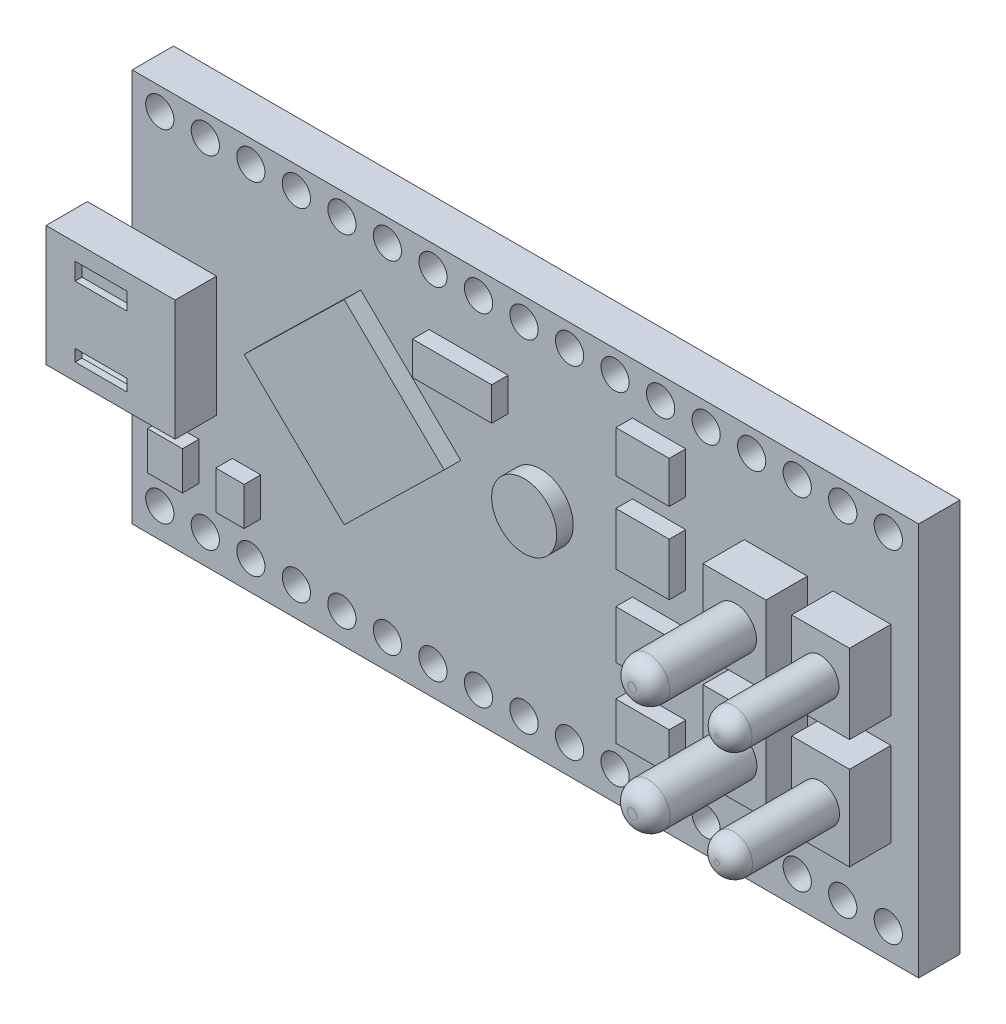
ISO-10303-21;
HEADER;
FILE_DESCRIPTION(('STEP AP214'),'2;1');
FILE_NAME('part.step','',(''),(''),'','','');
FILE_SCHEMA(('AUTOMOTIVE_DESIGN { 1 0 10303 214 1 1 1 1 }'));
ENDSEC;
DATA;
#1=APPLICATION_CONTEXT('core data for automotive mechanical design processes');
#2=APPLICATION_PROTOCOL_DEFINITION('international standard','automotive_design',2000,#1);
#3=PRODUCT_CONTEXT('',#1,'mechanical');
#4=PRODUCT('Part','Part','',(#3));
#5=PRODUCT_RELATED_PRODUCT_CATEGORY('part','',(#4));
#6=PRODUCT_DEFINITION_FORMATION('','',#4);
#7=PRODUCT_DEFINITION_CONTEXT('part definition',#1,'design');
#8=PRODUCT_DEFINITION('design','',#6,#7);
#9=PRODUCT_DEFINITION_SHAPE('','',#8);
#10=(LENGTH_UNIT() NAMED_UNIT(*) SI_UNIT(.MILLI.,.METRE.));
#11=(NAMED_UNIT(*) PLANE_ANGLE_UNIT() SI_UNIT($,.RADIAN.));
#12=(NAMED_UNIT(*) SI_UNIT($,.STERADIAN.) SOLID_ANGLE_UNIT());
#13=UNCERTAINTY_MEASURE_WITH_UNIT(LENGTH_MEASURE(1.E-05),#10,'distance_accuracy_value','');
#14=(GEOMETRIC_REPRESENTATION_CONTEXT(3) GLOBAL_UNCERTAINTY_ASSIGNED_CONTEXT((#13)) GLOBAL_UNIT_ASSIGNED_CONTEXT((#10,
#11,#12)) REPRESENTATION_CONTEXT('',''));
#15=CARTESIAN_POINT('',(0.,0.,0.));
#16=DIRECTION('',(0.,0.,1.));
#17=DIRECTION('',(1.,0.,0.));
#18=AXIS2_PLACEMENT_3D('',#15,#16,#17);
#19=CARTESIAN_POINT('',(0.,0.,0.4));
#20=DIRECTION('',(0.,0.,1.));
#21=DIRECTION('',(1.,0.,0.));
#22=AXIS2_PLACEMENT_3D('',#19,#20,#21);
#23=PLANE('',#22);
#24=DIRECTION('',(0.,-1.,0.));
#25=VECTOR('',#24,1.);
#26=CARTESIAN_POINT('',(-55.300148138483,-22.0798026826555,0.4));
#27=LINE('',#26,#25);
#28=CARTESIAN_POINT('',(-55.300148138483,-22.0798026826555,0.4));
#29=VERTEX_POINT('',#28);
#30=CARTESIAN_POINT('',(-55.300148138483,-22.488250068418,0.4));
#31=VERTEX_POINT('',#30);
#32=EDGE_CURVE('E498',#29,#31,#27,.T.);
#33=ORIENTED_EDGE('',*,*,#32,.T.);
#34=DIRECTION('',(1.,0.,0.));
#35=VECTOR('',#34,1.);
#36=CARTESIAN_POINT('',(-55.300148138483,-22.488250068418,0.4));
#37=LINE('',#36,#35);
#38=CARTESIAN_POINT('',(-54.9951051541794,-22.488250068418,0.4));
#39=VERTEX_POINT('',#38);
#40=EDGE_CURVE('E501',#31,#39,#37,.T.);
#41=ORIENTED_EDGE('',*,*,#40,.T.);
#42=DIRECTION('',(0.,1.,0.));
#43=VECTOR('',#42,1.);
#44=CARTESIAN_POINT('',(-54.9951051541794,-22.0798026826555,0.4));
#45=LINE('',#44,#43);
#46=CARTESIAN_POINT('',(-54.9951051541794,-22.0798026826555,0.4));
#47=VERTEX_POINT('',#46);
#48=EDGE_CURVE('E504',#39,#47,#45,.T.);
#49=ORIENTED_EDGE('',*,*,#48,.T.);
#50=DIRECTION('',(-1.,0.,0.));
#51=VECTOR('',#50,1.);
#52=CARTESIAN_POINT('',(-55.300148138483,-22.0798026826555,0.4));
#53=LINE('',#52,#51);
#54=EDGE_CURVE('E506',#47,#29,#53,.T.);
#55=ORIENTED_EDGE('',*,*,#54,.T.);
#56=EDGE_LOOP('',(#33,#41,#49,#55));
#57=FACE_BOUND('',#56,.T.);
#58=CARTESIAN_POINT('',(-55.142294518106,-22.2914543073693,0.4));
#59=DIRECTION('',(0.,0.,1.));
#60=DIRECTION('',(1.,0.,0.));
#61=AXIS2_PLACEMENT_3D('',#58,#59,#60);
#62=CIRCLE('',#61,0.103038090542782);
#63=CARTESIAN_POINT('',(-55.0392564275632,-22.2914543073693,0.4));
#64=VERTEX_POINT('',#63);
#65=EDGE_CURVE('E2522',#64,#64,#62,.T.);
#66=ORIENTED_EDGE('',*,*,#65,.F.);
#67=EDGE_LOOP('',(#66));
#68=FACE_BOUND('',#67,.T.);
#69=ADVANCED_FACE('F32',(#57,#68),#23,.T.);
#70=CARTESIAN_POINT('',(0.,0.,0.4));
#71=DIRECTION('',(0.,0.,1.));
#72=DIRECTION('',(1.,0.,0.));
#73=AXIS2_PLACEMENT_3D('',#70,#71,#72);
#74=PLANE('',#73);
#75=DIRECTION('',(0.,-1.,0.));
#76=VECTOR('',#75,1.);
#77=CARTESIAN_POINT('',(-54.8710198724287,-22.0798026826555,0.4));
#78=LINE('',#77,#76);
#79=CARTESIAN_POINT('',(-54.8710198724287,-22.0798026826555,0.4));
#80=VERTEX_POINT('',#79);
#81=CARTESIAN_POINT('',(-54.8710198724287,-22.488250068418,0.4));
#82=VERTEX_POINT('',#81);
#83=EDGE_CURVE('E475',#80,#82,#78,.T.);
#84=ORIENTED_EDGE('',*,*,#83,.T.);
#85=DIRECTION('',(1.,0.,0.));
#86=VECTOR('',#85,1.);
#87=CARTESIAN_POINT('',(-54.8710198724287,-22.488250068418,0.4));
#88=LINE('',#87,#86);
#89=CARTESIAN_POINT('',(-54.5918279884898,-22.488250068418,0.4));
#90=VERTEX_POINT('',#89);
#91=EDGE_CURVE('E464',#82,#90,#88,.T.);
#92=ORIENTED_EDGE('',*,*,#91,.T.);
#93=DIRECTION('',(0.,1.,0.));
#94=VECTOR('',#93,1.);
#95=CARTESIAN_POINT('',(-54.5918279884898,-22.0798026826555,0.4));
#96=LINE('',#95,#94);
#97=CARTESIAN_POINT('',(-54.5918279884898,-22.0798026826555,0.4));
#98=VERTEX_POINT('',#97);
#99=EDGE_CURVE('E474',#90,#98,#96,.T.);
#100=ORIENTED_EDGE('',*,*,#99,.T.);
#101=DIRECTION('',(-1.,0.,0.));
#102=VECTOR('',#101,1.);
#103=CARTESIAN_POINT('',(-54.8710198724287,-22.0798026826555,0.4));
#104=LINE('',#103,#102);
#105=EDGE_CURVE('E480',#98,#80,#104,.T.);
#106=ORIENTED_EDGE('',*,*,#105,.T.);
#107=EDGE_LOOP('',(#84,#92,#100,#106));
#108=FACE_BOUND('',#107,.T.);
#109=CARTESIAN_POINT('',(-54.7322067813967,-22.2914543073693,0.4));
#110=DIRECTION('',(0.,0.,1.));
#111=DIRECTION('',(1.,0.,0.));
#112=AXIS2_PLACEMENT_3D('',#109,#110,#111);
#113=CIRCLE('',#112,0.0918378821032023);
#114=CARTESIAN_POINT('',(-54.6403688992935,-22.2914543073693,0.4));
#115=VERTEX_POINT('',#114);
#116=EDGE_CURVE('E2523',#115,#115,#113,.T.);
#117=ORIENTED_EDGE('',*,*,#116,.F.);
#118=EDGE_LOOP('',(#117));
#119=FACE_BOUND('',#118,.T.);
#120=ADVANCED_FACE('F478',(#108,#119),#74,.T.);
#121=CARTESIAN_POINT('',(0.,0.,0.4));
#122=DIRECTION('',(0.,0.,1.));
#123=DIRECTION('',(1.,0.,0.));
#124=AXIS2_PLACEMENT_3D('',#121,#122,#123);
#125=PLANE('',#124);
#126=DIRECTION('',(0.,-1.,0.));
#127=VECTOR('',#126,1.);
#128=CARTESIAN_POINT('',(-54.8710198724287,-21.5731211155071,0.4));
#129=LINE('',#128,#127);
#130=CARTESIAN_POINT('',(-54.8710198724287,-21.5731211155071,0.4));
#131=VERTEX_POINT('',#130);
#132=CARTESIAN_POINT('',(-54.8710198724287,-21.9557174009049,0.4));
#133=VERTEX_POINT('',#132);
#134=EDGE_CURVE('E522',#131,#133,#129,.T.);
#135=ORIENTED_EDGE('',*,*,#134,.T.);
#136=DIRECTION('',(1.,0.,0.));
#137=VECTOR('',#136,1.);
#138=CARTESIAN_POINT('',(-54.8710198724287,-21.9557174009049,0.4));
#139=LINE('',#138,#137);
#140=CARTESIAN_POINT('',(-54.5918279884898,-21.9557174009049,0.4));
#141=VERTEX_POINT('',#140);
#142=EDGE_CURVE('E525',#133,#141,#139,.T.);
#143=ORIENTED_EDGE('',*,*,#142,.T.);
#144=DIRECTION('',(0.,1.,0.));
#145=VECTOR('',#144,1.);
#146=CARTESIAN_POINT('',(-54.5918279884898,-21.5731211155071,0.4));
#147=LINE('',#146,#145);
#148=CARTESIAN_POINT('',(-54.5918279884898,-21.5731211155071,0.4));
#149=VERTEX_POINT('',#148);
#150=EDGE_CURVE('E528',#141,#149,#147,.T.);
#151=ORIENTED_EDGE('',*,*,#150,.T.);
#152=DIRECTION('',(-1.,0.,0.));
#153=VECTOR('',#152,1.);
#154=CARTESIAN_POINT('',(-54.8710198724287,-21.5731211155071,0.4));
#155=LINE('',#154,#153);
#156=EDGE_CURVE('E530',#149,#131,#155,.T.);
#157=ORIENTED_EDGE('',*,*,#156,.T.);
#158=EDGE_LOOP('',(#135,#143,#151,#157));
#159=FACE_BOUND('',#158,.T.);
#160=CARTESIAN_POINT('',(-54.7322067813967,-21.7619739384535,0.4));
#161=DIRECTION('',(0.,0.,1.));
#162=DIRECTION('',(1.,0.,0.));
#163=AXIS2_PLACEMENT_3D('',#160,#161,#162);
#164=CIRCLE('',#163,0.0893090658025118);
#165=CARTESIAN_POINT('',(-54.6428977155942,-21.7619739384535,0.4));
#166=VERTEX_POINT('',#165);
#167=EDGE_CURVE('E2526',#166,#166,#164,.T.);
#168=ORIENTED_EDGE('',*,*,#167,.F.);
#169=EDGE_LOOP('',(#168));
#170=FACE_BOUND('',#169,.T.);
#171=ADVANCED_FACE('F1221',(#159,#170),#125,.T.);
#172=CARTESIAN_POINT('',(0.,0.,0.4));
#173=DIRECTION('',(0.,0.,1.));
#174=DIRECTION('',(1.,0.,0.));
#175=AXIS2_PLACEMENT_3D('',#172,#173,#174);
#176=PLANE('',#175);
#177=DIRECTION('',(0.,-1.,0.));
#178=VECTOR('',#177,1.);
#179=CARTESIAN_POINT('',(-55.300148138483,-21.5731211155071,0.4));
#180=LINE('',#179,#178);
#181=CARTESIAN_POINT('',(-55.300148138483,-21.5731211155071,0.4));
#182=VERTEX_POINT('',#181);
#183=CARTESIAN_POINT('',(-55.300148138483,-21.9557174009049,0.4));
#184=VERTEX_POINT('',#183);
#185=EDGE_CURVE('E551',#182,#184,#180,.T.);
#186=ORIENTED_EDGE('',*,*,#185,.T.);
#187=DIRECTION('',(1.,0.,0.));
#188=VECTOR('',#187,1.);
#189=CARTESIAN_POINT('',(-55.300148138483,-21.9557174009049,0.4));
#190=LINE('',#189,#188);
#191=CARTESIAN_POINT('',(-54.9951051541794,-21.9557174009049,0.4));
#192=VERTEX_POINT('',#191);
#193=EDGE_CURVE('E554',#184,#192,#190,.T.);
#194=ORIENTED_EDGE('',*,*,#193,.T.);
#195=DIRECTION('',(0.,1.,0.));
#196=VECTOR('',#195,1.);
#197=CARTESIAN_POINT('',(-54.9951051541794,-21.5731211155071,0.4));
#198=LINE('',#197,#196);
#199=CARTESIAN_POINT('',(-54.9951051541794,-21.5731211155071,0.4));
#200=VERTEX_POINT('',#199);
#201=EDGE_CURVE('E557',#192,#200,#198,.T.);
#202=ORIENTED_EDGE('',*,*,#201,.T.);
#203=DIRECTION('',(-1.,0.,0.));
#204=VECTOR('',#203,1.);
#205=CARTESIAN_POINT('',(-55.300148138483,-21.5731211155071,0.4));
#206=LINE('',#205,#204);
#207=EDGE_CURVE('E559',#200,#182,#206,.T.);
#208=ORIENTED_EDGE('',*,*,#207,.T.);
#209=EDGE_LOOP('',(#186,#194,#202,#208));
#210=FACE_BOUND('',#209,.T.);
#211=CARTESIAN_POINT('',(-55.142294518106,-21.7619739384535,0.4));
#212=DIRECTION('',(0.,0.,1.));
#213=DIRECTION('',(1.,0.,0.));
#214=AXIS2_PLACEMENT_3D('',#211,#212,#213);
#215=CIRCLE('',#214,0.100790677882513);
#216=CARTESIAN_POINT('',(-55.0415038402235,-21.7619739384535,0.4));
#217=VERTEX_POINT('',#216);
#218=EDGE_CURVE('E2531',#217,#217,#215,.T.);
#219=ORIENTED_EDGE('',*,*,#218,.F.);
#220=EDGE_LOOP('',(#219));
#221=FACE_BOUND('',#220,.T.);
#222=ADVANCED_FACE('F1245',(#210,#221),#176,.T.);
#223=CARTESIAN_POINT('',(0.,0.,0.2));
#224=DIRECTION('',(0.,0.,1.));
#225=DIRECTION('',(1.,0.,0.));
#226=AXIS2_PLACEMENT_3D('',#223,#224,#225);
#227=PLANE('',#226);
#228=DIRECTION('',(1.,0.,0.));
#229=VECTOR('',#228,1.);
#230=CARTESIAN_POINT('',(-55.300148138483,-22.488250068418,0.2));
#231=LINE('',#230,#229);
#232=CARTESIAN_POINT('',(-55.300148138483,-22.488250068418,0.2));
#233=VERTEX_POINT('',#232);
#234=CARTESIAN_POINT('',(-54.9951051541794,-22.488250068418,0.2));
#235=VERTEX_POINT('',#234);
#236=EDGE_CURVE('E493',#233,#235,#231,.T.);
#237=ORIENTED_EDGE('',*,*,#236,.F.);
#238=DIRECTION('',(0.,-1.,0.));
#239=VECTOR('',#238,1.);
#240=CARTESIAN_POINT('',(-55.300148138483,-22.0798026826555,0.2));
#241=LINE('',#240,#239);
#242=CARTESIAN_POINT('',(-55.300148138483,-22.0798026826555,0.2));
#243=VERTEX_POINT('',#242);
#244=EDGE_CURVE('E490',#243,#233,#241,.T.);
#245=ORIENTED_EDGE('',*,*,#244,.F.);
#246=DIRECTION('',(-1.,0.,0.));
#247=VECTOR('',#246,1.);
#248=CARTESIAN_POINT('',(-55.300148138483,-22.0798026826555,0.2));
#249=LINE('',#248,#247);
#250=CARTESIAN_POINT('',(-54.9951051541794,-22.0798026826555,0.2));
#251=VERTEX_POINT('',#250);
#252=EDGE_CURVE('E502',#251,#243,#249,.T.);
#253=ORIENTED_EDGE('',*,*,#252,.F.);
#254=DIRECTION('',(0.,1.,0.));
#255=VECTOR('',#254,1.);
#256=CARTESIAN_POINT('',(-54.9951051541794,-22.0798026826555,0.2));
#257=LINE('',#256,#255);
#258=EDGE_CURVE('E510',#235,#251,#257,.T.);
#259=ORIENTED_EDGE('',*,*,#258,.F.);
#260=EDGE_LOOP('',(#237,#245,#253,#259));
#261=FACE_BOUND('',#260,.T.);
#262=DIRECTION('',(1.,0.,0.));
#263=VECTOR('',#262,1.);
#264=CARTESIAN_POINT('',(-55.300148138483,-21.9557174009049,0.2));
#265=LINE('',#264,#263);
#266=CARTESIAN_POINT('',(-55.300148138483,-21.9557174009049,0.2));
#267=VERTEX_POINT('',#266);
#268=CARTESIAN_POINT('',(-54.9951051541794,-21.9557174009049,0.2));
#269=VERTEX_POINT('',#268);
#270=EDGE_CURVE('E564',#267,#269,#265,.T.);
#271=ORIENTED_EDGE('',*,*,#270,.F.);
#272=DIRECTION('',(0.,-1.,0.));
#273=VECTOR('',#272,1.);
#274=CARTESIAN_POINT('',(-55.300148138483,-21.5731211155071,0.2));
#275=LINE('',#274,#273);
#276=CARTESIAN_POINT('',(-55.300148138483,-21.5731211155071,0.2));
#277=VERTEX_POINT('',#276);
#278=EDGE_CURVE('E550',#277,#267,#275,.T.);
#279=ORIENTED_EDGE('',*,*,#278,.F.);
#280=DIRECTION('',(-1.,0.,0.));
#281=VECTOR('',#280,1.);
#282=CARTESIAN_POINT('',(-55.300148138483,-21.5731211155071,0.2));
#283=LINE('',#282,#281);
#284=CARTESIAN_POINT('',(-54.9951051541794,-21.5731211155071,0.2));
#285=VERTEX_POINT('',#284);
#286=EDGE_CURVE('E555',#285,#277,#283,.T.);
#287=ORIENTED_EDGE('',*,*,#286,.F.);
#288=DIRECTION('',(0.,1.,0.));
#289=VECTOR('',#288,1.);
#290=CARTESIAN_POINT('',(-54.9951051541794,-21.5731211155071,0.2));
#291=LINE('',#290,#289);
#292=EDGE_CURVE('E566',#269,#285,#291,.T.);
#293=ORIENTED_EDGE('',*,*,#292,.F.);
#294=EDGE_LOOP('',(#271,#279,#287,#293));
#295=FACE_BOUND('',#294,.T.);
#296=CARTESIAN_POINT('',(-58.1244393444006,-22.8442289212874,0.2));
#297=DIRECTION('',(0.,0.,1.));
#298=DIRECTION('',(1.,0.,0.));
#299=AXIS2_PLACEMENT_3D('',#296,#297,#298);
#300=CIRCLE('',#299,0.0681745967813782);
#301=CARTESIAN_POINT('',(-58.0562647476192,-22.8442289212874,0.2));
#302=VERTEX_POINT('',#301);
#303=EDGE_CURVE('E579',#302,#302,#300,.T.);
#304=ORIENTED_EDGE('',*,*,#303,.F.);
#305=EDGE_LOOP('',(#304));
#306=FACE_BOUND('',#305,.T.);
#307=CARTESIAN_POINT('',(-54.6044393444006,-22.8442289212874,0.2));
#308=DIRECTION('',(0.,0.,1.));
#309=DIRECTION('',(1.,0.,0.));
#310=AXIS2_PLACEMENT_3D('',#307,#308,#309);
#311=CIRCLE('',#310,0.0681745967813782);
#312=CARTESIAN_POINT('',(-54.5362647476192,-22.8442289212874,0.2));
#313=VERTEX_POINT('',#312);
#314=EDGE_CURVE('E583',#313,#313,#311,.T.);
#315=ORIENTED_EDGE('',*,*,#314,.F.);
#316=EDGE_LOOP('',(#315));
#317=FACE_BOUND('',#316,.T.);
#318=CARTESIAN_POINT('',(-54.8244393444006,-22.8442289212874,0.2));
#319=DIRECTION('',(0.,0.,1.));
#320=DIRECTION('',(1.,0.,0.));
#321=AXIS2_PLACEMENT_3D('',#318,#319,#320);
#322=CIRCLE('',#321,0.0681745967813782);
#323=CARTESIAN_POINT('',(-54.7562647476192,-22.8442289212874,0.2));
#324=VERTEX_POINT('',#323);
#325=EDGE_CURVE('E589',#324,#324,#322,.T.);
#326=ORIENTED_EDGE('',*,*,#325,.F.);
#327=EDGE_LOOP('',(#326));
#328=FACE_BOUND('',#327,.T.);
#329=CARTESIAN_POINT('',(-55.0444393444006,-22.8442289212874,0.2));
#330=DIRECTION('',(0.,0.,1.));
#331=DIRECTION('',(1.,0.,0.));
#332=AXIS2_PLACEMENT_3D('',#329,#330,#331);
#333=CIRCLE('',#332,0.0681745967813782);
#334=CARTESIAN_POINT('',(-54.9762647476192,-22.8442289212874,0.2));
#335=VERTEX_POINT('',#334);
#336=EDGE_CURVE('E595',#335,#335,#333,.T.);
#337=ORIENTED_EDGE('',*,*,#336,.F.);
#338=EDGE_LOOP('',(#337));
#339=FACE_BOUND('',#338,.T.);
#340=CARTESIAN_POINT('',(-55.2644393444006,-22.8442289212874,0.2));
#341=DIRECTION('',(0.,0.,1.));
#342=DIRECTION('',(1.,0.,0.));
#343=AXIS2_PLACEMENT_3D('',#340,#341,#342);
#344=CIRCLE('',#343,0.0681745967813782);
#345=CARTESIAN_POINT('',(-55.1962647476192,-22.8442289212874,0.2));
#346=VERTEX_POINT('',#345);
#347=EDGE_CURVE('E601',#346,#346,#344,.T.);
#348=ORIENTED_EDGE('',*,*,#347,.F.);
#349=EDGE_LOOP('',(#348));
#350=FACE_BOUND('',#349,.T.);
#351=CARTESIAN_POINT('',(-55.4844393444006,-22.8442289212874,0.2));
#352=DIRECTION('',(0.,0.,1.));
#353=DIRECTION('',(1.,0.,0.));
#354=AXIS2_PLACEMENT_3D('',#351,#352,#353);
#355=CIRCLE('',#354,0.0681745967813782);
#356=CARTESIAN_POINT('',(-55.4162647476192,-22.8442289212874,0.2));
#357=VERTEX_POINT('',#356);
#358=EDGE_CURVE('E607',#357,#357,#355,.T.);
#359=ORIENTED_EDGE('',*,*,#358,.F.);
#360=EDGE_LOOP('',(#359));
#361=FACE_BOUND('',#360,.T.);
#362=CARTESIAN_POINT('',(-55.7044393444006,-22.8442289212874,0.2));
#363=DIRECTION('',(0.,0.,1.));
#364=DIRECTION('',(1.,0.,0.));
#365=AXIS2_PLACEMENT_3D('',#362,#363,#364);
#366=CIRCLE('',#365,0.0681745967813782);
#367=CARTESIAN_POINT('',(-55.6362647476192,-22.8442289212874,0.2));
#368=VERTEX_POINT('',#367);
#369=EDGE_CURVE('E613',#368,#368,#366,.T.);
#370=ORIENTED_EDGE('',*,*,#369,.F.);
#371=EDGE_LOOP('',(#370));
#372=FACE_BOUND('',#371,.T.);
#373=CARTESIAN_POINT('',(-55.9244393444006,-22.8442289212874,0.2));
#374=DIRECTION('',(0.,0.,1.));
#375=DIRECTION('',(1.,0.,0.));
#376=AXIS2_PLACEMENT_3D('',#373,#374,#375);
#377=CIRCLE('',#376,0.0681745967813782);
#378=CARTESIAN_POINT('',(-55.8562647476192,-22.8442289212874,0.2));
#379=VERTEX_POINT('',#378);
#380=EDGE_CURVE('E619',#379,#379,#377,.T.);
#381=ORIENTED_EDGE('',*,*,#380,.F.);
#382=EDGE_LOOP('',(#381));
#383=FACE_BOUND('',#382,.T.);
#384=CARTESIAN_POINT('',(-56.1444393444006,-22.8442289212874,0.2));
#385=DIRECTION('',(0.,0.,1.));
#386=DIRECTION('',(1.,0.,0.));
#387=AXIS2_PLACEMENT_3D('',#384,#385,#386);
#388=CIRCLE('',#387,0.0681745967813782);
#389=CARTESIAN_POINT('',(-56.0762647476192,-22.8442289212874,0.2));
#390=VERTEX_POINT('',#389);
#391=EDGE_CURVE('E625',#390,#390,#388,.T.);
#392=ORIENTED_EDGE('',*,*,#391,.F.);
#393=EDGE_LOOP('',(#392));
#394=FACE_BOUND('',#393,.T.);
#395=CARTESIAN_POINT('',(-56.3644393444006,-22.8442289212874,0.2));
#396=DIRECTION('',(0.,0.,1.));
#397=DIRECTION('',(1.,0.,0.));
#398=AXIS2_PLACEMENT_3D('',#395,#396,#397);
#399=CIRCLE('',#398,0.0681745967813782);
#400=CARTESIAN_POINT('',(-56.2962647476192,-22.8442289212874,0.2));
#401=VERTEX_POINT('',#400);
#402=EDGE_CURVE('E631',#401,#401,#399,.T.);
#403=ORIENTED_EDGE('',*,*,#402,.F.);
#404=EDGE_LOOP('',(#403));
#405=FACE_BOUND('',#404,.T.);
#406=CARTESIAN_POINT('',(-56.5844393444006,-22.8442289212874,0.2));
#407=DIRECTION('',(0.,0.,1.));
#408=DIRECTION('',(1.,0.,0.));
#409=AXIS2_PLACEMENT_3D('',#406,#407,#408);
#410=CIRCLE('',#409,0.0681745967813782);
#411=CARTESIAN_POINT('',(-56.5162647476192,-22.8442289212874,0.2));
#412=VERTEX_POINT('',#411);
#413=EDGE_CURVE('E637',#412,#412,#410,.T.);
#414=ORIENTED_EDGE('',*,*,#413,.F.);
#415=EDGE_LOOP('',(#414));
#416=FACE_BOUND('',#415,.T.);
#417=CARTESIAN_POINT('',(-56.8044393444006,-22.8442289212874,0.2));
#418=DIRECTION('',(0.,0.,1.));
#419=DIRECTION('',(1.,0.,0.));
#420=AXIS2_PLACEMENT_3D('',#417,#418,#419);
#421=CIRCLE('',#420,0.0681745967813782);
#422=CARTESIAN_POINT('',(-56.7362647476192,-22.8442289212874,0.2));
#423=VERTEX_POINT('',#422);
#424=EDGE_CURVE('E643',#423,#423,#421,.T.);
#425=ORIENTED_EDGE('',*,*,#424,.F.);
#426=EDGE_LOOP('',(#425));
#427=FACE_BOUND('',#426,.T.);
#428=CARTESIAN_POINT('',(-57.0244393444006,-22.8442289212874,0.2));
#429=DIRECTION('',(0.,0.,1.));
#430=DIRECTION('',(1.,0.,0.));
#431=AXIS2_PLACEMENT_3D('',#428,#429,#430);
#432=CIRCLE('',#431,0.0681745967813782);
#433=CARTESIAN_POINT('',(-56.9562647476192,-22.8442289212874,0.2));
#434=VERTEX_POINT('',#433);
#435=EDGE_CURVE('E649',#434,#434,#432,.T.);
#436=ORIENTED_EDGE('',*,*,#435,.F.);
#437=EDGE_LOOP('',(#436));
#438=FACE_BOUND('',#437,.T.);
#439=CARTESIAN_POINT('',(-57.2444393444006,-22.8442289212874,0.2));
#440=DIRECTION('',(0.,0.,1.));
#441=DIRECTION('',(1.,0.,0.));
#442=AXIS2_PLACEMENT_3D('',#439,#440,#441);
#443=CIRCLE('',#442,0.0681745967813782);
#444=CARTESIAN_POINT('',(-57.1762647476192,-22.8442289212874,0.2));
#445=VERTEX_POINT('',#444);
#446=EDGE_CURVE('E655',#445,#445,#443,.T.);
#447=ORIENTED_EDGE('',*,*,#446,.F.);
#448=EDGE_LOOP('',(#447));
#449=FACE_BOUND('',#448,.T.);
#450=CARTESIAN_POINT('',(-57.4644393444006,-22.8442289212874,0.2));
#451=DIRECTION('',(0.,0.,1.));
#452=DIRECTION('',(1.,0.,0.));
#453=AXIS2_PLACEMENT_3D('',#450,#451,#452);
#454=CIRCLE('',#453,0.0681745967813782);
#455=CARTESIAN_POINT('',(-57.3962647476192,-22.8442289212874,0.2));
#456=VERTEX_POINT('',#455);
#457=EDGE_CURVE('E661',#456,#456,#454,.T.);
#458=ORIENTED_EDGE('',*,*,#457,.F.);
#459=EDGE_LOOP('',(#458));
#460=FACE_BOUND('',#459,.T.);
#461=CARTESIAN_POINT('',(-57.6844393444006,-22.8442289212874,0.2));
#462=DIRECTION('',(0.,0.,1.));
#463=DIRECTION('',(1.,0.,0.));
#464=AXIS2_PLACEMENT_3D('',#461,#462,#463);
#465=CIRCLE('',#464,0.0681745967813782);
#466=CARTESIAN_POINT('',(-57.6162647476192,-22.8442289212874,0.2));
#467=VERTEX_POINT('',#466);
#468=EDGE_CURVE('E667',#467,#467,#465,.T.);
#469=ORIENTED_EDGE('',*,*,#468,.F.);
#470=EDGE_LOOP('',(#469));
#471=FACE_BOUND('',#470,.T.);
#472=CARTESIAN_POINT('',(-57.9044393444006,-22.8442289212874,0.2));
#473=DIRECTION('',(0.,0.,1.));
#474=DIRECTION('',(1.,0.,0.));
#475=AXIS2_PLACEMENT_3D('',#472,#473,#474);
#476=CIRCLE('',#475,0.0681745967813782);
#477=CARTESIAN_POINT('',(-57.8362647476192,-22.8442289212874,0.2));
#478=VERTEX_POINT('',#477);
#479=EDGE_CURVE('E673',#478,#478,#476,.T.);
#480=ORIENTED_EDGE('',*,*,#479,.F.);
#481=EDGE_LOOP('',(#480));
#482=FACE_BOUND('',#481,.T.);
#483=CARTESIAN_POINT('',(-54.6044393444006,-21.1942289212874,0.2));
#484=DIRECTION('',(0.,0.,1.));
#485=DIRECTION('',(1.,0.,0.));
#486=AXIS2_PLACEMENT_3D('',#483,#484,#485);
#487=CIRCLE('',#486,0.0681745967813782);
#488=CARTESIAN_POINT('',(-54.5362647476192,-21.1942289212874,0.2));
#489=VERTEX_POINT('',#488);
#490=EDGE_CURVE('E679',#489,#489,#487,.T.);
#491=ORIENTED_EDGE('',*,*,#490,.F.);
#492=EDGE_LOOP('',(#491));
#493=FACE_BOUND('',#492,.T.);
#494=CARTESIAN_POINT('',(-54.8244393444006,-21.1942289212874,0.2));
#495=DIRECTION('',(0.,0.,1.));
#496=DIRECTION('',(1.,0.,0.));
#497=AXIS2_PLACEMENT_3D('',#494,#495,#496);
#498=CIRCLE('',#497,0.0681745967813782);
#499=CARTESIAN_POINT('',(-54.7562647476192,-21.1942289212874,0.2));
#500=VERTEX_POINT('',#499);
#501=EDGE_CURVE('E685',#500,#500,#498,.T.);
#502=ORIENTED_EDGE('',*,*,#501,.F.);
#503=EDGE_LOOP('',(#502));
#504=FACE_BOUND('',#503,.T.);
#505=CARTESIAN_POINT('',(-55.0444393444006,-21.1942289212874,0.2));
#506=DIRECTION('',(0.,0.,1.));
#507=DIRECTION('',(1.,0.,0.));
#508=AXIS2_PLACEMENT_3D('',#505,#506,#507);
#509=CIRCLE('',#508,0.0681745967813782);
#510=CARTESIAN_POINT('',(-54.9762647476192,-21.1942289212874,0.2));
#511=VERTEX_POINT('',#510);
#512=EDGE_CURVE('E691',#511,#511,#509,.T.);
#513=ORIENTED_EDGE('',*,*,#512,.F.);
#514=EDGE_LOOP('',(#513));
#515=FACE_BOUND('',#514,.T.);
#516=CARTESIAN_POINT('',(-55.2644393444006,-21.1942289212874,0.2));
#517=DIRECTION('',(0.,0.,1.));
#518=DIRECTION('',(1.,0.,0.));
#519=AXIS2_PLACEMENT_3D('',#516,#517,#518);
#520=CIRCLE('',#519,0.0681745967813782);
#521=CARTESIAN_POINT('',(-55.1962647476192,-21.1942289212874,0.2));
#522=VERTEX_POINT('',#521);
#523=EDGE_CURVE('E697',#522,#522,#520,.T.);
#524=ORIENTED_EDGE('',*,*,#523,.F.);
#525=EDGE_LOOP('',(#524));
#526=FACE_BOUND('',#525,.T.);
#527=CARTESIAN_POINT('',(-55.4844393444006,-21.1942289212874,0.2));
#528=DIRECTION('',(0.,0.,1.));
#529=DIRECTION('',(1.,0.,0.));
#530=AXIS2_PLACEMENT_3D('',#527,#528,#529);
#531=CIRCLE('',#530,0.0681745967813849);
#532=CARTESIAN_POINT('',(-55.4162647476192,-21.1942289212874,0.2));
#533=VERTEX_POINT('',#532);
#534=EDGE_CURVE('E703',#533,#533,#531,.T.);
#535=ORIENTED_EDGE('',*,*,#534,.F.);
#536=EDGE_LOOP('',(#535));
#537=FACE_BOUND('',#536,.T.);
#538=CARTESIAN_POINT('',(-55.7044393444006,-21.1942289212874,0.2));
#539=DIRECTION('',(0.,0.,1.));
#540=DIRECTION('',(1.,0.,0.));
#541=AXIS2_PLACEMENT_3D('',#538,#539,#540);
#542=CIRCLE('',#541,0.0681745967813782);
#543=CARTESIAN_POINT('',(-55.6362647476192,-21.1942289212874,0.2));
#544=VERTEX_POINT('',#543);
#545=EDGE_CURVE('E709',#544,#544,#542,.T.);
#546=ORIENTED_EDGE('',*,*,#545,.F.);
#547=EDGE_LOOP('',(#546));
#548=FACE_BOUND('',#547,.T.);
#549=CARTESIAN_POINT('',(-55.9244393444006,-21.1942289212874,0.2));
#550=DIRECTION('',(0.,0.,1.));
#551=DIRECTION('',(1.,0.,0.));
#552=AXIS2_PLACEMENT_3D('',#549,#550,#551);
#553=CIRCLE('',#552,0.0681745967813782);
#554=CARTESIAN_POINT('',(-55.8562647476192,-21.1942289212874,0.2));
#555=VERTEX_POINT('',#554);
#556=EDGE_CURVE('E715',#555,#555,#553,.T.);
#557=ORIENTED_EDGE('',*,*,#556,.F.);
#558=EDGE_LOOP('',(#557));
#559=FACE_BOUND('',#558,.T.);
#560=CARTESIAN_POINT('',(-56.1444393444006,-21.1942289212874,0.2));
#561=DIRECTION('',(0.,0.,1.));
#562=DIRECTION('',(1.,0.,0.));
#563=AXIS2_PLACEMENT_3D('',#560,#561,#562);
#564=CIRCLE('',#563,0.0681745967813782);
#565=CARTESIAN_POINT('',(-56.0762647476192,-21.1942289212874,0.2));
#566=VERTEX_POINT('',#565);
#567=EDGE_CURVE('E721',#566,#566,#564,.T.);
#568=ORIENTED_EDGE('',*,*,#567,.F.);
#569=EDGE_LOOP('',(#568));
#570=FACE_BOUND('',#569,.T.);
#571=CARTESIAN_POINT('',(-56.3644393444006,-21.1942289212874,0.2));
#572=DIRECTION('',(0.,0.,1.));
#573=DIRECTION('',(1.,0.,0.));
#574=AXIS2_PLACEMENT_3D('',#571,#572,#573);
#575=CIRCLE('',#574,0.0681745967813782);
#576=CARTESIAN_POINT('',(-56.2962647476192,-21.1942289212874,0.2));
#577=VERTEX_POINT('',#576);
#578=EDGE_CURVE('E727',#577,#577,#575,.T.);
#579=ORIENTED_EDGE('',*,*,#578,.F.);
#580=EDGE_LOOP('',(#579));
#581=FACE_BOUND('',#580,.T.);
#582=CARTESIAN_POINT('',(-56.5844393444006,-21.1942289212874,0.2));
#583=DIRECTION('',(0.,0.,1.));
#584=DIRECTION('',(1.,0.,0.));
#585=AXIS2_PLACEMENT_3D('',#582,#583,#584);
#586=CIRCLE('',#585,0.0681745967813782);
#587=CARTESIAN_POINT('',(-56.5162647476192,-21.1942289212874,0.2));
#588=VERTEX_POINT('',#587);
#589=EDGE_CURVE('E733',#588,#588,#586,.T.);
#590=ORIENTED_EDGE('',*,*,#589,.F.);
#591=EDGE_LOOP('',(#590));
#592=FACE_BOUND('',#591,.T.);
#593=CARTESIAN_POINT('',(-56.8044393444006,-21.1942289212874,0.2));
#594=DIRECTION('',(0.,0.,1.));
#595=DIRECTION('',(1.,0.,0.));
#596=AXIS2_PLACEMENT_3D('',#593,#594,#595);
#597=CIRCLE('',#596,0.0681745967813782);
#598=CARTESIAN_POINT('',(-56.7362647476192,-21.1942289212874,0.2));
#599=VERTEX_POINT('',#598);
#600=EDGE_CURVE('E739',#599,#599,#597,.T.);
#601=ORIENTED_EDGE('',*,*,#600,.F.);
#602=EDGE_LOOP('',(#601));
#603=FACE_BOUND('',#602,.T.);
#604=CARTESIAN_POINT('',(-57.0244393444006,-21.1942289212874,0.2));
#605=DIRECTION('',(0.,0.,1.));
#606=DIRECTION('',(1.,0.,0.));
#607=AXIS2_PLACEMENT_3D('',#604,#605,#606);
#608=CIRCLE('',#607,0.0681745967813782);
#609=CARTESIAN_POINT('',(-56.9562647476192,-21.1942289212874,0.2));
#610=VERTEX_POINT('',#609);
#611=EDGE_CURVE('E745',#610,#610,#608,.T.);
#612=ORIENTED_EDGE('',*,*,#611,.F.);
#613=EDGE_LOOP('',(#612));
#614=FACE_BOUND('',#613,.T.);
#615=CARTESIAN_POINT('',(-57.2444393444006,-21.1942289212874,0.2));
#616=DIRECTION('',(0.,0.,1.));
#617=DIRECTION('',(1.,0.,0.));
#618=AXIS2_PLACEMENT_3D('',#615,#616,#617);
#619=CIRCLE('',#618,0.0681745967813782);
#620=CARTESIAN_POINT('',(-57.1762647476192,-21.1942289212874,0.2));
#621=VERTEX_POINT('',#620);
#622=EDGE_CURVE('E751',#621,#621,#619,.T.);
#623=ORIENTED_EDGE('',*,*,#622,.F.);
#624=EDGE_LOOP('',(#623));
#625=FACE_BOUND('',#624,.T.);
#626=CARTESIAN_POINT('',(-57.4644393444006,-21.1942289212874,0.2));
#627=DIRECTION('',(0.,0.,1.));
#628=DIRECTION('',(1.,0.,0.));
#629=AXIS2_PLACEMENT_3D('',#626,#627,#628);
#630=CIRCLE('',#629,0.0681745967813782);
#631=CARTESIAN_POINT('',(-57.3962647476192,-21.1942289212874,0.2));
#632=VERTEX_POINT('',#631);
#633=EDGE_CURVE('E757',#632,#632,#630,.T.);
#634=ORIENTED_EDGE('',*,*,#633,.F.);
#635=EDGE_LOOP('',(#634));
#636=FACE_BOUND('',#635,.T.);
#637=CARTESIAN_POINT('',(-57.6844393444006,-21.1942289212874,0.2));
#638=DIRECTION('',(0.,0.,1.));
#639=DIRECTION('',(1.,0.,0.));
#640=AXIS2_PLACEMENT_3D('',#637,#638,#639);
#641=CIRCLE('',#640,0.0681745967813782);
#642=CARTESIAN_POINT('',(-57.6162647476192,-21.1942289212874,0.2));
#643=VERTEX_POINT('',#642);
#644=EDGE_CURVE('E763',#643,#643,#641,.T.);
#645=ORIENTED_EDGE('',*,*,#644,.F.);
#646=EDGE_LOOP('',(#645));
#647=FACE_BOUND('',#646,.T.);
#648=CARTESIAN_POINT('',(-57.9044393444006,-21.1942289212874,0.2));
#649=DIRECTION('',(0.,0.,1.));
#650=DIRECTION('',(1.,0.,0.));
#651=AXIS2_PLACEMENT_3D('',#648,#649,#650);
#652=CIRCLE('',#651,0.0681745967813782);
#653=CARTESIAN_POINT('',(-57.8362647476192,-21.1942289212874,0.2));
#654=VERTEX_POINT('',#653);
#655=EDGE_CURVE('E769',#654,#654,#652,.T.);
#656=ORIENTED_EDGE('',*,*,#655,.F.);
#657=EDGE_LOOP('',(#656));
#658=FACE_BOUND('',#657,.T.);
#659=CARTESIAN_POINT('',(-58.1244393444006,-21.1942289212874,0.2));
#660=DIRECTION('',(0.,0.,1.));
#661=DIRECTION('',(1.,0.,0.));
#662=AXIS2_PLACEMENT_3D('',#659,#660,#661);
#663=CIRCLE('',#662,0.0681745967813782);
#664=CARTESIAN_POINT('',(-58.0562647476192,-21.1942289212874,0.2));
#665=VERTEX_POINT('',#664);
#666=EDGE_CURVE('E775',#665,#665,#663,.T.);
#667=ORIENTED_EDGE('',*,*,#666,.F.);
#668=EDGE_LOOP('',(#667));
#669=FACE_BOUND('',#668,.T.);
#670=DIRECTION('',(1.,0.,0.));
#671=VECTOR('',#670,1.);
#672=CARTESIAN_POINT('',(-55.8407499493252,-22.3168705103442,0.2));
#673=LINE('',#672,#671);
#674=CARTESIAN_POINT('',(-55.8407499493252,-22.3168705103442,0.2));
#675=VERTEX_POINT('',#674);
#676=CARTESIAN_POINT('',(-55.5830199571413,-22.3168705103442,0.2));
#677=VERTEX_POINT('',#676);
#678=EDGE_CURVE('E826',#675,#677,#673,.T.);
#679=ORIENTED_EDGE('',*,*,#678,.F.);
#680=DIRECTION('',(0.,-1.,0.));
#681=VECTOR('',#680,1.);
#682=CARTESIAN_POINT('',(-55.8407499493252,-22.0833027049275,0.2));
#683=LINE('',#682,#681);
#684=CARTESIAN_POINT('',(-55.8407499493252,-22.0833027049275,0.2));
#685=VERTEX_POINT('',#684);
#686=EDGE_CURVE('E812',#685,#675,#683,.T.);
#687=ORIENTED_EDGE('',*,*,#686,.F.);
#688=DIRECTION('',(-1.,0.,0.));
#689=VECTOR('',#688,1.);
#690=CARTESIAN_POINT('',(-55.8407499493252,-22.0833027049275,0.2));
#691=LINE('',#690,#689);
#692=CARTESIAN_POINT('',(-55.5830199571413,-22.0833027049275,0.2));
#693=VERTEX_POINT('',#692);
#694=EDGE_CURVE('E817',#693,#685,#691,.T.);
#695=ORIENTED_EDGE('',*,*,#694,.F.);
#696=DIRECTION('',(0.,1.,0.));
#697=VECTOR('',#696,1.);
#698=CARTESIAN_POINT('',(-55.5830199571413,-22.0833027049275,0.2));
#699=LINE('',#698,#697);
#700=EDGE_CURVE('E828',#677,#693,#699,.T.);
#701=ORIENTED_EDGE('',*,*,#700,.F.);
#702=EDGE_LOOP('',(#679,#687,#695,#701));
#703=FACE_BOUND('',#702,.T.);
#704=DIRECTION('',(1.,0.,0.));
#705=VECTOR('',#704,1.);
#706=CARTESIAN_POINT('',(-55.8407499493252,-21.5356264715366,0.2));
#707=LINE('',#706,#705);
#708=CARTESIAN_POINT('',(-55.8407499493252,-21.5356264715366,0.2));
#709=VERTEX_POINT('',#708);
#710=CARTESIAN_POINT('',(-55.5830199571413,-21.5356264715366,0.2));
#711=VERTEX_POINT('',#710);
#712=EDGE_CURVE('E884',#709,#711,#707,.T.);
#713=ORIENTED_EDGE('',*,*,#712,.F.);
#714=DIRECTION('',(0.,-1.,0.));
#715=VECTOR('',#714,1.);
#716=CARTESIAN_POINT('',(-55.8407499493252,-21.3342749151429,0.2));
#717=LINE('',#716,#715);
#718=CARTESIAN_POINT('',(-55.8407499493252,-21.3342749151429,0.2));
#719=VERTEX_POINT('',#718);
#720=EDGE_CURVE('E870',#719,#709,#717,.T.);
#721=ORIENTED_EDGE('',*,*,#720,.F.);
#722=DIRECTION('',(-1.,0.,0.));
#723=VECTOR('',#722,1.);
#724=CARTESIAN_POINT('',(-55.8407499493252,-21.3342749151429,0.2));
#725=LINE('',#724,#723);
#726=CARTESIAN_POINT('',(-55.5830199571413,-21.3342749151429,0.2));
#727=VERTEX_POINT('',#726);
#728=EDGE_CURVE('E875',#727,#719,#725,.T.);
#729=ORIENTED_EDGE('',*,*,#728,.F.);
#730=DIRECTION('',(0.,1.,0.));
#731=VECTOR('',#730,1.);
#732=CARTESIAN_POINT('',(-55.5830199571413,-21.3342749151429,0.2));
#733=LINE('',#732,#731);
#734=EDGE_CURVE('E886',#711,#727,#733,.T.);
#735=ORIENTED_EDGE('',*,*,#734,.F.);
#736=EDGE_LOOP('',(#713,#721,#729,#735));
#737=FACE_BOUND('',#736,.T.);
#738=DIRECTION('',(1.,0.,0.));
#739=VECTOR('',#738,1.);
#740=CARTESIAN_POINT('',(-58.1039414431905,-22.6551411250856,0.2));
#741=LINE('',#740,#739);
#742=CARTESIAN_POINT('',(-58.1039414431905,-22.6551411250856,0.2));
#743=VERTEX_POINT('',#742);
#744=CARTESIAN_POINT('',(-57.9348061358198,-22.6551411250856,0.2));
#745=VERTEX_POINT('',#744);
#746=EDGE_CURVE('E942',#743,#745,#741,.T.);
#747=ORIENTED_EDGE('',*,*,#746,.F.);
#748=DIRECTION('',(0.,-1.,0.));
#749=VECTOR('',#748,1.);
#750=CARTESIAN_POINT('',(-58.1039414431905,-22.4698976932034,0.2));
#751=LINE('',#750,#749);
#752=CARTESIAN_POINT('',(-58.1039414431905,-22.4698976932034,0.2));
#753=VERTEX_POINT('',#752);
#754=EDGE_CURVE('E928',#753,#743,#751,.T.);
#755=ORIENTED_EDGE('',*,*,#754,.F.);
#756=DIRECTION('',(-1.,0.,0.));
#757=VECTOR('',#756,1.);
#758=CARTESIAN_POINT('',(-58.1039414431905,-22.4698976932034,0.2));
#759=LINE('',#758,#757);
#760=CARTESIAN_POINT('',(-57.9348061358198,-22.4698976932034,0.2));
#761=VERTEX_POINT('',#760);
#762=EDGE_CURVE('E933',#761,#753,#759,.T.);
#763=ORIENTED_EDGE('',*,*,#762,.F.);
#764=DIRECTION('',(0.,1.,0.));
#765=VECTOR('',#764,1.);
#766=CARTESIAN_POINT('',(-57.9348061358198,-22.4698976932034,0.2));
#767=LINE('',#766,#765);
#768=EDGE_CURVE('E944',#745,#761,#767,.T.);
#769=ORIENTED_EDGE('',*,*,#768,.F.);
#770=EDGE_LOOP('',(#747,#755,#763,#769));
#771=FACE_BOUND('',#770,.T.);
#772=DIRECTION('',(1.,0.,0.));
#773=VECTOR('',#772,1.);
#774=CARTESIAN_POINT('',(-56.8233455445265,-21.6161670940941,0.2));
#775=LINE('',#774,#773);
#776=CARTESIAN_POINT('',(-56.8233455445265,-21.6161670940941,0.2));
#777=VERTEX_POINT('',#776);
#778=CARTESIAN_POINT('',(-56.4407775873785,-21.6161670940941,0.2));
#779=VERTEX_POINT('',#778);
#780=EDGE_CURVE('E1000',#777,#779,#775,.T.);
#781=ORIENTED_EDGE('',*,*,#780,.F.);
#782=DIRECTION('',(0.,-1.,0.));
#783=VECTOR('',#782,1.);
#784=CARTESIAN_POINT('',(-56.8233455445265,-21.4550858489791,0.2));
#785=LINE('',#784,#783);
#786=CARTESIAN_POINT('',(-56.8233455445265,-21.4550858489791,0.2));
#787=VERTEX_POINT('',#786);
#788=EDGE_CURVE('E986',#787,#777,#785,.T.);
#789=ORIENTED_EDGE('',*,*,#788,.F.);
#790=DIRECTION('',(-1.,0.,0.));
#791=VECTOR('',#790,1.);
#792=CARTESIAN_POINT('',(-56.8233455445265,-21.4550858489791,0.2));
#793=LINE('',#792,#791);
#794=CARTESIAN_POINT('',(-56.4407775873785,-21.4550858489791,0.2));
#795=VERTEX_POINT('',#794);
#796=EDGE_CURVE('E991',#795,#787,#793,.T.);
#797=ORIENTED_EDGE('',*,*,#796,.F.);
#798=DIRECTION('',(0.,1.,0.));
#799=VECTOR('',#798,1.);
#800=CARTESIAN_POINT('',(-56.4407775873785,-21.4550858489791,0.2));
#801=LINE('',#800,#799);
#802=EDGE_CURVE('E1002',#779,#795,#801,.T.);
#803=ORIENTED_EDGE('',*,*,#802,.F.);
#804=EDGE_LOOP('',(#781,#789,#797,#803));
#805=FACE_BOUND('',#804,.T.);
#806=DIRECTION('',(-1.,0.,0.));
#807=VECTOR('',#806,1.);
#808=CARTESIAN_POINT('',(-58.4741636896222,-21.7453074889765,0.2));
#809=LINE('',#808,#807);
#810=CARTESIAN_POINT('',(-57.8502711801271,-21.7453074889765,0.2));
#811=VERTEX_POINT('',#810);
#812=CARTESIAN_POINT('',(-58.2578723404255,-21.7453074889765,0.2));
#813=VERTEX_POINT('',#812);
#814=EDGE_CURVE('E1119',#811,#813,#809,.T.);
#815=ORIENTED_EDGE('',*,*,#814,.F.);
#816=DIRECTION('',(0.,1.,0.));
#817=VECTOR('',#816,1.);
#818=CARTESIAN_POINT('',(-57.8502711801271,-21.7453074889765,0.2));
#819=LINE('',#818,#817);
#820=CARTESIAN_POINT('',(-57.8502711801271,-22.3276071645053,0.2));
#821=VERTEX_POINT('',#820);
#822=EDGE_CURVE('E1131',#821,#811,#819,.T.);
#823=ORIENTED_EDGE('',*,*,#822,.F.);
#824=DIRECTION('',(1.,0.,0.));
#825=VECTOR('',#824,1.);
#826=CARTESIAN_POINT('',(-58.4741636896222,-22.3276071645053,0.2));
#827=LINE('',#826,#825);
#828=CARTESIAN_POINT('',(-58.2578723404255,-22.3276071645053,0.2));
#829=VERTEX_POINT('',#828);
#830=EDGE_CURVE('E1132',#829,#821,#827,.T.);
#831=ORIENTED_EDGE('',*,*,#830,.F.);
#832=DIRECTION('',(0.,-1.,0.));
#833=VECTOR('',#832,1.);
#834=CARTESIAN_POINT('',(-58.2578723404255,-21.0860992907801,0.2));
#835=LINE('',#834,#833);
#836=CARTESIAN_POINT('',(-58.2578723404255,-22.9860992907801,0.2));
#837=VERTEX_POINT('',#836);
#838=EDGE_CURVE('E1155',#829,#837,#835,.T.);
#839=ORIENTED_EDGE('',*,*,#838,.T.);
#840=DIRECTION('',(1.,0.,0.));
#841=VECTOR('',#840,1.);
#842=CARTESIAN_POINT('',(-58.2578723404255,-22.9860992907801,0.2));
#843=LINE('',#842,#841);
#844=CARTESIAN_POINT('',(-54.4578723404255,-22.9860992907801,0.2));
#845=VERTEX_POINT('',#844);
#846=EDGE_CURVE('E1153',#837,#845,#843,.T.);
#847=ORIENTED_EDGE('',*,*,#846,.T.);
#848=DIRECTION('',(0.,1.,0.));
#849=VECTOR('',#848,1.);
#850=CARTESIAN_POINT('',(-54.4578723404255,-21.0860992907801,0.2));
#851=LINE('',#850,#849);
#852=CARTESIAN_POINT('',(-54.4578723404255,-21.0860992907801,0.2));
#853=VERTEX_POINT('',#852);
#854=EDGE_CURVE('E1157',#845,#853,#851,.T.);
#855=ORIENTED_EDGE('',*,*,#854,.T.);
#856=DIRECTION('',(-1.,0.,0.));
#857=VECTOR('',#856,1.);
#858=CARTESIAN_POINT('',(-58.2578723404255,-21.0860992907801,0.2));
#859=LINE('',#858,#857);
#860=CARTESIAN_POINT('',(-58.2578723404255,-21.0860992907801,0.2));
#861=VERTEX_POINT('',#860);
#862=EDGE_CURVE('E1159',#853,#861,#859,.T.);
#863=ORIENTED_EDGE('',*,*,#862,.T.);
#864=EDGE_CURVE('E1150',#861,#813,#835,.T.);
#865=ORIENTED_EDGE('',*,*,#864,.T.);
#866=EDGE_LOOP('',(#815,#823,#831,#839,#847,#855,#863,#865));
#867=FACE_BOUND('',#866,.T.);
#868=CARTESIAN_POINT('',(-56.2837233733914,-21.9262484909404,0.2));
#869=DIRECTION('',(0.,0.,1.));
#870=DIRECTION('',(1.,0.,0.));
#871=AXIS2_PLACEMENT_3D('',#868,#869,#870);
#872=CIRCLE('',#871,0.157054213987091);
#873=CARTESIAN_POINT('',(-56.1266691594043,-21.9262484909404,0.2));
#874=VERTEX_POINT('',#873);
#875=EDGE_CURVE('E1015',#874,#874,#872,.T.);
#876=ORIENTED_EDGE('',*,*,#875,.F.);
#877=EDGE_LOOP('',(#876));
#878=FACE_BOUND('',#877,.T.);
#879=DIRECTION('',(-0.716000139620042,-0.698100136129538,0.));
#880=VECTOR('',#879,1.);
#881=CARTESIAN_POINT('',(-57.1535620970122,-21.4550858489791,0.2));
#882=LINE('',#881,#880);
#883=CARTESIAN_POINT('',(-57.1535620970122,-21.4550858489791,0.2));
#884=VERTEX_POINT('',#883);
#885=CARTESIAN_POINT('',(-57.6368058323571,-21.9262484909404,0.2));
#886=VERTEX_POINT('',#885);
#887=EDGE_CURVE('E971',#884,#886,#882,.T.);
#888=ORIENTED_EDGE('',*,*,#887,.F.);
#889=DIRECTION('',(-0.716000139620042,0.698100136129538,0.));
#890=VECTOR('',#889,1.);
#891=CARTESIAN_POINT('',(-56.6703183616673,-21.9262484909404,0.2));
#892=LINE('',#891,#890);
#893=CARTESIAN_POINT('',(-56.6703183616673,-21.9262484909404,0.2));
#894=VERTEX_POINT('',#893);
#895=EDGE_CURVE('E957',#894,#884,#892,.T.);
#896=ORIENTED_EDGE('',*,*,#895,.F.);
#897=DIRECTION('',(0.716000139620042,0.698100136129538,0.));
#898=VECTOR('',#897,1.);
#899=CARTESIAN_POINT('',(-57.1535620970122,-22.3974111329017,0.2));
#900=LINE('',#899,#898);
#901=CARTESIAN_POINT('',(-57.1535620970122,-22.3974111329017,0.2));
#902=VERTEX_POINT('',#901);
#903=EDGE_CURVE('E962',#902,#894,#900,.T.);
#904=ORIENTED_EDGE('',*,*,#903,.F.);
#905=DIRECTION('',(0.716000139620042,-0.698100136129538,0.));
#906=VECTOR('',#905,1.);
#907=CARTESIAN_POINT('',(-57.6368058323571,-21.9262484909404,0.2));
#908=LINE('',#907,#906);
#909=EDGE_CURVE('E973',#886,#902,#908,.T.);
#910=ORIENTED_EDGE('',*,*,#909,.F.);
#911=EDGE_LOOP('',(#888,#896,#904,#910));
#912=FACE_BOUND('',#911,.T.);
#913=DIRECTION('',(1.,0.,0.));
#914=VECTOR('',#913,1.);
#915=CARTESIAN_POINT('',(-57.7737248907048,-22.6551411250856,0.2));
#916=LINE('',#915,#914);
#917=CARTESIAN_POINT('',(-57.7737248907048,-22.6551411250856,0.2));
#918=VERTEX_POINT('',#917);
#919=CARTESIAN_POINT('',(-57.6368058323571,-22.6551411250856,0.2));
#920=VERTEX_POINT('',#919);
#921=EDGE_CURVE('E913',#918,#920,#916,.T.);
#922=ORIENTED_EDGE('',*,*,#921,.F.);
#923=DIRECTION('',(0.,-1.,0.));
#924=VECTOR('',#923,1.);
#925=CARTESIAN_POINT('',(-57.7737248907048,-22.4698976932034,0.2));
#926=LINE('',#925,#924);
#927=CARTESIAN_POINT('',(-57.7737248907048,-22.4698976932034,0.2));
#928=VERTEX_POINT('',#927);
#929=EDGE_CURVE('E899',#928,#918,#926,.T.);
#930=ORIENTED_EDGE('',*,*,#929,.F.);
#931=DIRECTION('',(-1.,0.,0.));
#932=VECTOR('',#931,1.);
#933=CARTESIAN_POINT('',(-57.7737248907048,-22.4698976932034,0.2));
#934=LINE('',#933,#932);
#935=CARTESIAN_POINT('',(-57.6368058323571,-22.4698976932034,0.2));
#936=VERTEX_POINT('',#935);
#937=EDGE_CURVE('E904',#936,#928,#934,.T.);
#938=ORIENTED_EDGE('',*,*,#937,.F.);
#939=DIRECTION('',(0.,1.,0.));
#940=VECTOR('',#939,1.);
#941=CARTESIAN_POINT('',(-57.6368058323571,-22.4698976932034,0.2));
#942=LINE('',#941,#940);
#943=EDGE_CURVE('E915',#920,#936,#942,.T.);
#944=ORIENTED_EDGE('',*,*,#943,.F.);
#945=EDGE_LOOP('',(#922,#930,#938,#944));
#946=FACE_BOUND('',#945,.T.);
#947=DIRECTION('',(1.,0.,0.));
#948=VECTOR('',#947,1.);
#949=CARTESIAN_POINT('',(-55.8407499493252,-21.9262484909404,0.2));
#950=LINE('',#949,#948);
#951=CARTESIAN_POINT('',(-55.8407499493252,-21.9262484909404,0.2));
#952=VERTEX_POINT('',#951);
#953=CARTESIAN_POINT('',(-55.5830199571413,-21.9262484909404,0.2));
#954=VERTEX_POINT('',#953);
#955=EDGE_CURVE('E855',#952,#954,#950,.T.);
#956=ORIENTED_EDGE('',*,*,#955,.F.);
#957=DIRECTION('',(0.,-1.,0.));
#958=VECTOR('',#957,1.);
#959=CARTESIAN_POINT('',(-55.8407499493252,-21.6725455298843,0.2));
#960=LINE('',#959,#958);
#961=CARTESIAN_POINT('',(-55.8407499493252,-21.6725455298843,0.2));
#962=VERTEX_POINT('',#961);
#963=EDGE_CURVE('E841',#962,#952,#960,.T.);
#964=ORIENTED_EDGE('',*,*,#963,.F.);
#965=DIRECTION('',(-1.,0.,0.));
#966=VECTOR('',#965,1.);
#967=CARTESIAN_POINT('',(-55.8407499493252,-21.6725455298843,0.2));
#968=LINE('',#967,#966);
#969=CARTESIAN_POINT('',(-55.5830199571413,-21.6725455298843,0.2));
#970=VERTEX_POINT('',#969);
#971=EDGE_CURVE('E846',#970,#962,#968,.T.);
#972=ORIENTED_EDGE('',*,*,#971,.F.);
#973=DIRECTION('',(0.,1.,0.));
#974=VECTOR('',#973,1.);
#975=CARTESIAN_POINT('',(-55.5830199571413,-21.6725455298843,0.2));
#976=LINE('',#975,#974);
#977=EDGE_CURVE('E857',#954,#970,#976,.T.);
#978=ORIENTED_EDGE('',*,*,#977,.F.);
#979=EDGE_LOOP('',(#956,#964,#972,#978));
#980=FACE_BOUND('',#979,.T.);
#981=DIRECTION('',(1.,0.,0.));
#982=VECTOR('',#981,1.);
#983=CARTESIAN_POINT('',(-55.8407499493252,-22.6551411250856,0.2));
#984=LINE('',#983,#982);
#985=CARTESIAN_POINT('',(-55.8407499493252,-22.6551411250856,0.2));
#986=VERTEX_POINT('',#985);
#987=CARTESIAN_POINT('',(-55.5830199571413,-22.6551411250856,0.2));
#988=VERTEX_POINT('',#987);
#989=EDGE_CURVE('E797',#986,#988,#984,.T.);
#990=ORIENTED_EDGE('',*,*,#989,.F.);
#991=DIRECTION('',(0.,-1.,0.));
#992=VECTOR('',#991,1.);
#993=CARTESIAN_POINT('',(-55.8407499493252,-22.4698976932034,0.2));
#994=LINE('',#993,#992);
#995=CARTESIAN_POINT('',(-55.8407499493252,-22.4698976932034,0.2));
#996=VERTEX_POINT('',#995);
#997=EDGE_CURVE('E781',#996,#986,#994,.T.);
#998=ORIENTED_EDGE('',*,*,#997,.F.);
#999=DIRECTION('',(-1.,0.,0.));
#1000=VECTOR('',#999,1.);
#1001=CARTESIAN_POINT('',(-55.8407499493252,-22.4698976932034,0.2));
#1002=LINE('',#1001,#1000);
#1003=CARTESIAN_POINT('',(-55.5830199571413,-22.4698976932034,0.2));
#1004=VERTEX_POINT('',#1003);
#1005=EDGE_CURVE('E788',#1004,#996,#1002,.T.);
#1006=ORIENTED_EDGE('',*,*,#1005,.F.);
#1007=DIRECTION('',(0.,1.,0.));
#1008=VECTOR('',#1007,1.);
#1009=CARTESIAN_POINT('',(-55.5830199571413,-22.4698976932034,0.2));
#1010=LINE('',#1009,#1008);
#1011=EDGE_CURVE('E799',#988,#1004,#1010,.T.);
#1012=ORIENTED_EDGE('',*,*,#1011,.F.);
#1013=EDGE_LOOP('',(#990,#998,#1006,#1012));
#1014=FACE_BOUND('',#1013,.T.);
#1015=DIRECTION('',(1.,0.,0.));
#1016=VECTOR('',#1015,1.);
#1017=CARTESIAN_POINT('',(-54.8710198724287,-21.9557174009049,0.2));
#1018=LINE('',#1017,#1016);
#1019=CARTESIAN_POINT('',(-54.8710198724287,-21.9557174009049,0.2));
#1020=VERTEX_POINT('',#1019);
#1021=CARTESIAN_POINT('',(-54.5918279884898,-21.9557174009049,0.2));
#1022=VERTEX_POINT('',#1021);
#1023=EDGE_CURVE('E535',#1020,#1022,#1018,.T.);
#1024=ORIENTED_EDGE('',*,*,#1023,.F.);
#1025=DIRECTION('',(0.,-1.,0.));
#1026=VECTOR('',#1025,1.);
#1027=CARTESIAN_POINT('',(-54.8710198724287,-21.5731211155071,0.2));
#1028=LINE('',#1027,#1026);
#1029=CARTESIAN_POINT('',(-54.8710198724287,-21.5731211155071,0.2));
#1030=VERTEX_POINT('',#1029);
#1031=EDGE_CURVE('E521',#1030,#1020,#1028,.T.);
#1032=ORIENTED_EDGE('',*,*,#1031,.F.);
#1033=DIRECTION('',(-1.,0.,0.));
#1034=VECTOR('',#1033,1.);
#1035=CARTESIAN_POINT('',(-54.8710198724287,-21.5731211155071,0.2));
#1036=LINE('',#1035,#1034);
#1037=CARTESIAN_POINT('',(-54.5918279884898,-21.5731211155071,0.2));
#1038=VERTEX_POINT('',#1037);
#1039=EDGE_CURVE('E526',#1038,#1030,#1036,.T.);
#1040=ORIENTED_EDGE('',*,*,#1039,.F.);
#1041=DIRECTION('',(0.,1.,0.));
#1042=VECTOR('',#1041,1.);
#1043=CARTESIAN_POINT('',(-54.5918279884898,-21.5731211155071,0.2));
#1044=LINE('',#1043,#1042);
#1045=EDGE_CURVE('E537',#1022,#1038,#1044,.T.);
#1046=ORIENTED_EDGE('',*,*,#1045,.F.);
#1047=EDGE_LOOP('',(#1024,#1032,#1040,#1046));
#1048=FACE_BOUND('',#1047,.T.);
#1049=DIRECTION('',(1.,0.,0.));
#1050=VECTOR('',#1049,1.);
#1051=CARTESIAN_POINT('',(-54.8710198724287,-22.488250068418,0.2));
#1052=LINE('',#1051,#1050);
#1053=CARTESIAN_POINT('',(-54.8710198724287,-22.488250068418,0.2));
#1054=VERTEX_POINT('',#1053);
#1055=CARTESIAN_POINT('',(-54.5918279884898,-22.488250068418,0.2));
#1056=VERTEX_POINT('',#1055);
#1057=EDGE_CURVE('E2538',#1054,#1056,#1052,.T.);
#1058=ORIENTED_EDGE('',*,*,#1057,.F.);
#1059=DIRECTION('',(0.,-1.,0.));
#1060=VECTOR('',#1059,1.);
#1061=CARTESIAN_POINT('',(-54.8710198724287,-22.0798026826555,0.2));
#1062=LINE('',#1061,#1060);
#1063=CARTESIAN_POINT('',(-54.8710198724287,-22.0798026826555,0.2));
#1064=VERTEX_POINT('',#1063);
#1065=EDGE_CURVE('E488',#1064,#1054,#1062,.T.);
#1066=ORIENTED_EDGE('',*,*,#1065,.F.);
#1067=DIRECTION('',(-1.,0.,0.));
#1068=VECTOR('',#1067,1.);
#1069=CARTESIAN_POINT('',(-54.8710198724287,-22.0798026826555,0.2));
#1070=LINE('',#1069,#1068);
#1071=CARTESIAN_POINT('',(-54.5918279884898,-22.0798026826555,0.2));
#1072=VERTEX_POINT('',#1071);
#1073=EDGE_CURVE('E484',#1072,#1064,#1070,.T.);
#1074=ORIENTED_EDGE('',*,*,#1073,.F.);
#1075=DIRECTION('',(0.,1.,0.));
#1076=VECTOR('',#1075,1.);
#1077=CARTESIAN_POINT('',(-54.5918279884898,-22.0798026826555,0.2));
#1078=LINE('',#1077,#1076);
#1079=EDGE_CURVE('E2540',#1056,#1072,#1078,.T.);
#1080=ORIENTED_EDGE('',*,*,#1079,.F.);
#1081=EDGE_LOOP('',(#1058,#1066,#1074,#1080));
#1082=FACE_BOUND('',#1081,.T.);
#1083=ADVANCED_FACE('F1265',(#261,#295,#306,#317,#328,#339,#350,#361,#372,#383,#394,#405,#416,
#427,#438,#449,#460,#471,#482,#493,#504,#515,#526,#537,#548,#559,#570,#581,#592,#603,#614,#625,
#636,#647,#658,#669,#703,#737,#771,#805,#867,#878,#912,#946,#980,#1014,#1048,#1082),#227,.T.);
#1084=CARTESIAN_POINT('',(-58.2578723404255,-21.0860992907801,0.2));
#1085=DIRECTION('',(1.,0.,0.));
#1086=DIRECTION('',(0.,1.,0.));
#1087=AXIS2_PLACEMENT_3D('',#1084,#1085,#1086);
#1088=PLANE('',#1087);
#1089=DIRECTION('',(0.,-1.,0.));
#1090=VECTOR('',#1089,1.);
#1091=CARTESIAN_POINT('',(-58.2578723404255,-21.0860992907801,0.));
#1092=LINE('',#1091,#1090);
#1093=CARTESIAN_POINT('',(-58.2578723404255,-21.0860992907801,0.));
#1094=VERTEX_POINT('',#1093);
#1095=CARTESIAN_POINT('',(-58.2578723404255,-22.9860992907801,0.));
#1096=VERTEX_POINT('',#1095);
#1097=EDGE_CURVE('E1149',#1094,#1096,#1092,.T.);
#1098=ORIENTED_EDGE('',*,*,#1097,.T.);
#1099=DIRECTION('',(0.,0.,-1.));
#1100=VECTOR('',#1099,1.);
#1101=CARTESIAN_POINT('',(-58.2578723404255,-22.9860992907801,0.2));
#1102=LINE('',#1101,#1100);
#1103=EDGE_CURVE('E1178',#837,#1096,#1102,.T.);
#1104=ORIENTED_EDGE('',*,*,#1103,.F.);
#1105=ORIENTED_EDGE('',*,*,#838,.F.);
#1106=EDGE_CURVE('E1154',#813,#829,#835,.T.);
#1107=ORIENTED_EDGE('',*,*,#1106,.F.);
#1108=ORIENTED_EDGE('',*,*,#864,.F.);
#1109=DIRECTION('',(0.,0.,-1.));
#1110=VECTOR('',#1109,1.);
#1111=CARTESIAN_POINT('',(-58.2578723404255,-21.0860992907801,0.2));
#1112=LINE('',#1111,#1110);
#1113=EDGE_CURVE('E1161',#861,#1094,#1112,.T.);
#1114=ORIENTED_EDGE('',*,*,#1113,.T.);
#1115=EDGE_LOOP('',(#1098,#1104,#1105,#1107,#1108,#1114));
#1116=FACE_BOUND('',#1115,.T.);
#1117=ADVANCED_FACE('F1665',(#1116),#1088,.F.);
#1118=CARTESIAN_POINT('',(-58.2578723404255,-22.9860992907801,0.2));
#1119=DIRECTION('',(0.,1.,0.));
#1120=DIRECTION('',(0.,0.,1.));
#1121=AXIS2_PLACEMENT_3D('',#1118,#1119,#1120);
#1122=PLANE('',#1121);
#1123=DIRECTION('',(1.,0.,0.));
#1124=VECTOR('',#1123,1.);
#1125=CARTESIAN_POINT('',(-58.2578723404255,-22.9860992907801,0.));
#1126=LINE('',#1125,#1124);
#1127=CARTESIAN_POINT('',(-54.4578723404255,-22.9860992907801,0.));
#1128=VERTEX_POINT('',#1127);
#1129=EDGE_CURVE('E1164',#1096,#1128,#1126,.T.);
#1130=ORIENTED_EDGE('',*,*,#1129,.T.);
#1131=DIRECTION('',(0.,0.,-1.));
#1132=VECTOR('',#1131,1.);
#1133=CARTESIAN_POINT('',(-54.4578723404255,-22.9860992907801,0.2));
#1134=LINE('',#1133,#1132);
#1135=EDGE_CURVE('E1175',#845,#1128,#1134,.T.);
#1136=ORIENTED_EDGE('',*,*,#1135,.F.);
#1137=ORIENTED_EDGE('',*,*,#846,.F.);
#1138=ORIENTED_EDGE('',*,*,#1103,.T.);
#1139=EDGE_LOOP('',(#1130,#1136,#1137,#1138));
#1140=FACE_BOUND('',#1139,.T.);
#1141=ADVANCED_FACE('F1677',(#1140),#1122,.F.);
#1142=CARTESIAN_POINT('',(-54.4578723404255,-21.0860992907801,0.2));
#1143=DIRECTION('',(-1.,0.,0.));
#1144=DIRECTION('',(0.,0.,1.));
#1145=AXIS2_PLACEMENT_3D('',#1142,#1143,#1144);
#1146=PLANE('',#1145);
#1147=DIRECTION('',(0.,1.,0.));
#1148=VECTOR('',#1147,1.);
#1149=CARTESIAN_POINT('',(-54.4578723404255,-21.0860992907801,0.));
#1150=LINE('',#1149,#1148);
#1151=CARTESIAN_POINT('',(-54.4578723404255,-21.0860992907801,0.));
#1152=VERTEX_POINT('',#1151);
#1153=EDGE_CURVE('E1166',#1128,#1152,#1150,.T.);
#1154=ORIENTED_EDGE('',*,*,#1153,.T.);
#1155=DIRECTION('',(0.,0.,-1.));
#1156=VECTOR('',#1155,1.);
#1157=CARTESIAN_POINT('',(-54.4578723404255,-21.0860992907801,0.2));
#1158=LINE('',#1157,#1156);
#1159=EDGE_CURVE('E1172',#853,#1152,#1158,.T.);
#1160=ORIENTED_EDGE('',*,*,#1159,.F.);
#1161=ORIENTED_EDGE('',*,*,#854,.F.);
#1162=ORIENTED_EDGE('',*,*,#1135,.T.);
#1163=EDGE_LOOP('',(#1154,#1160,#1161,#1162));
#1164=FACE_BOUND('',#1163,.T.);
#1165=ADVANCED_FACE('F1673',(#1164),#1146,.F.);
#1166=CARTESIAN_POINT('',(-58.2578723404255,-21.0860992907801,0.2));
#1167=DIRECTION('',(0.,-1.,0.));
#1168=DIRECTION('',(0.,0.,-1.));
#1169=AXIS2_PLACEMENT_3D('',#1166,#1167,#1168);
#1170=PLANE('',#1169);
#1171=DIRECTION('',(-1.,0.,0.));
#1172=VECTOR('',#1171,1.);
#1173=CARTESIAN_POINT('',(-58.2578723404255,-21.0860992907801,0.));
#1174=LINE('',#1173,#1172);
#1175=EDGE_CURVE('E1168',#1152,#1094,#1174,.T.);
#1176=ORIENTED_EDGE('',*,*,#1175,.T.);
#1177=ORIENTED_EDGE('',*,*,#1113,.F.);
#1178=ORIENTED_EDGE('',*,*,#862,.F.);
#1179=ORIENTED_EDGE('',*,*,#1159,.T.);
#1180=EDGE_LOOP('',(#1176,#1177,#1178,#1179));
#1181=FACE_BOUND('',#1180,.T.);
#1182=ADVANCED_FACE('F1669',(#1181),#1170,.F.);
#1183=CARTESIAN_POINT('',(0.,0.,0.));
#1184=DIRECTION('',(0.,0.,1.));
#1185=DIRECTION('',(1.,0.,0.));
#1186=AXIS2_PLACEMENT_3D('',#1183,#1184,#1185);
#1187=PLANE('',#1186);
#1188=CARTESIAN_POINT('',(-58.1244393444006,-22.8442289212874,0.));
#1189=DIRECTION('',(0.,0.,1.));
#1190=DIRECTION('',(1.,0.,0.));
#1191=AXIS2_PLACEMENT_3D('',#1188,#1189,#1190);
#1192=CIRCLE('',#1191,0.0681745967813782);
#1193=CARTESIAN_POINT('',(-58.0562647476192,-22.8442289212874,0.));
#1194=VERTEX_POINT('',#1193);
#1195=EDGE_CURVE('E580',#1194,#1194,#1192,.T.);
#1196=ORIENTED_EDGE('',*,*,#1195,.T.);
#1197=EDGE_LOOP('',(#1196));
#1198=FACE_BOUND('',#1197,.T.);
#1199=CARTESIAN_POINT('',(-54.6044393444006,-22.8442289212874,0.));
#1200=DIRECTION('',(0.,0.,1.));
#1201=DIRECTION('',(1.,0.,0.));
#1202=AXIS2_PLACEMENT_3D('',#1199,#1200,#1201);
#1203=CIRCLE('',#1202,0.0681745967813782);
#1204=CARTESIAN_POINT('',(-54.5362647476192,-22.8442289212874,0.));
#1205=VERTEX_POINT('',#1204);
#1206=EDGE_CURVE('E586',#1205,#1205,#1203,.T.);
#1207=ORIENTED_EDGE('',*,*,#1206,.T.);
#1208=EDGE_LOOP('',(#1207));
#1209=FACE_BOUND('',#1208,.T.);
#1210=CARTESIAN_POINT('',(-54.8244393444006,-22.8442289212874,0.));
#1211=DIRECTION('',(0.,0.,1.));
#1212=DIRECTION('',(1.,0.,0.));
#1213=AXIS2_PLACEMENT_3D('',#1210,#1211,#1212);
#1214=CIRCLE('',#1213,0.0681745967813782);
#1215=CARTESIAN_POINT('',(-54.7562647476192,-22.8442289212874,0.));
#1216=VERTEX_POINT('',#1215);
#1217=EDGE_CURVE('E592',#1216,#1216,#1214,.T.);
#1218=ORIENTED_EDGE('',*,*,#1217,.T.);
#1219=EDGE_LOOP('',(#1218));
#1220=FACE_BOUND('',#1219,.T.);
#1221=CARTESIAN_POINT('',(-55.0444393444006,-22.8442289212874,0.));
#1222=DIRECTION('',(0.,0.,1.));
#1223=DIRECTION('',(1.,0.,0.));
#1224=AXIS2_PLACEMENT_3D('',#1221,#1222,#1223);
#1225=CIRCLE('',#1224,0.0681745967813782);
#1226=CARTESIAN_POINT('',(-54.9762647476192,-22.8442289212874,0.));
#1227=VERTEX_POINT('',#1226);
#1228=EDGE_CURVE('E598',#1227,#1227,#1225,.T.);
#1229=ORIENTED_EDGE('',*,*,#1228,.T.);
#1230=EDGE_LOOP('',(#1229));
#1231=FACE_BOUND('',#1230,.T.);
#1232=CARTESIAN_POINT('',(-55.2644393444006,-22.8442289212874,0.));
#1233=DIRECTION('',(0.,0.,1.));
#1234=DIRECTION('',(1.,0.,0.));
#1235=AXIS2_PLACEMENT_3D('',#1232,#1233,#1234);
#1236=CIRCLE('',#1235,0.0681745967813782);
#1237=CARTESIAN_POINT('',(-55.1962647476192,-22.8442289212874,0.));
#1238=VERTEX_POINT('',#1237);
#1239=EDGE_CURVE('E604',#1238,#1238,#1236,.T.);
#1240=ORIENTED_EDGE('',*,*,#1239,.T.);
#1241=EDGE_LOOP('',(#1240));
#1242=FACE_BOUND('',#1241,.T.);
#1243=CARTESIAN_POINT('',(-55.4844393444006,-22.8442289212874,0.));
#1244=DIRECTION('',(0.,0.,1.));
#1245=DIRECTION('',(1.,0.,0.));
#1246=AXIS2_PLACEMENT_3D('',#1243,#1244,#1245);
#1247=CIRCLE('',#1246,0.0681745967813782);
#1248=CARTESIAN_POINT('',(-55.4162647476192,-22.8442289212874,0.));
#1249=VERTEX_POINT('',#1248);
#1250=EDGE_CURVE('E610',#1249,#1249,#1247,.T.);
#1251=ORIENTED_EDGE('',*,*,#1250,.T.);
#1252=EDGE_LOOP('',(#1251));
#1253=FACE_BOUND('',#1252,.T.);
#1254=CARTESIAN_POINT('',(-55.7044393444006,-22.8442289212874,0.));
#1255=DIRECTION('',(0.,0.,1.));
#1256=DIRECTION('',(1.,0.,0.));
#1257=AXIS2_PLACEMENT_3D('',#1254,#1255,#1256);
#1258=CIRCLE('',#1257,0.0681745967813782);
#1259=CARTESIAN_POINT('',(-55.6362647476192,-22.8442289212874,0.));
#1260=VERTEX_POINT('',#1259);
#1261=EDGE_CURVE('E616',#1260,#1260,#1258,.T.);
#1262=ORIENTED_EDGE('',*,*,#1261,.T.);
#1263=EDGE_LOOP('',(#1262));
#1264=FACE_BOUND('',#1263,.T.);
#1265=CARTESIAN_POINT('',(-55.9244393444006,-22.8442289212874,0.));
#1266=DIRECTION('',(0.,0.,1.));
#1267=DIRECTION('',(1.,0.,0.));
#1268=AXIS2_PLACEMENT_3D('',#1265,#1266,#1267);
#1269=CIRCLE('',#1268,0.0681745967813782);
#1270=CARTESIAN_POINT('',(-55.8562647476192,-22.8442289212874,0.));
#1271=VERTEX_POINT('',#1270);
#1272=EDGE_CURVE('E622',#1271,#1271,#1269,.T.);
#1273=ORIENTED_EDGE('',*,*,#1272,.T.);
#1274=EDGE_LOOP('',(#1273));
#1275=FACE_BOUND('',#1274,.T.);
#1276=CARTESIAN_POINT('',(-56.1444393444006,-22.8442289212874,0.));
#1277=DIRECTION('',(0.,0.,1.));
#1278=DIRECTION('',(1.,0.,0.));
#1279=AXIS2_PLACEMENT_3D('',#1276,#1277,#1278);
#1280=CIRCLE('',#1279,0.0681745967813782);
#1281=CARTESIAN_POINT('',(-56.0762647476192,-22.8442289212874,0.));
#1282=VERTEX_POINT('',#1281);
#1283=EDGE_CURVE('E628',#1282,#1282,#1280,.T.);
#1284=ORIENTED_EDGE('',*,*,#1283,.T.);
#1285=EDGE_LOOP('',(#1284));
#1286=FACE_BOUND('',#1285,.T.);
#1287=CARTESIAN_POINT('',(-56.3644393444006,-22.8442289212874,0.));
#1288=DIRECTION('',(0.,0.,1.));
#1289=DIRECTION('',(1.,0.,0.));
#1290=AXIS2_PLACEMENT_3D('',#1287,#1288,#1289);
#1291=CIRCLE('',#1290,0.0681745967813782);
#1292=CARTESIAN_POINT('',(-56.2962647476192,-22.8442289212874,0.));
#1293=VERTEX_POINT('',#1292);
#1294=EDGE_CURVE('E634',#1293,#1293,#1291,.T.);
#1295=ORIENTED_EDGE('',*,*,#1294,.T.);
#1296=EDGE_LOOP('',(#1295));
#1297=FACE_BOUND('',#1296,.T.);
#1298=CARTESIAN_POINT('',(-56.5844393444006,-22.8442289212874,0.));
#1299=DIRECTION('',(0.,0.,1.));
#1300=DIRECTION('',(1.,0.,0.));
#1301=AXIS2_PLACEMENT_3D('',#1298,#1299,#1300);
#1302=CIRCLE('',#1301,0.0681745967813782);
#1303=CARTESIAN_POINT('',(-56.5162647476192,-22.8442289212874,0.));
#1304=VERTEX_POINT('',#1303);
#1305=EDGE_CURVE('E640',#1304,#1304,#1302,.T.);
#1306=ORIENTED_EDGE('',*,*,#1305,.T.);
#1307=EDGE_LOOP('',(#1306));
#1308=FACE_BOUND('',#1307,.T.);
#1309=CARTESIAN_POINT('',(-56.8044393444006,-22.8442289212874,0.));
#1310=DIRECTION('',(0.,0.,1.));
#1311=DIRECTION('',(1.,0.,0.));
#1312=AXIS2_PLACEMENT_3D('',#1309,#1310,#1311);
#1313=CIRCLE('',#1312,0.0681745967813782);
#1314=CARTESIAN_POINT('',(-56.7362647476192,-22.8442289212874,0.));
#1315=VERTEX_POINT('',#1314);
#1316=EDGE_CURVE('E646',#1315,#1315,#1313,.T.);
#1317=ORIENTED_EDGE('',*,*,#1316,.T.);
#1318=EDGE_LOOP('',(#1317));
#1319=FACE_BOUND('',#1318,.T.);
#1320=CARTESIAN_POINT('',(-57.0244393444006,-22.8442289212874,0.));
#1321=DIRECTION('',(0.,0.,1.));
#1322=DIRECTION('',(1.,0.,0.));
#1323=AXIS2_PLACEMENT_3D('',#1320,#1321,#1322);
#1324=CIRCLE('',#1323,0.0681745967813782);
#1325=CARTESIAN_POINT('',(-56.9562647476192,-22.8442289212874,0.));
#1326=VERTEX_POINT('',#1325);
#1327=EDGE_CURVE('E652',#1326,#1326,#1324,.T.);
#1328=ORIENTED_EDGE('',*,*,#1327,.T.);
#1329=EDGE_LOOP('',(#1328));
#1330=FACE_BOUND('',#1329,.T.);
#1331=CARTESIAN_POINT('',(-57.2444393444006,-22.8442289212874,0.));
#1332=DIRECTION('',(0.,0.,1.));
#1333=DIRECTION('',(1.,0.,0.));
#1334=AXIS2_PLACEMENT_3D('',#1331,#1332,#1333);
#1335=CIRCLE('',#1334,0.0681745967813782);
#1336=CARTESIAN_POINT('',(-57.1762647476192,-22.8442289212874,0.));
#1337=VERTEX_POINT('',#1336);
#1338=EDGE_CURVE('E658',#1337,#1337,#1335,.T.);
#1339=ORIENTED_EDGE('',*,*,#1338,.T.);
#1340=EDGE_LOOP('',(#1339));
#1341=FACE_BOUND('',#1340,.T.);
#1342=CARTESIAN_POINT('',(-57.4644393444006,-22.8442289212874,0.));
#1343=DIRECTION('',(0.,0.,1.));
#1344=DIRECTION('',(1.,0.,0.));
#1345=AXIS2_PLACEMENT_3D('',#1342,#1343,#1344);
#1346=CIRCLE('',#1345,0.0681745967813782);
#1347=CARTESIAN_POINT('',(-57.3962647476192,-22.8442289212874,0.));
#1348=VERTEX_POINT('',#1347);
#1349=EDGE_CURVE('E664',#1348,#1348,#1346,.T.);
#1350=ORIENTED_EDGE('',*,*,#1349,.T.);
#1351=EDGE_LOOP('',(#1350));
#1352=FACE_BOUND('',#1351,.T.);
#1353=CARTESIAN_POINT('',(-57.6844393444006,-22.8442289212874,0.));
#1354=DIRECTION('',(0.,0.,1.));
#1355=DIRECTION('',(1.,0.,0.));
#1356=AXIS2_PLACEMENT_3D('',#1353,#1354,#1355);
#1357=CIRCLE('',#1356,0.0681745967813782);
#1358=CARTESIAN_POINT('',(-57.6162647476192,-22.8442289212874,0.));
#1359=VERTEX_POINT('',#1358);
#1360=EDGE_CURVE('E670',#1359,#1359,#1357,.T.);
#1361=ORIENTED_EDGE('',*,*,#1360,.T.);
#1362=EDGE_LOOP('',(#1361));
#1363=FACE_BOUND('',#1362,.T.);
#1364=CARTESIAN_POINT('',(-57.9044393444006,-22.8442289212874,0.));
#1365=DIRECTION('',(0.,0.,1.));
#1366=DIRECTION('',(1.,0.,0.));
#1367=AXIS2_PLACEMENT_3D('',#1364,#1365,#1366);
#1368=CIRCLE('',#1367,0.0681745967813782);
#1369=CARTESIAN_POINT('',(-57.8362647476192,-22.8442289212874,0.));
#1370=VERTEX_POINT('',#1369);
#1371=EDGE_CURVE('E676',#1370,#1370,#1368,.T.);
#1372=ORIENTED_EDGE('',*,*,#1371,.T.);
#1373=EDGE_LOOP('',(#1372));
#1374=FACE_BOUND('',#1373,.T.);
#1375=CARTESIAN_POINT('',(-54.6044393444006,-21.1942289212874,0.));
#1376=DIRECTION('',(0.,0.,1.));
#1377=DIRECTION('',(1.,0.,0.));
#1378=AXIS2_PLACEMENT_3D('',#1375,#1376,#1377);
#1379=CIRCLE('',#1378,0.0681745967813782);
#1380=CARTESIAN_POINT('',(-54.5362647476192,-21.1942289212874,0.));
#1381=VERTEX_POINT('',#1380);
#1382=EDGE_CURVE('E682',#1381,#1381,#1379,.T.);
#1383=ORIENTED_EDGE('',*,*,#1382,.T.);
#1384=EDGE_LOOP('',(#1383));
#1385=FACE_BOUND('',#1384,.T.);
#1386=CARTESIAN_POINT('',(-54.8244393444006,-21.1942289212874,0.));
#1387=DIRECTION('',(0.,0.,1.));
#1388=DIRECTION('',(1.,0.,0.));
#1389=AXIS2_PLACEMENT_3D('',#1386,#1387,#1388);
#1390=CIRCLE('',#1389,0.0681745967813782);
#1391=CARTESIAN_POINT('',(-54.7562647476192,-21.1942289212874,0.));
#1392=VERTEX_POINT('',#1391);
#1393=EDGE_CURVE('E688',#1392,#1392,#1390,.T.);
#1394=ORIENTED_EDGE('',*,*,#1393,.T.);
#1395=EDGE_LOOP('',(#1394));
#1396=FACE_BOUND('',#1395,.T.);
#1397=CARTESIAN_POINT('',(-55.0444393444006,-21.1942289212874,0.));
#1398=DIRECTION('',(0.,0.,1.));
#1399=DIRECTION('',(1.,0.,0.));
#1400=AXIS2_PLACEMENT_3D('',#1397,#1398,#1399);
#1401=CIRCLE('',#1400,0.0681745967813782);
#1402=CARTESIAN_POINT('',(-54.9762647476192,-21.1942289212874,0.));
#1403=VERTEX_POINT('',#1402);
#1404=EDGE_CURVE('E694',#1403,#1403,#1401,.T.);
#1405=ORIENTED_EDGE('',*,*,#1404,.T.);
#1406=EDGE_LOOP('',(#1405));
#1407=FACE_BOUND('',#1406,.T.);
#1408=CARTESIAN_POINT('',(-55.2644393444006,-21.1942289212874,0.));
#1409=DIRECTION('',(0.,0.,1.));
#1410=DIRECTION('',(1.,0.,0.));
#1411=AXIS2_PLACEMENT_3D('',#1408,#1409,#1410);
#1412=CIRCLE('',#1411,0.0681745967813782);
#1413=CARTESIAN_POINT('',(-55.1962647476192,-21.1942289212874,0.));
#1414=VERTEX_POINT('',#1413);
#1415=EDGE_CURVE('E700',#1414,#1414,#1412,.T.);
#1416=ORIENTED_EDGE('',*,*,#1415,.T.);
#1417=EDGE_LOOP('',(#1416));
#1418=FACE_BOUND('',#1417,.T.);
#1419=CARTESIAN_POINT('',(-55.4844393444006,-21.1942289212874,0.));
#1420=DIRECTION('',(0.,0.,1.));
#1421=DIRECTION('',(1.,0.,0.));
#1422=AXIS2_PLACEMENT_3D('',#1419,#1420,#1421);
#1423=CIRCLE('',#1422,0.0681745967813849);
#1424=CARTESIAN_POINT('',(-55.4162647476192,-21.1942289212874,0.));
#1425=VERTEX_POINT('',#1424);
#1426=EDGE_CURVE('E706',#1425,#1425,#1423,.T.);
#1427=ORIENTED_EDGE('',*,*,#1426,.T.);
#1428=EDGE_LOOP('',(#1427));
#1429=FACE_BOUND('',#1428,.T.);
#1430=CARTESIAN_POINT('',(-55.7044393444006,-21.1942289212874,0.));
#1431=DIRECTION('',(0.,0.,1.));
#1432=DIRECTION('',(1.,0.,0.));
#1433=AXIS2_PLACEMENT_3D('',#1430,#1431,#1432);
#1434=CIRCLE('',#1433,0.0681745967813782);
#1435=CARTESIAN_POINT('',(-55.6362647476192,-21.1942289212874,0.));
#1436=VERTEX_POINT('',#1435);
#1437=EDGE_CURVE('E712',#1436,#1436,#1434,.T.);
#1438=ORIENTED_EDGE('',*,*,#1437,.T.);
#1439=EDGE_LOOP('',(#1438));
#1440=FACE_BOUND('',#1439,.T.);
#1441=CARTESIAN_POINT('',(-55.9244393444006,-21.1942289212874,0.));
#1442=DIRECTION('',(0.,0.,1.));
#1443=DIRECTION('',(1.,0.,0.));
#1444=AXIS2_PLACEMENT_3D('',#1441,#1442,#1443);
#1445=CIRCLE('',#1444,0.0681745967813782);
#1446=CARTESIAN_POINT('',(-55.8562647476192,-21.1942289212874,0.));
#1447=VERTEX_POINT('',#1446);
#1448=EDGE_CURVE('E718',#1447,#1447,#1445,.T.);
#1449=ORIENTED_EDGE('',*,*,#1448,.T.);
#1450=EDGE_LOOP('',(#1449));
#1451=FACE_BOUND('',#1450,.T.);
#1452=CARTESIAN_POINT('',(-56.1444393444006,-21.1942289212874,0.));
#1453=DIRECTION('',(0.,0.,1.));
#1454=DIRECTION('',(1.,0.,0.));
#1455=AXIS2_PLACEMENT_3D('',#1452,#1453,#1454);
#1456=CIRCLE('',#1455,0.0681745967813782);
#1457=CARTESIAN_POINT('',(-56.0762647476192,-21.1942289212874,0.));
#1458=VERTEX_POINT('',#1457);
#1459=EDGE_CURVE('E724',#1458,#1458,#1456,.T.);
#1460=ORIENTED_EDGE('',*,*,#1459,.T.);
#1461=EDGE_LOOP('',(#1460));
#1462=FACE_BOUND('',#1461,.T.);
#1463=CARTESIAN_POINT('',(-56.3644393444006,-21.1942289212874,0.));
#1464=DIRECTION('',(0.,0.,1.));
#1465=DIRECTION('',(1.,0.,0.));
#1466=AXIS2_PLACEMENT_3D('',#1463,#1464,#1465);
#1467=CIRCLE('',#1466,0.0681745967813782);
#1468=CARTESIAN_POINT('',(-56.2962647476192,-21.1942289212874,0.));
#1469=VERTEX_POINT('',#1468);
#1470=EDGE_CURVE('E730',#1469,#1469,#1467,.T.);
#1471=ORIENTED_EDGE('',*,*,#1470,.T.);
#1472=EDGE_LOOP('',(#1471));
#1473=FACE_BOUND('',#1472,.T.);
#1474=CARTESIAN_POINT('',(-56.5844393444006,-21.1942289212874,0.));
#1475=DIRECTION('',(0.,0.,1.));
#1476=DIRECTION('',(1.,0.,0.));
#1477=AXIS2_PLACEMENT_3D('',#1474,#1475,#1476);
#1478=CIRCLE('',#1477,0.0681745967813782);
#1479=CARTESIAN_POINT('',(-56.5162647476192,-21.1942289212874,0.));
#1480=VERTEX_POINT('',#1479);
#1481=EDGE_CURVE('E736',#1480,#1480,#1478,.T.);
#1482=ORIENTED_EDGE('',*,*,#1481,.T.);
#1483=EDGE_LOOP('',(#1482));
#1484=FACE_BOUND('',#1483,.T.);
#1485=CARTESIAN_POINT('',(-56.8044393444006,-21.1942289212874,0.));
#1486=DIRECTION('',(0.,0.,1.));
#1487=DIRECTION('',(1.,0.,0.));
#1488=AXIS2_PLACEMENT_3D('',#1485,#1486,#1487);
#1489=CIRCLE('',#1488,0.0681745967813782);
#1490=CARTESIAN_POINT('',(-56.7362647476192,-21.1942289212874,0.));
#1491=VERTEX_POINT('',#1490);
#1492=EDGE_CURVE('E742',#1491,#1491,#1489,.T.);
#1493=ORIENTED_EDGE('',*,*,#1492,.T.);
#1494=EDGE_LOOP('',(#1493));
#1495=FACE_BOUND('',#1494,.T.);
#1496=CARTESIAN_POINT('',(-57.0244393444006,-21.1942289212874,0.));
#1497=DIRECTION('',(0.,0.,1.));
#1498=DIRECTION('',(1.,0.,0.));
#1499=AXIS2_PLACEMENT_3D('',#1496,#1497,#1498);
#1500=CIRCLE('',#1499,0.0681745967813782);
#1501=CARTESIAN_POINT('',(-56.9562647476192,-21.1942289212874,0.));
#1502=VERTEX_POINT('',#1501);
#1503=EDGE_CURVE('E748',#1502,#1502,#1500,.T.);
#1504=ORIENTED_EDGE('',*,*,#1503,.T.);
#1505=EDGE_LOOP('',(#1504));
#1506=FACE_BOUND('',#1505,.T.);
#1507=CARTESIAN_POINT('',(-57.2444393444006,-21.1942289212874,0.));
#1508=DIRECTION('',(0.,0.,1.));
#1509=DIRECTION('',(1.,0.,0.));
#1510=AXIS2_PLACEMENT_3D('',#1507,#1508,#1509);
#1511=CIRCLE('',#1510,0.0681745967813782);
#1512=CARTESIAN_POINT('',(-57.1762647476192,-21.1942289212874,0.));
#1513=VERTEX_POINT('',#1512);
#1514=EDGE_CURVE('E754',#1513,#1513,#1511,.T.);
#1515=ORIENTED_EDGE('',*,*,#1514,.T.);
#1516=EDGE_LOOP('',(#1515));
#1517=FACE_BOUND('',#1516,.T.);
#1518=CARTESIAN_POINT('',(-57.4644393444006,-21.1942289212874,0.));
#1519=DIRECTION('',(0.,0.,1.));
#1520=DIRECTION('',(1.,0.,0.));
#1521=AXIS2_PLACEMENT_3D('',#1518,#1519,#1520);
#1522=CIRCLE('',#1521,0.0681745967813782);
#1523=CARTESIAN_POINT('',(-57.3962647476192,-21.1942289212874,0.));
#1524=VERTEX_POINT('',#1523);
#1525=EDGE_CURVE('E760',#1524,#1524,#1522,.T.);
#1526=ORIENTED_EDGE('',*,*,#1525,.T.);
#1527=EDGE_LOOP('',(#1526));
#1528=FACE_BOUND('',#1527,.T.);
#1529=CARTESIAN_POINT('',(-57.6844393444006,-21.1942289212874,0.));
#1530=DIRECTION('',(0.,0.,1.));
#1531=DIRECTION('',(1.,0.,0.));
#1532=AXIS2_PLACEMENT_3D('',#1529,#1530,#1531);
#1533=CIRCLE('',#1532,0.0681745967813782);
#1534=CARTESIAN_POINT('',(-57.6162647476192,-21.1942289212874,0.));
#1535=VERTEX_POINT('',#1534);
#1536=EDGE_CURVE('E766',#1535,#1535,#1533,.T.);
#1537=ORIENTED_EDGE('',*,*,#1536,.T.);
#1538=EDGE_LOOP('',(#1537));
#1539=FACE_BOUND('',#1538,.T.);
#1540=CARTESIAN_POINT('',(-57.9044393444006,-21.1942289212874,0.));
#1541=DIRECTION('',(0.,0.,1.));
#1542=DIRECTION('',(1.,0.,0.));
#1543=AXIS2_PLACEMENT_3D('',#1540,#1541,#1542);
#1544=CIRCLE('',#1543,0.0681745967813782);
#1545=CARTESIAN_POINT('',(-57.8362647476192,-21.1942289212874,0.));
#1546=VERTEX_POINT('',#1545);
#1547=EDGE_CURVE('E772',#1546,#1546,#1544,.T.);
#1548=ORIENTED_EDGE('',*,*,#1547,.T.);
#1549=EDGE_LOOP('',(#1548));
#1550=FACE_BOUND('',#1549,.T.);
#1551=CARTESIAN_POINT('',(-58.1244393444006,-21.1942289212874,0.));
#1552=DIRECTION('',(0.,0.,1.));
#1553=DIRECTION('',(1.,0.,0.));
#1554=AXIS2_PLACEMENT_3D('',#1551,#1552,#1553);
#1555=CIRCLE('',#1554,0.0681745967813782);
#1556=CARTESIAN_POINT('',(-58.0562647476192,-21.1942289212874,0.));
#1557=VERTEX_POINT('',#1556);
#1558=EDGE_CURVE('E778',#1557,#1557,#1555,.T.);
#1559=ORIENTED_EDGE('',*,*,#1558,.T.);
#1560=EDGE_LOOP('',(#1559));
#1561=FACE_BOUND('',#1560,.T.);
#1562=ORIENTED_EDGE('',*,*,#1097,.F.);
#1563=ORIENTED_EDGE('',*,*,#1175,.F.);
#1564=ORIENTED_EDGE('',*,*,#1153,.F.);
#1565=ORIENTED_EDGE('',*,*,#1129,.F.);
#1566=EDGE_LOOP('',(#1562,#1563,#1564,#1565));
#1567=FACE_BOUND('',#1566,.T.);
#1568=ADVANCED_FACE('F1647',(#1198,#1209,#1220,#1231,#1242,#1253,#1264,#1275,#1286,#1297,#1308,
#1319,#1330,#1341,#1352,#1363,#1374,#1385,#1396,#1407,#1418,#1429,#1440,#1451,#1462,#1473,#1484,
#1495,#1506,#1517,#1528,#1539,#1550,#1561,#1567),#1187,.F.);
#1569=CARTESIAN_POINT('',(0.,0.,0.2));
#1570=DIRECTION('',(0.,0.,1.));
#1571=DIRECTION('',(1.,0.,0.));
#1572=AXIS2_PLACEMENT_3D('',#1569,#1570,#1571);
#1573=PLANE('',#1572);
#1574=CARTESIAN_POINT('',(-58.4741636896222,-21.7453074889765,0.2));
#1575=VERTEX_POINT('',#1574);
#1576=EDGE_CURVE('E1135',#813,#1575,#809,.T.);
#1577=ORIENTED_EDGE('',*,*,#1576,.F.);
#1578=ORIENTED_EDGE('',*,*,#1106,.T.);
#1579=CARTESIAN_POINT('',(-58.4741636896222,-22.3276071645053,0.2));
#1580=VERTEX_POINT('',#1579);
#1581=EDGE_CURVE('E1128',#1580,#829,#827,.T.);
#1582=ORIENTED_EDGE('',*,*,#1581,.F.);
#1583=DIRECTION('',(0.,-1.,0.));
#1584=VECTOR('',#1583,1.);
#1585=CARTESIAN_POINT('',(-58.4741636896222,-21.7453074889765,0.2));
#1586=LINE('',#1585,#1584);
#1587=EDGE_CURVE('E1109',#1575,#1580,#1586,.T.);
#1588=ORIENTED_EDGE('',*,*,#1587,.F.);
#1589=EDGE_LOOP('',(#1577,#1578,#1582,#1588));
#1590=FACE_BOUND('',#1589,.T.);
#1591=ADVANCED_FACE('F1643',(#1590),#1573,.F.);
#1592=CARTESIAN_POINT('',(-58.4741636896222,-21.7453074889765,0.4));
#1593=DIRECTION('',(1.,0.,0.));
#1594=DIRECTION('',(0.,0.,-1.));
#1595=AXIS2_PLACEMENT_3D('',#1592,#1593,#1594);
#1596=PLANE('',#1595);
#1597=DIRECTION('',(0.,0.,1.));
#1598=VECTOR('',#1597,1.);
#1599=CARTESIAN_POINT('',(-58.4741636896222,-22.2802377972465,0.250377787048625));
#1600=LINE('',#1599,#1598);
#1601=CARTESIAN_POINT('',(-58.4741636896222,-22.2802377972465,0.250377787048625));
#1602=VERTEX_POINT('',#1601);
#1603=CARTESIAN_POINT('',(-58.4741636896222,-22.2802377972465,0.3666342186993));
#1604=VERTEX_POINT('',#1603);
#1605=EDGE_CURVE('E1037',#1602,#1604,#1600,.T.);
#1606=ORIENTED_EDGE('',*,*,#1605,.F.);
#1607=DIRECTION('',(0.,-1.,0.));
#1608=VECTOR('',#1607,1.);
#1609=CARTESIAN_POINT('',(-58.4741636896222,-21.8035864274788,0.250377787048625));
#1610=LINE('',#1609,#1608);
#1611=CARTESIAN_POINT('',(-58.4741636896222,-21.8035864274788,0.250377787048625));
#1612=VERTEX_POINT('',#1611);
#1613=EDGE_CURVE('E1019',#1612,#1602,#1610,.T.);
#1614=ORIENTED_EDGE('',*,*,#1613,.F.);
#1615=DIRECTION('',(0.,0.,-1.));
#1616=VECTOR('',#1615,1.);
#1617=CARTESIAN_POINT('',(-58.4741636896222,-21.8035864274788,0.250377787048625));
#1618=LINE('',#1617,#1616);
#1619=CARTESIAN_POINT('',(-58.4741636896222,-21.8035864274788,0.3666342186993));
#1620=VERTEX_POINT('',#1619);
#1621=EDGE_CURVE('E1026',#1620,#1612,#1618,.T.);
#1622=ORIENTED_EDGE('',*,*,#1621,.F.);
#1623=DIRECTION('',(0.,1.,0.));
#1624=VECTOR('',#1623,1.);
#1625=CARTESIAN_POINT('',(-58.4741636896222,-21.8035864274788,0.3666342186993));
#1626=LINE('',#1625,#1624);
#1627=EDGE_CURVE('E1040',#1604,#1620,#1626,.T.);
#1628=ORIENTED_EDGE('',*,*,#1627,.F.);
#1629=EDGE_LOOP('',(#1606,#1614,#1622,#1628));
#1630=FACE_BOUND('',#1629,.T.);
#1631=ORIENTED_EDGE('',*,*,#1587,.T.);
#1632=DIRECTION('',(0.,0.,-1.));
#1633=VECTOR('',#1632,1.);
#1634=CARTESIAN_POINT('',(-58.4741636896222,-22.3276071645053,0.4));
#1635=LINE('',#1634,#1633);
#1636=CARTESIAN_POINT('',(-58.4741636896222,-22.3276071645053,0.4));
#1637=VERTEX_POINT('',#1636);
#1638=EDGE_CURVE('E1146',#1637,#1580,#1635,.T.);
#1639=ORIENTED_EDGE('',*,*,#1638,.F.);
#1640=DIRECTION('',(0.,-1.,0.));
#1641=VECTOR('',#1640,1.);
#1642=CARTESIAN_POINT('',(-58.4741636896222,-21.7453074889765,0.4));
#1643=LINE('',#1642,#1641);
#1644=CARTESIAN_POINT('',(-58.4741636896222,-21.7453074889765,0.4));
#1645=VERTEX_POINT('',#1644);
#1646=EDGE_CURVE('E1115',#1645,#1637,#1643,.T.);
#1647=ORIENTED_EDGE('',*,*,#1646,.F.);
#1648=DIRECTION('',(0.,0.,-1.));
#1649=VECTOR('',#1648,1.);
#1650=CARTESIAN_POINT('',(-58.4741636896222,-21.7453074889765,0.4));
#1651=LINE('',#1650,#1649);
#1652=EDGE_CURVE('E1125',#1645,#1575,#1651,.T.);
#1653=ORIENTED_EDGE('',*,*,#1652,.T.);
#1654=EDGE_LOOP('',(#1631,#1639,#1647,#1653));
#1655=FACE_BOUND('',#1654,.T.);
#1656=ADVANCED_FACE('F1646',(#1630,#1655),#1596,.F.);
#1657=CARTESIAN_POINT('',(-58.4741636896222,-22.3276071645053,0.4));
#1658=DIRECTION('',(0.,1.,0.));
#1659=DIRECTION('',(0.,0.,1.));
#1660=AXIS2_PLACEMENT_3D('',#1657,#1658,#1659);
#1661=PLANE('',#1660);
#1662=ORIENTED_EDGE('',*,*,#1581,.T.);
#1663=ORIENTED_EDGE('',*,*,#830,.T.);
#1664=DIRECTION('',(0.,0.,-1.));
#1665=VECTOR('',#1664,1.);
#1666=CARTESIAN_POINT('',(-57.8502711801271,-22.3276071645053,0.4));
#1667=LINE('',#1666,#1665);
#1668=CARTESIAN_POINT('',(-57.8502711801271,-22.3276071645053,0.4));
#1669=VERTEX_POINT('',#1668);
#1670=EDGE_CURVE('E1143',#1669,#821,#1667,.T.);
#1671=ORIENTED_EDGE('',*,*,#1670,.F.);
#1672=DIRECTION('',(1.,0.,0.));
#1673=VECTOR('',#1672,1.);
#1674=CARTESIAN_POINT('',(-58.4741636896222,-22.3276071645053,0.4));
#1675=LINE('',#1674,#1673);
#1676=EDGE_CURVE('E1118',#1637,#1669,#1675,.T.);
#1677=ORIENTED_EDGE('',*,*,#1676,.F.);
#1678=ORIENTED_EDGE('',*,*,#1638,.T.);
#1679=EDGE_LOOP('',(#1662,#1663,#1671,#1677,#1678));
#1680=FACE_BOUND('',#1679,.T.);
#1681=ADVANCED_FACE('F1655',(#1680),#1661,.F.);
#1682=CARTESIAN_POINT('',(-57.8502711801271,-21.7453074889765,0.4));
#1683=DIRECTION('',(-1.,0.,0.));
#1684=DIRECTION('',(0.,0.,1.));
#1685=AXIS2_PLACEMENT_3D('',#1682,#1683,#1684);
#1686=PLANE('',#1685);
#1687=ORIENTED_EDGE('',*,*,#822,.T.);
#1688=DIRECTION('',(0.,0.,-1.));
#1689=VECTOR('',#1688,1.);
#1690=CARTESIAN_POINT('',(-57.8502711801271,-21.7453074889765,0.4));
#1691=LINE('',#1690,#1689);
#1692=CARTESIAN_POINT('',(-57.8502711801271,-21.7453074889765,0.4));
#1693=VERTEX_POINT('',#1692);
#1694=EDGE_CURVE('E1140',#1693,#811,#1691,.T.);
#1695=ORIENTED_EDGE('',*,*,#1694,.F.);
#1696=DIRECTION('',(0.,1.,0.));
#1697=VECTOR('',#1696,1.);
#1698=CARTESIAN_POINT('',(-57.8502711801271,-21.7453074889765,0.4));
#1699=LINE('',#1698,#1697);
#1700=EDGE_CURVE('E1121',#1669,#1693,#1699,.T.);
#1701=ORIENTED_EDGE('',*,*,#1700,.F.);
#1702=ORIENTED_EDGE('',*,*,#1670,.T.);
#1703=EDGE_LOOP('',(#1687,#1695,#1701,#1702));
#1704=FACE_BOUND('',#1703,.T.);
#1705=ADVANCED_FACE('F1651',(#1704),#1686,.F.);
#1706=CARTESIAN_POINT('',(-58.4741636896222,-21.7453074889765,0.4));
#1707=DIRECTION('',(0.,-1.,0.));
#1708=DIRECTION('',(0.,0.,-1.));
#1709=AXIS2_PLACEMENT_3D('',#1706,#1707,#1708);
#1710=PLANE('',#1709);
#1711=ORIENTED_EDGE('',*,*,#814,.T.);
#1712=ORIENTED_EDGE('',*,*,#1576,.T.);
#1713=ORIENTED_EDGE('',*,*,#1652,.F.);
#1714=DIRECTION('',(-1.,0.,0.));
#1715=VECTOR('',#1714,1.);
#1716=CARTESIAN_POINT('',(-58.4741636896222,-21.7453074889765,0.4));
#1717=LINE('',#1716,#1715);
#1718=EDGE_CURVE('E1123',#1693,#1645,#1717,.T.);
#1719=ORIENTED_EDGE('',*,*,#1718,.F.);
#1720=ORIENTED_EDGE('',*,*,#1694,.T.);
#1721=EDGE_LOOP('',(#1711,#1712,#1713,#1719,#1720));
#1722=FACE_BOUND('',#1721,.T.);
#1723=ADVANCED_FACE('F1641',(#1722),#1710,.F.);
#1724=CARTESIAN_POINT('',(0.,0.,0.4));
#1725=DIRECTION('',(0.,0.,1.));
#1726=DIRECTION('',(1.,0.,0.));
#1727=AXIS2_PLACEMENT_3D('',#1724,#1725,#1726);
#1728=PLANE('',#1727);
#1729=DIRECTION('',(0.,-1.,0.));
#1730=VECTOR('',#1729,1.);
#1731=CARTESIAN_POINT('',(-58.3335172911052,-22.1892988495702,0.4));
#1732=LINE('',#1731,#1730);
#1733=CARTESIAN_POINT('',(-58.3335172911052,-22.1892988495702,0.4));
#1734=VERTEX_POINT('',#1733);
#1735=CARTESIAN_POINT('',(-58.3335172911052,-22.2466289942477,0.4));
#1736=VERTEX_POINT('',#1735);
#1737=EDGE_CURVE('E1074',#1734,#1736,#1732,.T.);
#1738=ORIENTED_EDGE('',*,*,#1737,.F.);
#1739=DIRECTION('',(-1.,0.,0.));
#1740=VECTOR('',#1739,1.);
#1741=CARTESIAN_POINT('',(-58.3335172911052,-22.1892988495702,0.4));
#1742=LINE('',#1741,#1740);
#1743=CARTESIAN_POINT('',(-58.083349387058,-22.1892988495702,0.4));
#1744=VERTEX_POINT('',#1743);
#1745=EDGE_CURVE('E1083',#1744,#1734,#1742,.T.);
#1746=ORIENTED_EDGE('',*,*,#1745,.F.);
#1747=DIRECTION('',(0.,1.,0.));
#1748=VECTOR('',#1747,1.);
#1749=CARTESIAN_POINT('',(-58.083349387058,-22.1892988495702,0.4));
#1750=LINE('',#1749,#1748);
#1751=CARTESIAN_POINT('',(-58.083349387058,-22.2466289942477,0.4));
#1752=VERTEX_POINT('',#1751);
#1753=EDGE_CURVE('E1080',#1752,#1744,#1750,.T.);
#1754=ORIENTED_EDGE('',*,*,#1753,.F.);
#1755=DIRECTION('',(1.,0.,0.));
#1756=VECTOR('',#1755,1.);
#1757=CARTESIAN_POINT('',(-58.3335172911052,-22.2466289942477,0.4));
#1758=LINE('',#1757,#1756);
#1759=EDGE_CURVE('E1077',#1736,#1752,#1758,.T.);
#1760=ORIENTED_EDGE('',*,*,#1759,.F.);
#1761=EDGE_LOOP('',(#1738,#1746,#1754,#1760));
#1762=FACE_BOUND('',#1761,.T.);
#1763=DIRECTION('',(0.,-1.,0.));
#1764=VECTOR('',#1763,1.);
#1765=CARTESIAN_POINT('',(-58.3335172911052,-21.824470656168,0.4));
#1766=LINE('',#1765,#1764);
#1767=CARTESIAN_POINT('',(-58.3335172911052,-21.824470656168,0.4));
#1768=VERTEX_POINT('',#1767);
#1769=CARTESIAN_POINT('',(-58.3335172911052,-21.9078599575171,0.4));
#1770=VERTEX_POINT('',#1769);
#1771=EDGE_CURVE('E1089',#1768,#1770,#1766,.T.);
#1772=ORIENTED_EDGE('',*,*,#1771,.F.);
#1773=DIRECTION('',(-1.,0.,0.));
#1774=VECTOR('',#1773,1.);
#1775=CARTESIAN_POINT('',(-58.3335172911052,-21.824470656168,0.4));
#1776=LINE('',#1775,#1774);
#1777=CARTESIAN_POINT('',(-58.083349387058,-21.824470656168,0.4));
#1778=VERTEX_POINT('',#1777);
#1779=EDGE_CURVE('E1103',#1778,#1768,#1776,.T.);
#1780=ORIENTED_EDGE('',*,*,#1779,.F.);
#1781=DIRECTION('',(0.,1.,0.));
#1782=VECTOR('',#1781,1.);
#1783=CARTESIAN_POINT('',(-58.083349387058,-21.824470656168,0.4));
#1784=LINE('',#1783,#1782);
#1785=CARTESIAN_POINT('',(-58.083349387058,-21.9078599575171,0.4));
#1786=VERTEX_POINT('',#1785);
#1787=EDGE_CURVE('E1100',#1786,#1778,#1784,.T.);
#1788=ORIENTED_EDGE('',*,*,#1787,.F.);
#1789=DIRECTION('',(1.,0.,0.));
#1790=VECTOR('',#1789,1.);
#1791=CARTESIAN_POINT('',(-58.3335172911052,-21.9078599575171,0.4));
#1792=LINE('',#1791,#1790);
#1793=EDGE_CURVE('E1097',#1770,#1786,#1792,.T.);
#1794=ORIENTED_EDGE('',*,*,#1793,.F.);
#1795=EDGE_LOOP('',(#1772,#1780,#1788,#1794));
#1796=FACE_BOUND('',#1795,.T.);
#1797=ORIENTED_EDGE('',*,*,#1646,.T.);
#1798=ORIENTED_EDGE('',*,*,#1676,.T.);
#1799=ORIENTED_EDGE('',*,*,#1700,.T.);
#1800=ORIENTED_EDGE('',*,*,#1718,.T.);
#1801=EDGE_LOOP('',(#1797,#1798,#1799,#1800));
#1802=FACE_BOUND('',#1801,.T.);
#1803=ADVANCED_FACE('F1637',(#1762,#1796,#1802),#1728,.T.);
#1804=CARTESIAN_POINT('',(-58.3335172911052,-21.824470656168,0.3));
#1805=DIRECTION('',(-1.,0.,0.));
#1806=DIRECTION('',(0.,0.,1.));
#1807=AXIS2_PLACEMENT_3D('',#1804,#1805,#1806);
#1808=PLANE('',#1807);
#1809=DIRECTION('',(0.,0.,1.));
#1810=VECTOR('',#1809,1.);
#1811=CARTESIAN_POINT('',(-58.3335172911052,-21.9078599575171,0.3));
#1812=LINE('',#1811,#1810);
#1813=CARTESIAN_POINT('',(-58.3335172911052,-21.9078599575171,0.3666342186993));
#1814=VERTEX_POINT('',#1813);
#1815=EDGE_CURVE('E1106',#1814,#1770,#1812,.T.);
#1816=ORIENTED_EDGE('',*,*,#1815,.F.);
#1817=DIRECTION('',(0.,1.,0.));
#1818=VECTOR('',#1817,1.);
#1819=CARTESIAN_POINT('',(-58.3335172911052,-21.824470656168,0.3666342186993));
#1820=LINE('',#1819,#1818);
#1821=CARTESIAN_POINT('',(-58.3335172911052,-21.824470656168,0.3666342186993));
#1822=VERTEX_POINT('',#1821);
#1823=EDGE_CURVE('E1071',#1814,#1822,#1820,.T.);
#1824=ORIENTED_EDGE('',*,*,#1823,.T.);
#1825=DIRECTION('',(0.,0.,1.));
#1826=VECTOR('',#1825,1.);
#1827=CARTESIAN_POINT('',(-58.3335172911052,-21.824470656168,0.3));
#1828=LINE('',#1827,#1826);
#1829=EDGE_CURVE('E1107',#1822,#1768,#1828,.T.);
#1830=ORIENTED_EDGE('',*,*,#1829,.T.);
#1831=ORIENTED_EDGE('',*,*,#1771,.T.);
#1832=EDGE_LOOP('',(#1816,#1824,#1830,#1831));
#1833=FACE_BOUND('',#1832,.T.);
#1834=ADVANCED_FACE('F1627',(#1833),#1808,.F.);
#1835=CARTESIAN_POINT('',(-58.3335172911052,-21.824470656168,0.3));
#1836=DIRECTION('',(0.,1.,0.));
#1837=DIRECTION('',(0.,0.,1.));
#1838=AXIS2_PLACEMENT_3D('',#1835,#1836,#1837);
#1839=PLANE('',#1838);
#1840=ORIENTED_EDGE('',*,*,#1829,.F.);
#1841=DIRECTION('',(1.,0.,0.));
#1842=VECTOR('',#1841,1.);
#1843=CARTESIAN_POINT('',(-58.3335172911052,-21.824470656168,0.3666342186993));
#1844=LINE('',#1843,#1842);
#1845=CARTESIAN_POINT('',(-58.083349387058,-21.824470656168,0.3666342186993));
#1846=VERTEX_POINT('',#1845);
#1847=EDGE_CURVE('E1068',#1822,#1846,#1844,.T.);
#1848=ORIENTED_EDGE('',*,*,#1847,.T.);
#1849=DIRECTION('',(0.,0.,1.));
#1850=VECTOR('',#1849,1.);
#1851=CARTESIAN_POINT('',(-58.083349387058,-21.824470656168,0.3));
#1852=LINE('',#1851,#1850);
#1853=EDGE_CURVE('E1110',#1846,#1778,#1852,.T.);
#1854=ORIENTED_EDGE('',*,*,#1853,.T.);
#1855=ORIENTED_EDGE('',*,*,#1779,.T.);
#1856=EDGE_LOOP('',(#1840,#1848,#1854,#1855));
#1857=FACE_BOUND('',#1856,.T.);
#1858=ADVANCED_FACE('F1623',(#1857),#1839,.F.);
#1859=CARTESIAN_POINT('',(-58.083349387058,-21.824470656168,0.3));
#1860=DIRECTION('',(1.,0.,0.));
#1861=DIRECTION('',(0.,0.,-1.));
#1862=AXIS2_PLACEMENT_3D('',#1859,#1860,#1861);
#1863=PLANE('',#1862);
#1864=ORIENTED_EDGE('',*,*,#1853,.F.);
#1865=DIRECTION('',(0.,-1.,0.));
#1866=VECTOR('',#1865,1.);
#1867=CARTESIAN_POINT('',(-58.083349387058,-21.824470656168,0.3666342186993));
#1868=LINE('',#1867,#1866);
#1869=CARTESIAN_POINT('',(-58.083349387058,-21.9078599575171,0.3666342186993));
#1870=VERTEX_POINT('',#1869);
#1871=EDGE_CURVE('E1065',#1846,#1870,#1868,.T.);
#1872=ORIENTED_EDGE('',*,*,#1871,.T.);
#1873=DIRECTION('',(0.,0.,1.));
#1874=VECTOR('',#1873,1.);
#1875=CARTESIAN_POINT('',(-58.083349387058,-21.9078599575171,0.3));
#1876=LINE('',#1875,#1874);
#1877=EDGE_CURVE('E1112',#1870,#1786,#1876,.T.);
#1878=ORIENTED_EDGE('',*,*,#1877,.T.);
#1879=ORIENTED_EDGE('',*,*,#1787,.T.);
#1880=EDGE_LOOP('',(#1864,#1872,#1878,#1879));
#1881=FACE_BOUND('',#1880,.T.);
#1882=ADVANCED_FACE('F1626',(#1881),#1863,.F.);
#1883=CARTESIAN_POINT('',(-58.3335172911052,-21.9078599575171,0.3));
#1884=DIRECTION('',(0.,-1.,0.));
#1885=DIRECTION('',(0.,0.,-1.));
#1886=AXIS2_PLACEMENT_3D('',#1883,#1884,#1885);
#1887=PLANE('',#1886);
#1888=ORIENTED_EDGE('',*,*,#1877,.F.);
#1889=DIRECTION('',(-1.,0.,0.));
#1890=VECTOR('',#1889,1.);
#1891=CARTESIAN_POINT('',(-58.3335172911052,-21.9078599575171,0.3666342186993));
#1892=LINE('',#1891,#1890);
#1893=EDGE_CURVE('E1062',#1870,#1814,#1892,.T.);
#1894=ORIENTED_EDGE('',*,*,#1893,.T.);
#1895=ORIENTED_EDGE('',*,*,#1815,.T.);
#1896=ORIENTED_EDGE('',*,*,#1793,.T.);
#1897=EDGE_LOOP('',(#1888,#1894,#1895,#1896));
#1898=FACE_BOUND('',#1897,.T.);
#1899=ADVANCED_FACE('F1621',(#1898),#1887,.F.);
#1900=CARTESIAN_POINT('',(-58.3335172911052,-22.1892988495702,0.3));
#1901=DIRECTION('',(-1.,0.,0.));
#1902=DIRECTION('',(0.,0.,1.));
#1903=AXIS2_PLACEMENT_3D('',#1900,#1901,#1902);
#1904=PLANE('',#1903);
#1905=DIRECTION('',(0.,0.,1.));
#1906=VECTOR('',#1905,1.);
#1907=CARTESIAN_POINT('',(-58.3335172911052,-22.2466289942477,0.3));
#1908=LINE('',#1907,#1906);
#1909=CARTESIAN_POINT('',(-58.3335172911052,-22.2466289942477,0.3666342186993));
#1910=VERTEX_POINT('',#1909);
#1911=EDGE_CURVE('E1086',#1910,#1736,#1908,.T.);
#1912=ORIENTED_EDGE('',*,*,#1911,.F.);
#1913=DIRECTION('',(0.,1.,0.));
#1914=VECTOR('',#1913,1.);
#1915=CARTESIAN_POINT('',(-58.3335172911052,-22.1892988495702,0.3666342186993));
#1916=LINE('',#1915,#1914);
#1917=CARTESIAN_POINT('',(-58.3335172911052,-22.1892988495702,0.3666342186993));
#1918=VERTEX_POINT('',#1917);
#1919=EDGE_CURVE('E1059',#1910,#1918,#1916,.T.);
#1920=ORIENTED_EDGE('',*,*,#1919,.T.);
#1921=DIRECTION('',(0.,0.,1.));
#1922=VECTOR('',#1921,1.);
#1923=CARTESIAN_POINT('',(-58.3335172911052,-22.1892988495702,0.3));
#1924=LINE('',#1923,#1922);
#1925=EDGE_CURVE('E1087',#1918,#1734,#1924,.T.);
#1926=ORIENTED_EDGE('',*,*,#1925,.T.);
#1927=ORIENTED_EDGE('',*,*,#1737,.T.);
#1928=EDGE_LOOP('',(#1912,#1920,#1926,#1927));
#1929=FACE_BOUND('',#1928,.T.);
#1930=ADVANCED_FACE('F1611',(#1929),#1904,.F.);
#1931=CARTESIAN_POINT('',(-58.3335172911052,-22.1892988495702,0.3));
#1932=DIRECTION('',(0.,1.,0.));
#1933=DIRECTION('',(0.,0.,1.));
#1934=AXIS2_PLACEMENT_3D('',#1931,#1932,#1933);
#1935=PLANE('',#1934);
#1936=ORIENTED_EDGE('',*,*,#1925,.F.);
#1937=DIRECTION('',(1.,0.,0.));
#1938=VECTOR('',#1937,1.);
#1939=CARTESIAN_POINT('',(-58.3335172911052,-22.1892988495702,0.3666342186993));
#1940=LINE('',#1939,#1938);
#1941=CARTESIAN_POINT('',(-58.083349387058,-22.1892988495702,0.3666342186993));
#1942=VERTEX_POINT('',#1941);
#1943=EDGE_CURVE('E1056',#1918,#1942,#1940,.T.);
#1944=ORIENTED_EDGE('',*,*,#1943,.T.);
#1945=DIRECTION('',(0.,0.,1.));
#1946=VECTOR('',#1945,1.);
#1947=CARTESIAN_POINT('',(-58.083349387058,-22.1892988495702,0.3));
#1948=LINE('',#1947,#1946);
#1949=EDGE_CURVE('E1090',#1942,#1744,#1948,.T.);
#1950=ORIENTED_EDGE('',*,*,#1949,.T.);
#1951=ORIENTED_EDGE('',*,*,#1745,.T.);
#1952=EDGE_LOOP('',(#1936,#1944,#1950,#1951));
#1953=FACE_BOUND('',#1952,.T.);
#1954=ADVANCED_FACE('F1607',(#1953),#1935,.F.);
#1955=CARTESIAN_POINT('',(-58.083349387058,-22.1892988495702,0.3));
#1956=DIRECTION('',(1.,0.,0.));
#1957=DIRECTION('',(0.,0.,-1.));
#1958=AXIS2_PLACEMENT_3D('',#1955,#1956,#1957);
#1959=PLANE('',#1958);
#1960=ORIENTED_EDGE('',*,*,#1949,.F.);
#1961=DIRECTION('',(0.,-1.,0.));
#1962=VECTOR('',#1961,1.);
#1963=CARTESIAN_POINT('',(-58.083349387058,-22.1892988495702,0.3666342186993));
#1964=LINE('',#1963,#1962);
#1965=CARTESIAN_POINT('',(-58.083349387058,-22.2466289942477,0.3666342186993));
#1966=VERTEX_POINT('',#1965);
#1967=EDGE_CURVE('E1047',#1942,#1966,#1964,.T.);
#1968=ORIENTED_EDGE('',*,*,#1967,.T.);
#1969=DIRECTION('',(0.,0.,1.));
#1970=VECTOR('',#1969,1.);
#1971=CARTESIAN_POINT('',(-58.083349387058,-22.2466289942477,0.3));
#1972=LINE('',#1971,#1970);
#1973=EDGE_CURVE('E1092',#1966,#1752,#1972,.T.);
#1974=ORIENTED_EDGE('',*,*,#1973,.T.);
#1975=ORIENTED_EDGE('',*,*,#1753,.T.);
#1976=EDGE_LOOP('',(#1960,#1968,#1974,#1975));
#1977=FACE_BOUND('',#1976,.T.);
#1978=ADVANCED_FACE('F1610',(#1977),#1959,.F.);
#1979=CARTESIAN_POINT('',(-58.3335172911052,-22.2466289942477,0.3));
#1980=DIRECTION('',(0.,-1.,0.));
#1981=DIRECTION('',(0.,0.,-1.));
#1982=AXIS2_PLACEMENT_3D('',#1979,#1980,#1981);
#1983=PLANE('',#1982);
#1984=ORIENTED_EDGE('',*,*,#1973,.F.);
#1985=DIRECTION('',(-1.,0.,0.));
#1986=VECTOR('',#1985,1.);
#1987=CARTESIAN_POINT('',(-58.3335172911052,-22.2466289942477,0.3666342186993));
#1988=LINE('',#1987,#1986);
#1989=EDGE_CURVE('E1181',#1966,#1910,#1988,.T.);
#1990=ORIENTED_EDGE('',*,*,#1989,.T.);
#1991=ORIENTED_EDGE('',*,*,#1911,.T.);
#1992=ORIENTED_EDGE('',*,*,#1759,.T.);
#1993=EDGE_LOOP('',(#1984,#1990,#1991,#1992));
#1994=FACE_BOUND('',#1993,.T.);
#1995=ADVANCED_FACE('F1599',(#1994),#1983,.F.);
#1996=CARTESIAN_POINT('',(-57.9741636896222,-21.8035864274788,0.3666342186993));
#1997=DIRECTION('',(0.,0.,1.));
#1998=DIRECTION('',(1.,0.,0.));
#1999=AXIS2_PLACEMENT_3D('',#1996,#1997,#1998);
#2000=PLANE('',#1999);
#2001=ORIENTED_EDGE('',*,*,#1989,.F.);
#2002=ORIENTED_EDGE('',*,*,#1967,.F.);
#2003=ORIENTED_EDGE('',*,*,#1943,.F.);
#2004=ORIENTED_EDGE('',*,*,#1919,.F.);
#2005=EDGE_LOOP('',(#2001,#2002,#2003,#2004));
#2006=FACE_BOUND('',#2005,.T.);
#2007=ORIENTED_EDGE('',*,*,#1627,.T.);
#2008=DIRECTION('',(-1.,0.,0.));
#2009=VECTOR('',#2008,1.);
#2010=CARTESIAN_POINT('',(-57.9741636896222,-21.8035864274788,0.3666342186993));
#2011=LINE('',#2010,#2009);
#2012=CARTESIAN_POINT('',(-57.9741636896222,-21.8035864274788,0.3666342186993));
#2013=VERTEX_POINT('',#2012);
#2014=EDGE_CURVE('E1048',#2013,#1620,#2011,.T.);
#2015=ORIENTED_EDGE('',*,*,#2014,.F.);
#2016=DIRECTION('',(0.,1.,0.));
#2017=VECTOR('',#2016,1.);
#2018=CARTESIAN_POINT('',(-57.9741636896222,-21.8035864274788,0.3666342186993));
#2019=LINE('',#2018,#2017);
#2020=CARTESIAN_POINT('',(-57.9741636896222,-22.2802377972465,0.3666342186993));
#2021=VERTEX_POINT('',#2020);
#2022=EDGE_CURVE('E1029',#2021,#2013,#2019,.T.);
#2023=ORIENTED_EDGE('',*,*,#2022,.F.);
#2024=DIRECTION('',(-1.,0.,0.));
#2025=VECTOR('',#2024,1.);
#2026=CARTESIAN_POINT('',(-57.9741636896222,-22.2802377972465,0.3666342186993));
#2027=LINE('',#2026,#2025);
#2028=EDGE_CURVE('E1050',#2021,#1604,#2027,.T.);
#2029=ORIENTED_EDGE('',*,*,#2028,.T.);
#2030=EDGE_LOOP('',(#2007,#2015,#2023,#2029));
#2031=FACE_BOUND('',#2030,.T.);
#2032=ORIENTED_EDGE('',*,*,#1893,.F.);
#2033=ORIENTED_EDGE('',*,*,#1871,.F.);
#2034=ORIENTED_EDGE('',*,*,#1847,.F.);
#2035=ORIENTED_EDGE('',*,*,#1823,.F.);
#2036=EDGE_LOOP('',(#2032,#2033,#2034,#2035));
#2037=FACE_BOUND('',#2036,.T.);
#2038=ADVANCED_FACE('F1596',(#2006,#2031,#2037),#2000,.F.);
#2039=CARTESIAN_POINT('',(-57.9741636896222,-21.8035864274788,0.250377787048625));
#2040=DIRECTION('',(0.,0.,-1.));
#2041=DIRECTION('',(-1.,0.,0.));
#2042=AXIS2_PLACEMENT_3D('',#2039,#2040,#2041);
#2043=PLANE('',#2042);
#2044=ORIENTED_EDGE('',*,*,#1613,.T.);
#2045=DIRECTION('',(-1.,0.,0.));
#2046=VECTOR('',#2045,1.);
#2047=CARTESIAN_POINT('',(-57.9741636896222,-22.2802377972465,0.250377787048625));
#2048=LINE('',#2047,#2046);
#2049=CARTESIAN_POINT('',(-57.9741636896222,-22.2802377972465,0.250377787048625));
#2050=VERTEX_POINT('',#2049);
#2051=EDGE_CURVE('E1035',#2050,#1602,#2048,.T.);
#2052=ORIENTED_EDGE('',*,*,#2051,.F.);
#2053=DIRECTION('',(0.,-1.,0.));
#2054=VECTOR('',#2053,1.);
#2055=CARTESIAN_POINT('',(-57.9741636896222,-21.8035864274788,0.250377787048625));
#2056=LINE('',#2055,#2054);
#2057=CARTESIAN_POINT('',(-57.9741636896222,-21.8035864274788,0.250377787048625));
#2058=VERTEX_POINT('',#2057);
#2059=EDGE_CURVE('E1022',#2058,#2050,#2056,.T.);
#2060=ORIENTED_EDGE('',*,*,#2059,.F.);
#2061=DIRECTION('',(-1.,0.,0.));
#2062=VECTOR('',#2061,1.);
#2063=CARTESIAN_POINT('',(-57.9741636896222,-21.8035864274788,0.250377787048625));
#2064=LINE('',#2063,#2062);
#2065=EDGE_CURVE('E1045',#2058,#1612,#2064,.T.);
#2066=ORIENTED_EDGE('',*,*,#2065,.T.);
#2067=EDGE_LOOP('',(#2044,#2052,#2060,#2066));
#2068=FACE_BOUND('',#2067,.T.);
#2069=ADVANCED_FACE('F1594',(#2068),#2043,.F.);
#2070=CARTESIAN_POINT('',(-57.9741636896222,-21.8035864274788,0.250377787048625));
#2071=DIRECTION('',(0.,1.,0.));
#2072=DIRECTION('',(0.,0.,1.));
#2073=AXIS2_PLACEMENT_3D('',#2070,#2071,#2072);
#2074=PLANE('',#2073);
#2075=ORIENTED_EDGE('',*,*,#1621,.T.);
#2076=ORIENTED_EDGE('',*,*,#2065,.F.);
#2077=DIRECTION('',(0.,0.,-1.));
#2078=VECTOR('',#2077,1.);
#2079=CARTESIAN_POINT('',(-57.9741636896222,-21.8035864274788,0.250377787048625));
#2080=LINE('',#2079,#2078);
#2081=EDGE_CURVE('E1032',#2013,#2058,#2080,.T.);
#2082=ORIENTED_EDGE('',*,*,#2081,.F.);
#2083=ORIENTED_EDGE('',*,*,#2014,.T.);
#2084=EDGE_LOOP('',(#2075,#2076,#2082,#2083));
#2085=FACE_BOUND('',#2084,.T.);
#2086=ADVANCED_FACE('F1591',(#2085),#2074,.F.);
#2087=CARTESIAN_POINT('',(-57.9741636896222,-22.2802377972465,0.250377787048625));
#2088=DIRECTION('',(0.,-1.,0.));
#2089=DIRECTION('',(0.,0.,-1.));
#2090=AXIS2_PLACEMENT_3D('',#2087,#2088,#2089);
#2091=PLANE('',#2090);
#2092=ORIENTED_EDGE('',*,*,#1605,.T.);
#2093=ORIENTED_EDGE('',*,*,#2028,.F.);
#2094=DIRECTION('',(0.,0.,1.));
#2095=VECTOR('',#2094,1.);
#2096=CARTESIAN_POINT('',(-57.9741636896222,-22.2802377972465,0.250377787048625));
#2097=LINE('',#2096,#2095);
#2098=EDGE_CURVE('E1025',#2050,#2021,#2097,.T.);
#2099=ORIENTED_EDGE('',*,*,#2098,.F.);
#2100=ORIENTED_EDGE('',*,*,#2051,.T.);
#2101=EDGE_LOOP('',(#2092,#2093,#2099,#2100));
#2102=FACE_BOUND('',#2101,.T.);
#2103=ADVANCED_FACE('F1589',(#2102),#2091,.F.);
#2104=CARTESIAN_POINT('',(-57.9741636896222,0.,0.));
#2105=DIRECTION('',(-1.,0.,0.));
#2106=DIRECTION('',(0.,0.,1.));
#2107=AXIS2_PLACEMENT_3D('',#2104,#2105,#2106);
#2108=PLANE('',#2107);
#2109=ORIENTED_EDGE('',*,*,#2059,.T.);
#2110=ORIENTED_EDGE('',*,*,#2098,.T.);
#2111=ORIENTED_EDGE('',*,*,#2022,.T.);
#2112=ORIENTED_EDGE('',*,*,#2081,.T.);
#2113=EDGE_LOOP('',(#2109,#2110,#2111,#2112));
#2114=FACE_BOUND('',#2113,.T.);
#2115=ADVANCED_FACE('F1585',(#2114),#2108,.T.);
#2116=CARTESIAN_POINT('',(-56.2837233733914,-21.9262484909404,0.28));
#2117=DIRECTION('',(0.,0.,-1.));
#2118=DIRECTION('',(-1.,0.,0.));
#2119=AXIS2_PLACEMENT_3D('',#2116,#2117,#2118);
#2120=CYLINDRICAL_SURFACE('',#2119,0.157054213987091);
#2121=CARTESIAN_POINT('',(-56.2837233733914,-21.9262484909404,0.28));
#2122=DIRECTION('',(0.,0.,1.));
#2123=DIRECTION('',(1.,0.,0.));
#2124=AXIS2_PLACEMENT_3D('',#2121,#2122,#2123);
#2125=CIRCLE('',#2124,0.157054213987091);
#2126=CARTESIAN_POINT('',(-56.1266691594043,-21.9262484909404,0.28));
#2127=VERTEX_POINT('',#2126);
#2128=EDGE_CURVE('E1016',#2127,#2127,#2125,.T.);
#2129=ORIENTED_EDGE('',*,*,#2128,.F.);
#2130=EDGE_LOOP('',(#2129));
#2131=FACE_BOUND('',#2130,.T.);
#2132=ORIENTED_EDGE('',*,*,#875,.T.);
#2133=EDGE_LOOP('',(#2132));
#2134=FACE_BOUND('',#2133,.T.);
#2135=ADVANCED_FACE('F1581',(#2131,#2134),#2120,.T.);
#2136=CARTESIAN_POINT('',(-56.2837233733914,-21.9262484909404,0.28));
#2137=DIRECTION('',(0.,0.,1.));
#2138=DIRECTION('',(1.,0.,0.));
#2139=AXIS2_PLACEMENT_3D('',#2136,#2137,#2138);
#2140=PLANE('',#2139);
#2141=ORIENTED_EDGE('',*,*,#2128,.T.);
#2142=EDGE_LOOP('',(#2141));
#2143=FACE_BOUND('',#2142,.T.);
#2144=ADVANCED_FACE('F1577',(#2143),#2140,.T.);
#2145=CARTESIAN_POINT('',(-56.8233455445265,-21.4550858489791,0.28));
#2146=DIRECTION('',(1.,0.,0.));
#2147=DIRECTION('',(0.,0.,-1.));
#2148=AXIS2_PLACEMENT_3D('',#2145,#2146,#2147);
#2149=PLANE('',#2148);
#2150=ORIENTED_EDGE('',*,*,#788,.T.);
#2151=DIRECTION('',(0.,0.,-1.));
#2152=VECTOR('',#2151,1.);
#2153=CARTESIAN_POINT('',(-56.8233455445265,-21.6161670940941,0.28));
#2154=LINE('',#2153,#2152);
#2155=CARTESIAN_POINT('',(-56.8233455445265,-21.6161670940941,0.28));
#2156=VERTEX_POINT('',#2155);
#2157=EDGE_CURVE('E1013',#2156,#777,#2154,.T.);
#2158=ORIENTED_EDGE('',*,*,#2157,.F.);
#2159=DIRECTION('',(0.,-1.,0.));
#2160=VECTOR('',#2159,1.);
#2161=CARTESIAN_POINT('',(-56.8233455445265,-21.4550858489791,0.28));
#2162=LINE('',#2161,#2160);
#2163=CARTESIAN_POINT('',(-56.8233455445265,-21.4550858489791,0.28));
#2164=VERTEX_POINT('',#2163);
#2165=EDGE_CURVE('E987',#2164,#2156,#2162,.T.);
#2166=ORIENTED_EDGE('',*,*,#2165,.F.);
#2167=DIRECTION('',(0.,0.,-1.));
#2168=VECTOR('',#2167,1.);
#2169=CARTESIAN_POINT('',(-56.8233455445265,-21.4550858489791,0.28));
#2170=LINE('',#2169,#2168);
#2171=EDGE_CURVE('E997',#2164,#787,#2170,.T.);
#2172=ORIENTED_EDGE('',*,*,#2171,.T.);
#2173=EDGE_LOOP('',(#2150,#2158,#2166,#2172));
#2174=FACE_BOUND('',#2173,.T.);
#2175=ADVANCED_FACE('F1573',(#2174),#2149,.F.);
#2176=CARTESIAN_POINT('',(-56.8233455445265,-21.6161670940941,0.28));
#2177=DIRECTION('',(0.,1.,0.));
#2178=DIRECTION('',(0.,0.,1.));
#2179=AXIS2_PLACEMENT_3D('',#2176,#2177,#2178);
#2180=PLANE('',#2179);
#2181=ORIENTED_EDGE('',*,*,#780,.T.);
#2182=DIRECTION('',(0.,0.,-1.));
#2183=VECTOR('',#2182,1.);
#2184=CARTESIAN_POINT('',(-56.4407775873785,-21.6161670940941,0.28));
#2185=LINE('',#2184,#2183);
#2186=CARTESIAN_POINT('',(-56.4407775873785,-21.6161670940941,0.28));
#2187=VERTEX_POINT('',#2186);
#2188=EDGE_CURVE('E1010',#2187,#779,#2185,.T.);
#2189=ORIENTED_EDGE('',*,*,#2188,.F.);
#2190=DIRECTION('',(1.,0.,0.));
#2191=VECTOR('',#2190,1.);
#2192=CARTESIAN_POINT('',(-56.8233455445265,-21.6161670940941,0.28));
#2193=LINE('',#2192,#2191);
#2194=EDGE_CURVE('E990',#2156,#2187,#2193,.T.);
#2195=ORIENTED_EDGE('',*,*,#2194,.F.);
#2196=ORIENTED_EDGE('',*,*,#2157,.T.);
#2197=EDGE_LOOP('',(#2181,#2189,#2195,#2196));
#2198=FACE_BOUND('',#2197,.T.);
#2199=ADVANCED_FACE('F1569',(#2198),#2180,.F.);
#2200=CARTESIAN_POINT('',(-56.4407775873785,-21.4550858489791,0.28));
#2201=DIRECTION('',(-1.,0.,0.));
#2202=DIRECTION('',(0.,0.,1.));
#2203=AXIS2_PLACEMENT_3D('',#2200,#2201,#2202);
#2204=PLANE('',#2203);
#2205=ORIENTED_EDGE('',*,*,#802,.T.);
#2206=DIRECTION('',(0.,0.,-1.));
#2207=VECTOR('',#2206,1.);
#2208=CARTESIAN_POINT('',(-56.4407775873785,-21.4550858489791,0.28));
#2209=LINE('',#2208,#2207);
#2210=CARTESIAN_POINT('',(-56.4407775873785,-21.4550858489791,0.28));
#2211=VERTEX_POINT('',#2210);
#2212=EDGE_CURVE('E1008',#2211,#795,#2209,.T.);
#2213=ORIENTED_EDGE('',*,*,#2212,.F.);
#2214=DIRECTION('',(0.,1.,0.));
#2215=VECTOR('',#2214,1.);
#2216=CARTESIAN_POINT('',(-56.4407775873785,-21.4550858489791,0.28));
#2217=LINE('',#2216,#2215);
#2218=EDGE_CURVE('E993',#2187,#2211,#2217,.T.);
#2219=ORIENTED_EDGE('',*,*,#2218,.F.);
#2220=ORIENTED_EDGE('',*,*,#2188,.T.);
#2221=EDGE_LOOP('',(#2205,#2213,#2219,#2220));
#2222=FACE_BOUND('',#2221,.T.);
#2223=ADVANCED_FACE('F1565',(#2222),#2204,.F.);
#2224=CARTESIAN_POINT('',(-56.8233455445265,-21.4550858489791,0.28));
#2225=DIRECTION('',(0.,-1.,0.));
#2226=DIRECTION('',(0.,0.,-1.));
#2227=AXIS2_PLACEMENT_3D('',#2224,#2225,#2226);
#2228=PLANE('',#2227);
#2229=ORIENTED_EDGE('',*,*,#796,.T.);
#2230=ORIENTED_EDGE('',*,*,#2171,.F.);
#2231=DIRECTION('',(-1.,0.,0.));
#2232=VECTOR('',#2231,1.);
#2233=CARTESIAN_POINT('',(-56.8233455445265,-21.4550858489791,0.28));
#2234=LINE('',#2233,#2232);
#2235=EDGE_CURVE('E995',#2211,#2164,#2234,.T.);
#2236=ORIENTED_EDGE('',*,*,#2235,.F.);
#2237=ORIENTED_EDGE('',*,*,#2212,.T.);
#2238=EDGE_LOOP('',(#2229,#2230,#2236,#2237));
#2239=FACE_BOUND('',#2238,.T.);
#2240=ADVANCED_FACE('F1561',(#2239),#2228,.F.);
#2241=CARTESIAN_POINT('',(0.,0.,0.28));
#2242=DIRECTION('',(0.,0.,1.));
#2243=DIRECTION('',(1.,0.,0.));
#2244=AXIS2_PLACEMENT_3D('',#2241,#2242,#2243);
#2245=PLANE('',#2244);
#2246=ORIENTED_EDGE('',*,*,#2165,.T.);
#2247=ORIENTED_EDGE('',*,*,#2194,.T.);
#2248=ORIENTED_EDGE('',*,*,#2218,.T.);
#2249=ORIENTED_EDGE('',*,*,#2235,.T.);
#2250=EDGE_LOOP('',(#2246,#2247,#2248,#2249));
#2251=FACE_BOUND('',#2250,.T.);
#2252=ADVANCED_FACE('F1557',(#2251),#2245,.T.);
#2253=CARTESIAN_POINT('',(-56.6703183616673,-21.9262484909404,0.28));
#2254=DIRECTION('',(-0.698100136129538,-0.716000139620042,0.));
#2255=DIRECTION('',(0.716000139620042,-0.698100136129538,0.));
#2256=AXIS2_PLACEMENT_3D('',#2253,#2254,#2255);
#2257=PLANE('',#2256);
#2258=ORIENTED_EDGE('',*,*,#895,.T.);
#2259=DIRECTION('',(0.,0.,-1.));
#2260=VECTOR('',#2259,1.);
#2261=CARTESIAN_POINT('',(-57.1535620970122,-21.4550858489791,0.28));
#2262=LINE('',#2261,#2260);
#2263=CARTESIAN_POINT('',(-57.1535620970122,-21.4550858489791,0.28));
#2264=VERTEX_POINT('',#2263);
#2265=EDGE_CURVE('E984',#2264,#884,#2262,.T.);
#2266=ORIENTED_EDGE('',*,*,#2265,.F.);
#2267=DIRECTION('',(-0.716000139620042,0.698100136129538,0.));
#2268=VECTOR('',#2267,1.);
#2269=CARTESIAN_POINT('',(-56.6703183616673,-21.9262484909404,0.28));
#2270=LINE('',#2269,#2268);
#2271=CARTESIAN_POINT('',(-56.6703183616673,-21.9262484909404,0.28));
#2272=VERTEX_POINT('',#2271);
#2273=EDGE_CURVE('E958',#2272,#2264,#2270,.T.);
#2274=ORIENTED_EDGE('',*,*,#2273,.F.);
#2275=DIRECTION('',(0.,0.,-1.));
#2276=VECTOR('',#2275,1.);
#2277=CARTESIAN_POINT('',(-56.6703183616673,-21.9262484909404,0.28));
#2278=LINE('',#2277,#2276);
#2279=EDGE_CURVE('E968',#2272,#894,#2278,.T.);
#2280=ORIENTED_EDGE('',*,*,#2279,.T.);
#2281=EDGE_LOOP('',(#2258,#2266,#2274,#2280));
#2282=FACE_BOUND('',#2281,.T.);
#2283=ADVANCED_FACE('F1553',(#2282),#2257,.F.);
#2284=CARTESIAN_POINT('',(-57.1535620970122,-21.4550858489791,0.28));
#2285=DIRECTION('',(0.698100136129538,-0.716000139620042,0.));
#2286=DIRECTION('',(0.716000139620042,0.698100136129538,0.));
#2287=AXIS2_PLACEMENT_3D('',#2284,#2285,#2286);
#2288=PLANE('',#2287);
#2289=ORIENTED_EDGE('',*,*,#887,.T.);
#2290=DIRECTION('',(0.,0.,-1.));
#2291=VECTOR('',#2290,1.);
#2292=CARTESIAN_POINT('',(-57.6368058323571,-21.9262484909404,0.28));
#2293=LINE('',#2292,#2291);
#2294=CARTESIAN_POINT('',(-57.6368058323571,-21.9262484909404,0.28));
#2295=VERTEX_POINT('',#2294);
#2296=EDGE_CURVE('E981',#2295,#886,#2293,.T.);
#2297=ORIENTED_EDGE('',*,*,#2296,.F.);
#2298=DIRECTION('',(-0.716000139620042,-0.698100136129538,0.));
#2299=VECTOR('',#2298,1.);
#2300=CARTESIAN_POINT('',(-57.1535620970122,-21.4550858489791,0.28));
#2301=LINE('',#2300,#2299);
#2302=EDGE_CURVE('E961',#2264,#2295,#2301,.T.);
#2303=ORIENTED_EDGE('',*,*,#2302,.F.);
#2304=ORIENTED_EDGE('',*,*,#2265,.T.);
#2305=EDGE_LOOP('',(#2289,#2297,#2303,#2304));
#2306=FACE_BOUND('',#2305,.T.);
#2307=ADVANCED_FACE('F1549',(#2306),#2288,.F.);
#2308=CARTESIAN_POINT('',(-57.6368058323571,-21.9262484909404,0.28));
#2309=DIRECTION('',(0.698100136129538,0.716000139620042,0.));
#2310=DIRECTION('',(-0.716000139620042,0.698100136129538,0.));
#2311=AXIS2_PLACEMENT_3D('',#2308,#2309,#2310);
#2312=PLANE('',#2311);
#2313=ORIENTED_EDGE('',*,*,#909,.T.);
#2314=DIRECTION('',(0.,0.,-1.));
#2315=VECTOR('',#2314,1.);
#2316=CARTESIAN_POINT('',(-57.1535620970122,-22.3974111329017,0.28));
#2317=LINE('',#2316,#2315);
#2318=CARTESIAN_POINT('',(-57.1535620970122,-22.3974111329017,0.28));
#2319=VERTEX_POINT('',#2318);
#2320=EDGE_CURVE('E979',#2319,#902,#2317,.T.);
#2321=ORIENTED_EDGE('',*,*,#2320,.F.);
#2322=DIRECTION('',(0.716000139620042,-0.698100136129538,0.));
#2323=VECTOR('',#2322,1.);
#2324=CARTESIAN_POINT('',(-57.6368058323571,-21.9262484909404,0.28));
#2325=LINE('',#2324,#2323);
#2326=EDGE_CURVE('E964',#2295,#2319,#2325,.T.);
#2327=ORIENTED_EDGE('',*,*,#2326,.F.);
#2328=ORIENTED_EDGE('',*,*,#2296,.T.);
#2329=EDGE_LOOP('',(#2313,#2321,#2327,#2328));
#2330=FACE_BOUND('',#2329,.T.);
#2331=ADVANCED_FACE('F1545',(#2330),#2312,.F.);
#2332=CARTESIAN_POINT('',(-57.1535620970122,-22.3974111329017,0.28));
#2333=DIRECTION('',(-0.698100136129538,0.716000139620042,0.));
#2334=DIRECTION('',(-0.716000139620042,-0.698100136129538,0.));
#2335=AXIS2_PLACEMENT_3D('',#2332,#2333,#2334);
#2336=PLANE('',#2335);
#2337=ORIENTED_EDGE('',*,*,#903,.T.);
#2338=ORIENTED_EDGE('',*,*,#2279,.F.);
#2339=DIRECTION('',(0.716000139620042,0.698100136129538,0.));
#2340=VECTOR('',#2339,1.);
#2341=CARTESIAN_POINT('',(-57.1535620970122,-22.3974111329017,0.28));
#2342=LINE('',#2341,#2340);
#2343=EDGE_CURVE('E966',#2319,#2272,#2342,.T.);
#2344=ORIENTED_EDGE('',*,*,#2343,.F.);
#2345=ORIENTED_EDGE('',*,*,#2320,.T.);
#2346=EDGE_LOOP('',(#2337,#2338,#2344,#2345));
#2347=FACE_BOUND('',#2346,.T.);
#2348=ADVANCED_FACE('F1541',(#2347),#2336,.F.);
#2349=CARTESIAN_POINT('',(0.,0.,0.28));
#2350=DIRECTION('',(0.,0.,1.));
#2351=DIRECTION('',(1.,0.,0.));
#2352=AXIS2_PLACEMENT_3D('',#2349,#2350,#2351);
#2353=PLANE('',#2352);
#2354=ORIENTED_EDGE('',*,*,#2273,.T.);
#2355=ORIENTED_EDGE('',*,*,#2302,.T.);
#2356=ORIENTED_EDGE('',*,*,#2326,.T.);
#2357=ORIENTED_EDGE('',*,*,#2343,.T.);
#2358=EDGE_LOOP('',(#2354,#2355,#2356,#2357));
#2359=FACE_BOUND('',#2358,.T.);
#2360=ADVANCED_FACE('F1537',(#2359),#2353,.T.);
#2361=CARTESIAN_POINT('',(-58.1039414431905,-22.4698976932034,0.28));
#2362=DIRECTION('',(1.,0.,0.));
#2363=DIRECTION('',(0.,0.,-1.));
#2364=AXIS2_PLACEMENT_3D('',#2361,#2362,#2363);
#2365=PLANE('',#2364);
#2366=ORIENTED_EDGE('',*,*,#754,.T.);
#2367=DIRECTION('',(0.,0.,-1.));
#2368=VECTOR('',#2367,1.);
#2369=CARTESIAN_POINT('',(-58.1039414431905,-22.6551411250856,0.28));
#2370=LINE('',#2369,#2368);
#2371=CARTESIAN_POINT('',(-58.1039414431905,-22.6551411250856,0.28));
#2372=VERTEX_POINT('',#2371);
#2373=EDGE_CURVE('E955',#2372,#743,#2370,.T.);
#2374=ORIENTED_EDGE('',*,*,#2373,.F.);
#2375=DIRECTION('',(0.,-1.,0.));
#2376=VECTOR('',#2375,1.);
#2377=CARTESIAN_POINT('',(-58.1039414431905,-22.4698976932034,0.28));
#2378=LINE('',#2377,#2376);
#2379=CARTESIAN_POINT('',(-58.1039414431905,-22.4698976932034,0.28));
#2380=VERTEX_POINT('',#2379);
#2381=EDGE_CURVE('E929',#2380,#2372,#2378,.T.);
#2382=ORIENTED_EDGE('',*,*,#2381,.F.);
#2383=DIRECTION('',(0.,0.,-1.));
#2384=VECTOR('',#2383,1.);
#2385=CARTESIAN_POINT('',(-58.1039414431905,-22.4698976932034,0.28));
#2386=LINE('',#2385,#2384);
#2387=EDGE_CURVE('E939',#2380,#753,#2386,.T.);
#2388=ORIENTED_EDGE('',*,*,#2387,.T.);
#2389=EDGE_LOOP('',(#2366,#2374,#2382,#2388));
#2390=FACE_BOUND('',#2389,.T.);
#2391=ADVANCED_FACE('F1533',(#2390),#2365,.F.);
#2392=CARTESIAN_POINT('',(-58.1039414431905,-22.6551411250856,0.28));
#2393=DIRECTION('',(0.,1.,0.));
#2394=DIRECTION('',(0.,0.,1.));
#2395=AXIS2_PLACEMENT_3D('',#2392,#2393,#2394);
#2396=PLANE('',#2395);
#2397=ORIENTED_EDGE('',*,*,#746,.T.);
#2398=DIRECTION('',(0.,0.,-1.));
#2399=VECTOR('',#2398,1.);
#2400=CARTESIAN_POINT('',(-57.9348061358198,-22.6551411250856,0.28));
#2401=LINE('',#2400,#2399);
#2402=CARTESIAN_POINT('',(-57.9348061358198,-22.6551411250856,0.28));
#2403=VERTEX_POINT('',#2402);
#2404=EDGE_CURVE('E952',#2403,#745,#2401,.T.);
#2405=ORIENTED_EDGE('',*,*,#2404,.F.);
#2406=DIRECTION('',(1.,0.,0.));
#2407=VECTOR('',#2406,1.);
#2408=CARTESIAN_POINT('',(-58.1039414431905,-22.6551411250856,0.28));
#2409=LINE('',#2408,#2407);
#2410=EDGE_CURVE('E932',#2372,#2403,#2409,.T.);
#2411=ORIENTED_EDGE('',*,*,#2410,.F.);
#2412=ORIENTED_EDGE('',*,*,#2373,.T.);
#2413=EDGE_LOOP('',(#2397,#2405,#2411,#2412));
#2414=FACE_BOUND('',#2413,.T.);
#2415=ADVANCED_FACE('F1529',(#2414),#2396,.F.);
#2416=CARTESIAN_POINT('',(-57.9348061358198,-22.4698976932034,0.28));
#2417=DIRECTION('',(-1.,0.,0.));
#2418=DIRECTION('',(0.,0.,1.));
#2419=AXIS2_PLACEMENT_3D('',#2416,#2417,#2418);
#2420=PLANE('',#2419);
#2421=ORIENTED_EDGE('',*,*,#768,.T.);
#2422=DIRECTION('',(0.,0.,-1.));
#2423=VECTOR('',#2422,1.);
#2424=CARTESIAN_POINT('',(-57.9348061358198,-22.4698976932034,0.28));
#2425=LINE('',#2424,#2423);
#2426=CARTESIAN_POINT('',(-57.9348061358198,-22.4698976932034,0.28));
#2427=VERTEX_POINT('',#2426);
#2428=EDGE_CURVE('E950',#2427,#761,#2425,.T.);
#2429=ORIENTED_EDGE('',*,*,#2428,.F.);
#2430=DIRECTION('',(0.,1.,0.));
#2431=VECTOR('',#2430,1.);
#2432=CARTESIAN_POINT('',(-57.9348061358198,-22.4698976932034,0.28));
#2433=LINE('',#2432,#2431);
#2434=EDGE_CURVE('E935',#2403,#2427,#2433,.T.);
#2435=ORIENTED_EDGE('',*,*,#2434,.F.);
#2436=ORIENTED_EDGE('',*,*,#2404,.T.);
#2437=EDGE_LOOP('',(#2421,#2429,#2435,#2436));
#2438=FACE_BOUND('',#2437,.T.);
#2439=ADVANCED_FACE('F1525',(#2438),#2420,.F.);
#2440=CARTESIAN_POINT('',(-58.1039414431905,-22.4698976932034,0.28));
#2441=DIRECTION('',(0.,-1.,0.));
#2442=DIRECTION('',(0.,0.,-1.));
#2443=AXIS2_PLACEMENT_3D('',#2440,#2441,#2442);
#2444=PLANE('',#2443);
#2445=ORIENTED_EDGE('',*,*,#762,.T.);
#2446=ORIENTED_EDGE('',*,*,#2387,.F.);
#2447=DIRECTION('',(-1.,0.,0.));
#2448=VECTOR('',#2447,1.);
#2449=CARTESIAN_POINT('',(-58.1039414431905,-22.4698976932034,0.28));
#2450=LINE('',#2449,#2448);
#2451=EDGE_CURVE('E937',#2427,#2380,#2450,.T.);
#2452=ORIENTED_EDGE('',*,*,#2451,.F.);
#2453=ORIENTED_EDGE('',*,*,#2428,.T.);
#2454=EDGE_LOOP('',(#2445,#2446,#2452,#2453));
#2455=FACE_BOUND('',#2454,.T.);
#2456=ADVANCED_FACE('F1521',(#2455),#2444,.F.);
#2457=CARTESIAN_POINT('',(0.,0.,0.28));
#2458=DIRECTION('',(0.,0.,1.));
#2459=DIRECTION('',(1.,0.,0.));
#2460=AXIS2_PLACEMENT_3D('',#2457,#2458,#2459);
#2461=PLANE('',#2460);
#2462=ORIENTED_EDGE('',*,*,#2381,.T.);
#2463=ORIENTED_EDGE('',*,*,#2410,.T.);
#2464=ORIENTED_EDGE('',*,*,#2434,.T.);
#2465=ORIENTED_EDGE('',*,*,#2451,.T.);
#2466=EDGE_LOOP('',(#2462,#2463,#2464,#2465));
#2467=FACE_BOUND('',#2466,.T.);
#2468=ADVANCED_FACE('F1517',(#2467),#2461,.T.);
#2469=CARTESIAN_POINT('',(-57.7737248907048,-22.4698976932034,0.28));
#2470=DIRECTION('',(1.,0.,0.));
#2471=DIRECTION('',(0.,0.,-1.));
#2472=AXIS2_PLACEMENT_3D('',#2469,#2470,#2471);
#2473=PLANE('',#2472);
#2474=ORIENTED_EDGE('',*,*,#929,.T.);
#2475=DIRECTION('',(0.,0.,-1.));
#2476=VECTOR('',#2475,1.);
#2477=CARTESIAN_POINT('',(-57.7737248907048,-22.6551411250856,0.28));
#2478=LINE('',#2477,#2476);
#2479=CARTESIAN_POINT('',(-57.7737248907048,-22.6551411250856,0.28));
#2480=VERTEX_POINT('',#2479);
#2481=EDGE_CURVE('E926',#2480,#918,#2478,.T.);
#2482=ORIENTED_EDGE('',*,*,#2481,.F.);
#2483=DIRECTION('',(0.,-1.,0.));
#2484=VECTOR('',#2483,1.);
#2485=CARTESIAN_POINT('',(-57.7737248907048,-22.4698976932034,0.28));
#2486=LINE('',#2485,#2484);
#2487=CARTESIAN_POINT('',(-57.7737248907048,-22.4698976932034,0.28));
#2488=VERTEX_POINT('',#2487);
#2489=EDGE_CURVE('E900',#2488,#2480,#2486,.T.);
#2490=ORIENTED_EDGE('',*,*,#2489,.F.);
#2491=DIRECTION('',(0.,0.,-1.));
#2492=VECTOR('',#2491,1.);
#2493=CARTESIAN_POINT('',(-57.7737248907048,-22.4698976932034,0.28));
#2494=LINE('',#2493,#2492);
#2495=EDGE_CURVE('E910',#2488,#928,#2494,.T.);
#2496=ORIENTED_EDGE('',*,*,#2495,.T.);
#2497=EDGE_LOOP('',(#2474,#2482,#2490,#2496));
#2498=FACE_BOUND('',#2497,.T.);
#2499=ADVANCED_FACE('F1513',(#2498),#2473,.F.);
#2500=CARTESIAN_POINT('',(-57.7737248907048,-22.6551411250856,0.28));
#2501=DIRECTION('',(0.,1.,0.));
#2502=DIRECTION('',(0.,0.,1.));
#2503=AXIS2_PLACEMENT_3D('',#2500,#2501,#2502);
#2504=PLANE('',#2503);
#2505=ORIENTED_EDGE('',*,*,#921,.T.);
#2506=DIRECTION('',(0.,0.,-1.));
#2507=VECTOR('',#2506,1.);
#2508=CARTESIAN_POINT('',(-57.6368058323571,-22.6551411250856,0.28));
#2509=LINE('',#2508,#2507);
#2510=CARTESIAN_POINT('',(-57.6368058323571,-22.6551411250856,0.28));
#2511=VERTEX_POINT('',#2510);
#2512=EDGE_CURVE('E923',#2511,#920,#2509,.T.);
#2513=ORIENTED_EDGE('',*,*,#2512,.F.);
#2514=DIRECTION('',(1.,0.,0.));
#2515=VECTOR('',#2514,1.);
#2516=CARTESIAN_POINT('',(-57.7737248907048,-22.6551411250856,0.28));
#2517=LINE('',#2516,#2515);
#2518=EDGE_CURVE('E903',#2480,#2511,#2517,.T.);
#2519=ORIENTED_EDGE('',*,*,#2518,.F.);
#2520=ORIENTED_EDGE('',*,*,#2481,.T.);
#2521=EDGE_LOOP('',(#2505,#2513,#2519,#2520));
#2522=FACE_BOUND('',#2521,.T.);
#2523=ADVANCED_FACE('F1509',(#2522),#2504,.F.);
#2524=CARTESIAN_POINT('',(-57.6368058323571,-22.4698976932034,0.28));
#2525=DIRECTION('',(-1.,0.,0.));
#2526=DIRECTION('',(0.,0.,1.));
#2527=AXIS2_PLACEMENT_3D('',#2524,#2525,#2526);
#2528=PLANE('',#2527);
#2529=ORIENTED_EDGE('',*,*,#943,.T.);
#2530=DIRECTION('',(0.,0.,-1.));
#2531=VECTOR('',#2530,1.);
#2532=CARTESIAN_POINT('',(-57.6368058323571,-22.4698976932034,0.28));
#2533=LINE('',#2532,#2531);
#2534=CARTESIAN_POINT('',(-57.6368058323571,-22.4698976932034,0.28));
#2535=VERTEX_POINT('',#2534);
#2536=EDGE_CURVE('E921',#2535,#936,#2533,.T.);
#2537=ORIENTED_EDGE('',*,*,#2536,.F.);
#2538=DIRECTION('',(0.,1.,0.));
#2539=VECTOR('',#2538,1.);
#2540=CARTESIAN_POINT('',(-57.6368058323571,-22.4698976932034,0.28));
#2541=LINE('',#2540,#2539);
#2542=EDGE_CURVE('E906',#2511,#2535,#2541,.T.);
#2543=ORIENTED_EDGE('',*,*,#2542,.F.);
#2544=ORIENTED_EDGE('',*,*,#2512,.T.);
#2545=EDGE_LOOP('',(#2529,#2537,#2543,#2544));
#2546=FACE_BOUND('',#2545,.T.);
#2547=ADVANCED_FACE('F1505',(#2546),#2528,.F.);
#2548=CARTESIAN_POINT('',(-57.7737248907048,-22.4698976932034,0.28));
#2549=DIRECTION('',(0.,-1.,0.));
#2550=DIRECTION('',(0.,0.,-1.));
#2551=AXIS2_PLACEMENT_3D('',#2548,#2549,#2550);
#2552=PLANE('',#2551);
#2553=ORIENTED_EDGE('',*,*,#937,.T.);
#2554=ORIENTED_EDGE('',*,*,#2495,.F.);
#2555=DIRECTION('',(-1.,0.,0.));
#2556=VECTOR('',#2555,1.);
#2557=CARTESIAN_POINT('',(-57.7737248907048,-22.4698976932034,0.28));
#2558=LINE('',#2557,#2556);
#2559=EDGE_CURVE('E908',#2535,#2488,#2558,.T.);
#2560=ORIENTED_EDGE('',*,*,#2559,.F.);
#2561=ORIENTED_EDGE('',*,*,#2536,.T.);
#2562=EDGE_LOOP('',(#2553,#2554,#2560,#2561));
#2563=FACE_BOUND('',#2562,.T.);
#2564=ADVANCED_FACE('F1501',(#2563),#2552,.F.);
#2565=CARTESIAN_POINT('',(0.,0.,0.28));
#2566=DIRECTION('',(0.,0.,1.));
#2567=DIRECTION('',(1.,0.,0.));
#2568=AXIS2_PLACEMENT_3D('',#2565,#2566,#2567);
#2569=PLANE('',#2568);
#2570=ORIENTED_EDGE('',*,*,#2489,.T.);
#2571=ORIENTED_EDGE('',*,*,#2518,.T.);
#2572=ORIENTED_EDGE('',*,*,#2542,.T.);
#2573=ORIENTED_EDGE('',*,*,#2559,.T.);
#2574=EDGE_LOOP('',(#2570,#2571,#2572,#2573));
#2575=FACE_BOUND('',#2574,.T.);
#2576=ADVANCED_FACE('F1497',(#2575),#2569,.T.);
#2577=CARTESIAN_POINT('',(-55.8407499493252,-21.3342749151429,0.28));
#2578=DIRECTION('',(1.,0.,0.));
#2579=DIRECTION('',(0.,0.,-1.));
#2580=AXIS2_PLACEMENT_3D('',#2577,#2578,#2579);
#2581=PLANE('',#2580);
#2582=ORIENTED_EDGE('',*,*,#720,.T.);
#2583=DIRECTION('',(0.,0.,-1.));
#2584=VECTOR('',#2583,1.);
#2585=CARTESIAN_POINT('',(-55.8407499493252,-21.5356264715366,0.28));
#2586=LINE('',#2585,#2584);
#2587=CARTESIAN_POINT('',(-55.8407499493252,-21.5356264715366,0.28));
#2588=VERTEX_POINT('',#2587);
#2589=EDGE_CURVE('E897',#2588,#709,#2586,.T.);
#2590=ORIENTED_EDGE('',*,*,#2589,.F.);
#2591=DIRECTION('',(0.,-1.,0.));
#2592=VECTOR('',#2591,1.);
#2593=CARTESIAN_POINT('',(-55.8407499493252,-21.3342749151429,0.28));
#2594=LINE('',#2593,#2592);
#2595=CARTESIAN_POINT('',(-55.8407499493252,-21.3342749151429,0.28));
#2596=VERTEX_POINT('',#2595);
#2597=EDGE_CURVE('E871',#2596,#2588,#2594,.T.);
#2598=ORIENTED_EDGE('',*,*,#2597,.F.);
#2599=DIRECTION('',(0.,0.,-1.));
#2600=VECTOR('',#2599,1.);
#2601=CARTESIAN_POINT('',(-55.8407499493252,-21.3342749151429,0.28));
#2602=LINE('',#2601,#2600);
#2603=EDGE_CURVE('E881',#2596,#719,#2602,.T.);
#2604=ORIENTED_EDGE('',*,*,#2603,.T.);
#2605=EDGE_LOOP('',(#2582,#2590,#2598,#2604));
#2606=FACE_BOUND('',#2605,.T.);
#2607=ADVANCED_FACE('F1493',(#2606),#2581,.F.);
#2608=CARTESIAN_POINT('',(-55.8407499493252,-21.5356264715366,0.28));
#2609=DIRECTION('',(0.,1.,0.));
#2610=DIRECTION('',(0.,0.,1.));
#2611=AXIS2_PLACEMENT_3D('',#2608,#2609,#2610);
#2612=PLANE('',#2611);
#2613=ORIENTED_EDGE('',*,*,#712,.T.);
#2614=DIRECTION('',(0.,0.,-1.));
#2615=VECTOR('',#2614,1.);
#2616=CARTESIAN_POINT('',(-55.5830199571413,-21.5356264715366,0.28));
#2617=LINE('',#2616,#2615);
#2618=CARTESIAN_POINT('',(-55.5830199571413,-21.5356264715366,0.28));
#2619=VERTEX_POINT('',#2618);
#2620=EDGE_CURVE('E894',#2619,#711,#2617,.T.);
#2621=ORIENTED_EDGE('',*,*,#2620,.F.);
#2622=DIRECTION('',(1.,0.,0.));
#2623=VECTOR('',#2622,1.);
#2624=CARTESIAN_POINT('',(-55.8407499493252,-21.5356264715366,0.28));
#2625=LINE('',#2624,#2623);
#2626=EDGE_CURVE('E874',#2588,#2619,#2625,.T.);
#2627=ORIENTED_EDGE('',*,*,#2626,.F.);
#2628=ORIENTED_EDGE('',*,*,#2589,.T.);
#2629=EDGE_LOOP('',(#2613,#2621,#2627,#2628));
#2630=FACE_BOUND('',#2629,.T.);
#2631=ADVANCED_FACE('F1489',(#2630),#2612,.F.);
#2632=CARTESIAN_POINT('',(-55.5830199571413,-21.3342749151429,0.28));
#2633=DIRECTION('',(-1.,0.,0.));
#2634=DIRECTION('',(0.,0.,1.));
#2635=AXIS2_PLACEMENT_3D('',#2632,#2633,#2634);
#2636=PLANE('',#2635);
#2637=ORIENTED_EDGE('',*,*,#734,.T.);
#2638=DIRECTION('',(0.,0.,-1.));
#2639=VECTOR('',#2638,1.);
#2640=CARTESIAN_POINT('',(-55.5830199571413,-21.3342749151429,0.28));
#2641=LINE('',#2640,#2639);
#2642=CARTESIAN_POINT('',(-55.5830199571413,-21.3342749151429,0.28));
#2643=VERTEX_POINT('',#2642);
#2644=EDGE_CURVE('E892',#2643,#727,#2641,.T.);
#2645=ORIENTED_EDGE('',*,*,#2644,.F.);
#2646=DIRECTION('',(0.,1.,0.));
#2647=VECTOR('',#2646,1.);
#2648=CARTESIAN_POINT('',(-55.5830199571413,-21.3342749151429,0.28));
#2649=LINE('',#2648,#2647);
#2650=EDGE_CURVE('E877',#2619,#2643,#2649,.T.);
#2651=ORIENTED_EDGE('',*,*,#2650,.F.);
#2652=ORIENTED_EDGE('',*,*,#2620,.T.);
#2653=EDGE_LOOP('',(#2637,#2645,#2651,#2652));
#2654=FACE_BOUND('',#2653,.T.);
#2655=ADVANCED_FACE('F1485',(#2654),#2636,.F.);
#2656=CARTESIAN_POINT('',(-55.8407499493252,-21.3342749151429,0.28));
#2657=DIRECTION('',(0.,-1.,0.));
#2658=DIRECTION('',(0.,0.,-1.));
#2659=AXIS2_PLACEMENT_3D('',#2656,#2657,#2658);
#2660=PLANE('',#2659);
#2661=ORIENTED_EDGE('',*,*,#728,.T.);
#2662=ORIENTED_EDGE('',*,*,#2603,.F.);
#2663=DIRECTION('',(-1.,0.,0.));
#2664=VECTOR('',#2663,1.);
#2665=CARTESIAN_POINT('',(-55.8407499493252,-21.3342749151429,0.28));
#2666=LINE('',#2665,#2664);
#2667=EDGE_CURVE('E879',#2643,#2596,#2666,.T.);
#2668=ORIENTED_EDGE('',*,*,#2667,.F.);
#2669=ORIENTED_EDGE('',*,*,#2644,.T.);
#2670=EDGE_LOOP('',(#2661,#2662,#2668,#2669));
#2671=FACE_BOUND('',#2670,.T.);
#2672=ADVANCED_FACE('F1481',(#2671),#2660,.F.);
#2673=CARTESIAN_POINT('',(0.,0.,0.28));
#2674=DIRECTION('',(0.,0.,1.));
#2675=DIRECTION('',(1.,0.,0.));
#2676=AXIS2_PLACEMENT_3D('',#2673,#2674,#2675);
#2677=PLANE('',#2676);
#2678=ORIENTED_EDGE('',*,*,#2597,.T.);
#2679=ORIENTED_EDGE('',*,*,#2626,.T.);
#2680=ORIENTED_EDGE('',*,*,#2650,.T.);
#2681=ORIENTED_EDGE('',*,*,#2667,.T.);
#2682=EDGE_LOOP('',(#2678,#2679,#2680,#2681));
#2683=FACE_BOUND('',#2682,.T.);
#2684=ADVANCED_FACE('F1477',(#2683),#2677,.T.);
#2685=CARTESIAN_POINT('',(-55.8407499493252,-21.6725455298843,0.28));
#2686=DIRECTION('',(1.,0.,0.));
#2687=DIRECTION('',(0.,0.,-1.));
#2688=AXIS2_PLACEMENT_3D('',#2685,#2686,#2687);
#2689=PLANE('',#2688);
#2690=ORIENTED_EDGE('',*,*,#963,.T.);
#2691=DIRECTION('',(0.,0.,-1.));
#2692=VECTOR('',#2691,1.);
#2693=CARTESIAN_POINT('',(-55.8407499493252,-21.9262484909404,0.28));
#2694=LINE('',#2693,#2692);
#2695=CARTESIAN_POINT('',(-55.8407499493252,-21.9262484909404,0.28));
#2696=VERTEX_POINT('',#2695);
#2697=EDGE_CURVE('E868',#2696,#952,#2694,.T.);
#2698=ORIENTED_EDGE('',*,*,#2697,.F.);
#2699=DIRECTION('',(0.,-1.,0.));
#2700=VECTOR('',#2699,1.);
#2701=CARTESIAN_POINT('',(-55.8407499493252,-21.6725455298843,0.28));
#2702=LINE('',#2701,#2700);
#2703=CARTESIAN_POINT('',(-55.8407499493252,-21.6725455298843,0.28));
#2704=VERTEX_POINT('',#2703);
#2705=EDGE_CURVE('E842',#2704,#2696,#2702,.T.);
#2706=ORIENTED_EDGE('',*,*,#2705,.F.);
#2707=DIRECTION('',(0.,0.,-1.));
#2708=VECTOR('',#2707,1.);
#2709=CARTESIAN_POINT('',(-55.8407499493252,-21.6725455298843,0.28));
#2710=LINE('',#2709,#2708);
#2711=EDGE_CURVE('E852',#2704,#962,#2710,.T.);
#2712=ORIENTED_EDGE('',*,*,#2711,.T.);
#2713=EDGE_LOOP('',(#2690,#2698,#2706,#2712));
#2714=FACE_BOUND('',#2713,.T.);
#2715=ADVANCED_FACE('F1473',(#2714),#2689,.F.);
#2716=CARTESIAN_POINT('',(-55.8407499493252,-21.9262484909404,0.28));
#2717=DIRECTION('',(0.,1.,0.));
#2718=DIRECTION('',(0.,0.,1.));
#2719=AXIS2_PLACEMENT_3D('',#2716,#2717,#2718);
#2720=PLANE('',#2719);
#2721=ORIENTED_EDGE('',*,*,#955,.T.);
#2722=DIRECTION('',(0.,0.,-1.));
#2723=VECTOR('',#2722,1.);
#2724=CARTESIAN_POINT('',(-55.5830199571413,-21.9262484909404,0.28));
#2725=LINE('',#2724,#2723);
#2726=CARTESIAN_POINT('',(-55.5830199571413,-21.9262484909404,0.28));
#2727=VERTEX_POINT('',#2726);
#2728=EDGE_CURVE('E865',#2727,#954,#2725,.T.);
#2729=ORIENTED_EDGE('',*,*,#2728,.F.);
#2730=DIRECTION('',(1.,0.,0.));
#2731=VECTOR('',#2730,1.);
#2732=CARTESIAN_POINT('',(-55.8407499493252,-21.9262484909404,0.28));
#2733=LINE('',#2732,#2731);
#2734=EDGE_CURVE('E845',#2696,#2727,#2733,.T.);
#2735=ORIENTED_EDGE('',*,*,#2734,.F.);
#2736=ORIENTED_EDGE('',*,*,#2697,.T.);
#2737=EDGE_LOOP('',(#2721,#2729,#2735,#2736));
#2738=FACE_BOUND('',#2737,.T.);
#2739=ADVANCED_FACE('F1469',(#2738),#2720,.F.);
#2740=CARTESIAN_POINT('',(-55.5830199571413,-21.6725455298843,0.28));
#2741=DIRECTION('',(-1.,0.,0.));
#2742=DIRECTION('',(0.,0.,1.));
#2743=AXIS2_PLACEMENT_3D('',#2740,#2741,#2742);
#2744=PLANE('',#2743);
#2745=ORIENTED_EDGE('',*,*,#977,.T.);
#2746=DIRECTION('',(0.,0.,-1.));
#2747=VECTOR('',#2746,1.);
#2748=CARTESIAN_POINT('',(-55.5830199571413,-21.6725455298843,0.28));
#2749=LINE('',#2748,#2747);
#2750=CARTESIAN_POINT('',(-55.5830199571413,-21.6725455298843,0.28));
#2751=VERTEX_POINT('',#2750);
#2752=EDGE_CURVE('E863',#2751,#970,#2749,.T.);
#2753=ORIENTED_EDGE('',*,*,#2752,.F.);
#2754=DIRECTION('',(0.,1.,0.));
#2755=VECTOR('',#2754,1.);
#2756=CARTESIAN_POINT('',(-55.5830199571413,-21.6725455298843,0.28));
#2757=LINE('',#2756,#2755);
#2758=EDGE_CURVE('E848',#2727,#2751,#2757,.T.);
#2759=ORIENTED_EDGE('',*,*,#2758,.F.);
#2760=ORIENTED_EDGE('',*,*,#2728,.T.);
#2761=EDGE_LOOP('',(#2745,#2753,#2759,#2760));
#2762=FACE_BOUND('',#2761,.T.);
#2763=ADVANCED_FACE('F1465',(#2762),#2744,.F.);
#2764=CARTESIAN_POINT('',(-55.8407499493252,-21.6725455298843,0.28));
#2765=DIRECTION('',(0.,-1.,0.));
#2766=DIRECTION('',(0.,0.,-1.));
#2767=AXIS2_PLACEMENT_3D('',#2764,#2765,#2766);
#2768=PLANE('',#2767);
#2769=ORIENTED_EDGE('',*,*,#971,.T.);
#2770=ORIENTED_EDGE('',*,*,#2711,.F.);
#2771=DIRECTION('',(-1.,0.,0.));
#2772=VECTOR('',#2771,1.);
#2773=CARTESIAN_POINT('',(-55.8407499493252,-21.6725455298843,0.28));
#2774=LINE('',#2773,#2772);
#2775=EDGE_CURVE('E850',#2751,#2704,#2774,.T.);
#2776=ORIENTED_EDGE('',*,*,#2775,.F.);
#2777=ORIENTED_EDGE('',*,*,#2752,.T.);
#2778=EDGE_LOOP('',(#2769,#2770,#2776,#2777));
#2779=FACE_BOUND('',#2778,.T.);
#2780=ADVANCED_FACE('F1461',(#2779),#2768,.F.);
#2781=CARTESIAN_POINT('',(0.,0.,0.28));
#2782=DIRECTION('',(0.,0.,1.));
#2783=DIRECTION('',(1.,0.,0.));
#2784=AXIS2_PLACEMENT_3D('',#2781,#2782,#2783);
#2785=PLANE('',#2784);
#2786=ORIENTED_EDGE('',*,*,#2705,.T.);
#2787=ORIENTED_EDGE('',*,*,#2734,.T.);
#2788=ORIENTED_EDGE('',*,*,#2758,.T.);
#2789=ORIENTED_EDGE('',*,*,#2775,.T.);
#2790=EDGE_LOOP('',(#2786,#2787,#2788,#2789));
#2791=FACE_BOUND('',#2790,.T.);
#2792=ADVANCED_FACE('F1457',(#2791),#2785,.T.);
#2793=CARTESIAN_POINT('',(-55.8407499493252,-22.0833027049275,0.28));
#2794=DIRECTION('',(1.,0.,0.));
#2795=DIRECTION('',(0.,0.,-1.));
#2796=AXIS2_PLACEMENT_3D('',#2793,#2794,#2795);
#2797=PLANE('',#2796);
#2798=ORIENTED_EDGE('',*,*,#686,.T.);
#2799=DIRECTION('',(0.,0.,-1.));
#2800=VECTOR('',#2799,1.);
#2801=CARTESIAN_POINT('',(-55.8407499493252,-22.3168705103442,0.28));
#2802=LINE('',#2801,#2800);
#2803=CARTESIAN_POINT('',(-55.8407499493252,-22.3168705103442,0.28));
#2804=VERTEX_POINT('',#2803);
#2805=EDGE_CURVE('E839',#2804,#675,#2802,.T.);
#2806=ORIENTED_EDGE('',*,*,#2805,.F.);
#2807=DIRECTION('',(0.,-1.,0.));
#2808=VECTOR('',#2807,1.);
#2809=CARTESIAN_POINT('',(-55.8407499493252,-22.0833027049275,0.28));
#2810=LINE('',#2809,#2808);
#2811=CARTESIAN_POINT('',(-55.8407499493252,-22.0833027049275,0.28));
#2812=VERTEX_POINT('',#2811);
#2813=EDGE_CURVE('E813',#2812,#2804,#2810,.T.);
#2814=ORIENTED_EDGE('',*,*,#2813,.F.);
#2815=DIRECTION('',(0.,0.,-1.));
#2816=VECTOR('',#2815,1.);
#2817=CARTESIAN_POINT('',(-55.8407499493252,-22.0833027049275,0.28));
#2818=LINE('',#2817,#2816);
#2819=EDGE_CURVE('E823',#2812,#685,#2818,.T.);
#2820=ORIENTED_EDGE('',*,*,#2819,.T.);
#2821=EDGE_LOOP('',(#2798,#2806,#2814,#2820));
#2822=FACE_BOUND('',#2821,.T.);
#2823=ADVANCED_FACE('F1453',(#2822),#2797,.F.);
#2824=CARTESIAN_POINT('',(-55.8407499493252,-22.3168705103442,0.28));
#2825=DIRECTION('',(0.,1.,0.));
#2826=DIRECTION('',(0.,0.,1.));
#2827=AXIS2_PLACEMENT_3D('',#2824,#2825,#2826);
#2828=PLANE('',#2827);
#2829=ORIENTED_EDGE('',*,*,#678,.T.);
#2830=DIRECTION('',(0.,0.,-1.));
#2831=VECTOR('',#2830,1.);
#2832=CARTESIAN_POINT('',(-55.5830199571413,-22.3168705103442,0.28));
#2833=LINE('',#2832,#2831);
#2834=CARTESIAN_POINT('',(-55.5830199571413,-22.3168705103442,0.28));
#2835=VERTEX_POINT('',#2834);
#2836=EDGE_CURVE('E836',#2835,#677,#2833,.T.);
#2837=ORIENTED_EDGE('',*,*,#2836,.F.);
#2838=DIRECTION('',(1.,0.,0.));
#2839=VECTOR('',#2838,1.);
#2840=CARTESIAN_POINT('',(-55.8407499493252,-22.3168705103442,0.28));
#2841=LINE('',#2840,#2839);
#2842=EDGE_CURVE('E816',#2804,#2835,#2841,.T.);
#2843=ORIENTED_EDGE('',*,*,#2842,.F.);
#2844=ORIENTED_EDGE('',*,*,#2805,.T.);
#2845=EDGE_LOOP('',(#2829,#2837,#2843,#2844));
#2846=FACE_BOUND('',#2845,.T.);
#2847=ADVANCED_FACE('F1449',(#2846),#2828,.F.);
#2848=CARTESIAN_POINT('',(-55.5830199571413,-22.0833027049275,0.28));
#2849=DIRECTION('',(-1.,0.,0.));
#2850=DIRECTION('',(0.,0.,1.));
#2851=AXIS2_PLACEMENT_3D('',#2848,#2849,#2850);
#2852=PLANE('',#2851);
#2853=ORIENTED_EDGE('',*,*,#700,.T.);
#2854=DIRECTION('',(0.,0.,-1.));
#2855=VECTOR('',#2854,1.);
#2856=CARTESIAN_POINT('',(-55.5830199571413,-22.0833027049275,0.28));
#2857=LINE('',#2856,#2855);
#2858=CARTESIAN_POINT('',(-55.5830199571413,-22.0833027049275,0.28));
#2859=VERTEX_POINT('',#2858);
#2860=EDGE_CURVE('E834',#2859,#693,#2857,.T.);
#2861=ORIENTED_EDGE('',*,*,#2860,.F.);
#2862=DIRECTION('',(0.,1.,0.));
#2863=VECTOR('',#2862,1.);
#2864=CARTESIAN_POINT('',(-55.5830199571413,-22.0833027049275,0.28));
#2865=LINE('',#2864,#2863);
#2866=EDGE_CURVE('E819',#2835,#2859,#2865,.T.);
#2867=ORIENTED_EDGE('',*,*,#2866,.F.);
#2868=ORIENTED_EDGE('',*,*,#2836,.T.);
#2869=EDGE_LOOP('',(#2853,#2861,#2867,#2868));
#2870=FACE_BOUND('',#2869,.T.);
#2871=ADVANCED_FACE('F1445',(#2870),#2852,.F.);
#2872=CARTESIAN_POINT('',(-55.8407499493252,-22.0833027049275,0.28));
#2873=DIRECTION('',(0.,-1.,0.));
#2874=DIRECTION('',(0.,0.,-1.));
#2875=AXIS2_PLACEMENT_3D('',#2872,#2873,#2874);
#2876=PLANE('',#2875);
#2877=ORIENTED_EDGE('',*,*,#694,.T.);
#2878=ORIENTED_EDGE('',*,*,#2819,.F.);
#2879=DIRECTION('',(-1.,0.,0.));
#2880=VECTOR('',#2879,1.);
#2881=CARTESIAN_POINT('',(-55.8407499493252,-22.0833027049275,0.28));
#2882=LINE('',#2881,#2880);
#2883=EDGE_CURVE('E821',#2859,#2812,#2882,.T.);
#2884=ORIENTED_EDGE('',*,*,#2883,.F.);
#2885=ORIENTED_EDGE('',*,*,#2860,.T.);
#2886=EDGE_LOOP('',(#2877,#2878,#2884,#2885));
#2887=FACE_BOUND('',#2886,.T.);
#2888=ADVANCED_FACE('F1441',(#2887),#2876,.F.);
#2889=CARTESIAN_POINT('',(0.,0.,0.28));
#2890=DIRECTION('',(0.,0.,1.));
#2891=DIRECTION('',(1.,0.,0.));
#2892=AXIS2_PLACEMENT_3D('',#2889,#2890,#2891);
#2893=PLANE('',#2892);
#2894=ORIENTED_EDGE('',*,*,#2813,.T.);
#2895=ORIENTED_EDGE('',*,*,#2842,.T.);
#2896=ORIENTED_EDGE('',*,*,#2866,.T.);
#2897=ORIENTED_EDGE('',*,*,#2883,.T.);
#2898=EDGE_LOOP('',(#2894,#2895,#2896,#2897));
#2899=FACE_BOUND('',#2898,.T.);
#2900=ADVANCED_FACE('F1437',(#2899),#2893,.T.);
#2901=CARTESIAN_POINT('',(-55.8407499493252,-22.4698976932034,0.28));
#2902=DIRECTION('',(1.,0.,0.));
#2903=DIRECTION('',(0.,0.,-1.));
#2904=AXIS2_PLACEMENT_3D('',#2901,#2902,#2903);
#2905=PLANE('',#2904);
#2906=ORIENTED_EDGE('',*,*,#997,.T.);
#2907=DIRECTION('',(0.,0.,-1.));
#2908=VECTOR('',#2907,1.);
#2909=CARTESIAN_POINT('',(-55.8407499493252,-22.6551411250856,0.28));
#2910=LINE('',#2909,#2908);
#2911=CARTESIAN_POINT('',(-55.8407499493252,-22.6551411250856,0.28));
#2912=VERTEX_POINT('',#2911);
#2913=EDGE_CURVE('E810',#2912,#986,#2910,.T.);
#2914=ORIENTED_EDGE('',*,*,#2913,.F.);
#2915=DIRECTION('',(0.,-1.,0.));
#2916=VECTOR('',#2915,1.);
#2917=CARTESIAN_POINT('',(-55.8407499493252,-22.4698976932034,0.28));
#2918=LINE('',#2917,#2916);
#2919=CARTESIAN_POINT('',(-55.8407499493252,-22.4698976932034,0.28));
#2920=VERTEX_POINT('',#2919);
#2921=EDGE_CURVE('E784',#2920,#2912,#2918,.T.);
#2922=ORIENTED_EDGE('',*,*,#2921,.F.);
#2923=DIRECTION('',(0.,0.,-1.));
#2924=VECTOR('',#2923,1.);
#2925=CARTESIAN_POINT('',(-55.8407499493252,-22.4698976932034,0.28));
#2926=LINE('',#2925,#2924);
#2927=EDGE_CURVE('E794',#2920,#996,#2926,.T.);
#2928=ORIENTED_EDGE('',*,*,#2927,.T.);
#2929=EDGE_LOOP('',(#2906,#2914,#2922,#2928));
#2930=FACE_BOUND('',#2929,.T.);
#2931=ADVANCED_FACE('F1433',(#2930),#2905,.F.);
#2932=CARTESIAN_POINT('',(-55.8407499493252,-22.6551411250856,0.28));
#2933=DIRECTION('',(0.,1.,0.));
#2934=DIRECTION('',(0.,0.,1.));
#2935=AXIS2_PLACEMENT_3D('',#2932,#2933,#2934);
#2936=PLANE('',#2935);
#2937=ORIENTED_EDGE('',*,*,#989,.T.);
#2938=DIRECTION('',(0.,0.,-1.));
#2939=VECTOR('',#2938,1.);
#2940=CARTESIAN_POINT('',(-55.5830199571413,-22.6551411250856,0.28));
#2941=LINE('',#2940,#2939);
#2942=CARTESIAN_POINT('',(-55.5830199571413,-22.6551411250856,0.28));
#2943=VERTEX_POINT('',#2942);
#2944=EDGE_CURVE('E807',#2943,#988,#2941,.T.);
#2945=ORIENTED_EDGE('',*,*,#2944,.F.);
#2946=DIRECTION('',(1.,0.,0.));
#2947=VECTOR('',#2946,1.);
#2948=CARTESIAN_POINT('',(-55.8407499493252,-22.6551411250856,0.28));
#2949=LINE('',#2948,#2947);
#2950=EDGE_CURVE('E787',#2912,#2943,#2949,.T.);
#2951=ORIENTED_EDGE('',*,*,#2950,.F.);
#2952=ORIENTED_EDGE('',*,*,#2913,.T.);
#2953=EDGE_LOOP('',(#2937,#2945,#2951,#2952));
#2954=FACE_BOUND('',#2953,.T.);
#2955=ADVANCED_FACE('F1429',(#2954),#2936,.F.);
#2956=CARTESIAN_POINT('',(-55.5830199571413,-22.4698976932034,0.28));
#2957=DIRECTION('',(-1.,0.,0.));
#2958=DIRECTION('',(0.,0.,1.));
#2959=AXIS2_PLACEMENT_3D('',#2956,#2957,#2958);
#2960=PLANE('',#2959);
#2961=ORIENTED_EDGE('',*,*,#1011,.T.);
#2962=DIRECTION('',(0.,0.,-1.));
#2963=VECTOR('',#2962,1.);
#2964=CARTESIAN_POINT('',(-55.5830199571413,-22.4698976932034,0.28));
#2965=LINE('',#2964,#2963);
#2966=CARTESIAN_POINT('',(-55.5830199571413,-22.4698976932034,0.28));
#2967=VERTEX_POINT('',#2966);
#2968=EDGE_CURVE('E805',#2967,#1004,#2965,.T.);
#2969=ORIENTED_EDGE('',*,*,#2968,.F.);
#2970=DIRECTION('',(0.,1.,0.));
#2971=VECTOR('',#2970,1.);
#2972=CARTESIAN_POINT('',(-55.5830199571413,-22.4698976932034,0.28));
#2973=LINE('',#2972,#2971);
#2974=EDGE_CURVE('E790',#2943,#2967,#2973,.T.);
#2975=ORIENTED_EDGE('',*,*,#2974,.F.);
#2976=ORIENTED_EDGE('',*,*,#2944,.T.);
#2977=EDGE_LOOP('',(#2961,#2969,#2975,#2976));
#2978=FACE_BOUND('',#2977,.T.);
#2979=ADVANCED_FACE('F1425',(#2978),#2960,.F.);
#2980=CARTESIAN_POINT('',(-55.8407499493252,-22.4698976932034,0.28));
#2981=DIRECTION('',(0.,-1.,0.));
#2982=DIRECTION('',(0.,0.,-1.));
#2983=AXIS2_PLACEMENT_3D('',#2980,#2981,#2982);
#2984=PLANE('',#2983);
#2985=ORIENTED_EDGE('',*,*,#1005,.T.);
#2986=ORIENTED_EDGE('',*,*,#2927,.F.);
#2987=DIRECTION('',(-1.,0.,0.));
#2988=VECTOR('',#2987,1.);
#2989=CARTESIAN_POINT('',(-55.8407499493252,-22.4698976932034,0.28));
#2990=LINE('',#2989,#2988);
#2991=EDGE_CURVE('E792',#2967,#2920,#2990,.T.);
#2992=ORIENTED_EDGE('',*,*,#2991,.F.);
#2993=ORIENTED_EDGE('',*,*,#2968,.T.);
#2994=EDGE_LOOP('',(#2985,#2986,#2992,#2993));
#2995=FACE_BOUND('',#2994,.T.);
#2996=ADVANCED_FACE('F1421',(#2995),#2984,.F.);
#2997=CARTESIAN_POINT('',(0.,0.,0.28));
#2998=DIRECTION('',(0.,0.,1.));
#2999=DIRECTION('',(1.,0.,0.));
#3000=AXIS2_PLACEMENT_3D('',#2997,#2998,#2999);
#3001=PLANE('',#3000);
#3002=ORIENTED_EDGE('',*,*,#2921,.T.);
#3003=ORIENTED_EDGE('',*,*,#2950,.T.);
#3004=ORIENTED_EDGE('',*,*,#2974,.T.);
#3005=ORIENTED_EDGE('',*,*,#2991,.T.);
#3006=EDGE_LOOP('',(#3002,#3003,#3004,#3005));
#3007=FACE_BOUND('',#3006,.T.);
#3008=ADVANCED_FACE('F1417',(#3007),#3001,.T.);
#3009=CARTESIAN_POINT('',(-58.1244393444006,-21.1942289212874,0.));
#3010=DIRECTION('',(0.,0.,1.));
#3011=DIRECTION('',(1.,0.,0.));
#3012=AXIS2_PLACEMENT_3D('',#3009,#3010,#3011);
#3013=CYLINDRICAL_SURFACE('',#3012,0.0681745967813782);
#3014=ORIENTED_EDGE('',*,*,#1558,.F.);
#3015=EDGE_LOOP('',(#3014));
#3016=FACE_BOUND('',#3015,.T.);
#3017=ORIENTED_EDGE('',*,*,#666,.T.);
#3018=EDGE_LOOP('',(#3017));
#3019=FACE_BOUND('',#3018,.T.);
#3020=ADVANCED_FACE('F1413',(#3016,#3019),#3013,.F.);
#3021=CARTESIAN_POINT('',(-57.9044393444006,-21.1942289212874,0.));
#3022=DIRECTION('',(0.,0.,1.));
#3023=DIRECTION('',(1.,0.,0.));
#3024=AXIS2_PLACEMENT_3D('',#3021,#3022,#3023);
#3025=CYLINDRICAL_SURFACE('',#3024,0.0681745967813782);
#3026=ORIENTED_EDGE('',*,*,#1547,.F.);
#3027=EDGE_LOOP('',(#3026));
#3028=FACE_BOUND('',#3027,.T.);
#3029=ORIENTED_EDGE('',*,*,#655,.T.);
#3030=EDGE_LOOP('',(#3029));
#3031=FACE_BOUND('',#3030,.T.);
#3032=ADVANCED_FACE('F1409',(#3028,#3031),#3025,.F.);
#3033=CARTESIAN_POINT('',(-57.6844393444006,-21.1942289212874,0.));
#3034=DIRECTION('',(0.,0.,1.));
#3035=DIRECTION('',(1.,0.,0.));
#3036=AXIS2_PLACEMENT_3D('',#3033,#3034,#3035);
#3037=CYLINDRICAL_SURFACE('',#3036,0.0681745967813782);
#3038=ORIENTED_EDGE('',*,*,#1536,.F.);
#3039=EDGE_LOOP('',(#3038));
#3040=FACE_BOUND('',#3039,.T.);
#3041=ORIENTED_EDGE('',*,*,#644,.T.);
#3042=EDGE_LOOP('',(#3041));
#3043=FACE_BOUND('',#3042,.T.);
#3044=ADVANCED_FACE('F1405',(#3040,#3043),#3037,.F.);
#3045=CARTESIAN_POINT('',(-57.4644393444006,-21.1942289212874,0.));
#3046=DIRECTION('',(0.,0.,1.));
#3047=DIRECTION('',(1.,0.,0.));
#3048=AXIS2_PLACEMENT_3D('',#3045,#3046,#3047);
#3049=CYLINDRICAL_SURFACE('',#3048,0.0681745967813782);
#3050=ORIENTED_EDGE('',*,*,#1525,.F.);
#3051=EDGE_LOOP('',(#3050));
#3052=FACE_BOUND('',#3051,.T.);
#3053=ORIENTED_EDGE('',*,*,#633,.T.);
#3054=EDGE_LOOP('',(#3053));
#3055=FACE_BOUND('',#3054,.T.);
#3056=ADVANCED_FACE('F1401',(#3052,#3055),#3049,.F.);
#3057=CARTESIAN_POINT('',(-57.2444393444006,-21.1942289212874,0.));
#3058=DIRECTION('',(0.,0.,1.));
#3059=DIRECTION('',(1.,0.,0.));
#3060=AXIS2_PLACEMENT_3D('',#3057,#3058,#3059);
#3061=CYLINDRICAL_SURFACE('',#3060,0.0681745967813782);
#3062=ORIENTED_EDGE('',*,*,#1514,.F.);
#3063=EDGE_LOOP('',(#3062));
#3064=FACE_BOUND('',#3063,.T.);
#3065=ORIENTED_EDGE('',*,*,#622,.T.);
#3066=EDGE_LOOP('',(#3065));
#3067=FACE_BOUND('',#3066,.T.);
#3068=ADVANCED_FACE('F1397',(#3064,#3067),#3061,.F.);
#3069=CARTESIAN_POINT('',(-57.0244393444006,-21.1942289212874,0.));
#3070=DIRECTION('',(0.,0.,1.));
#3071=DIRECTION('',(1.,0.,0.));
#3072=AXIS2_PLACEMENT_3D('',#3069,#3070,#3071);
#3073=CYLINDRICAL_SURFACE('',#3072,0.0681745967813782);
#3074=ORIENTED_EDGE('',*,*,#1503,.F.);
#3075=EDGE_LOOP('',(#3074));
#3076=FACE_BOUND('',#3075,.T.);
#3077=ORIENTED_EDGE('',*,*,#611,.T.);
#3078=EDGE_LOOP('',(#3077));
#3079=FACE_BOUND('',#3078,.T.);
#3080=ADVANCED_FACE('F1393',(#3076,#3079),#3073,.F.);
#3081=CARTESIAN_POINT('',(-56.8044393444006,-21.1942289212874,0.));
#3082=DIRECTION('',(0.,0.,1.));
#3083=DIRECTION('',(1.,0.,0.));
#3084=AXIS2_PLACEMENT_3D('',#3081,#3082,#3083);
#3085=CYLINDRICAL_SURFACE('',#3084,0.0681745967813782);
#3086=ORIENTED_EDGE('',*,*,#1492,.F.);
#3087=EDGE_LOOP('',(#3086));
#3088=FACE_BOUND('',#3087,.T.);
#3089=ORIENTED_EDGE('',*,*,#600,.T.);
#3090=EDGE_LOOP('',(#3089));
#3091=FACE_BOUND('',#3090,.T.);
#3092=ADVANCED_FACE('F1389',(#3088,#3091),#3085,.F.);
#3093=CARTESIAN_POINT('',(-56.5844393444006,-21.1942289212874,0.));
#3094=DIRECTION('',(0.,0.,1.));
#3095=DIRECTION('',(1.,0.,0.));
#3096=AXIS2_PLACEMENT_3D('',#3093,#3094,#3095);
#3097=CYLINDRICAL_SURFACE('',#3096,0.0681745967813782);
#3098=ORIENTED_EDGE('',*,*,#1481,.F.);
#3099=EDGE_LOOP('',(#3098));
#3100=FACE_BOUND('',#3099,.T.);
#3101=ORIENTED_EDGE('',*,*,#589,.T.);
#3102=EDGE_LOOP('',(#3101));
#3103=FACE_BOUND('',#3102,.T.);
#3104=ADVANCED_FACE('F1385',(#3100,#3103),#3097,.F.);
#3105=CARTESIAN_POINT('',(-56.3644393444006,-21.1942289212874,0.));
#3106=DIRECTION('',(0.,0.,1.));
#3107=DIRECTION('',(1.,0.,0.));
#3108=AXIS2_PLACEMENT_3D('',#3105,#3106,#3107);
#3109=CYLINDRICAL_SURFACE('',#3108,0.0681745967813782);
#3110=ORIENTED_EDGE('',*,*,#1470,.F.);
#3111=EDGE_LOOP('',(#3110));
#3112=FACE_BOUND('',#3111,.T.);
#3113=ORIENTED_EDGE('',*,*,#578,.T.);
#3114=EDGE_LOOP('',(#3113));
#3115=FACE_BOUND('',#3114,.T.);
#3116=ADVANCED_FACE('F1381',(#3112,#3115),#3109,.F.);
#3117=CARTESIAN_POINT('',(-56.1444393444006,-21.1942289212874,0.));
#3118=DIRECTION('',(0.,0.,1.));
#3119=DIRECTION('',(1.,0.,0.));
#3120=AXIS2_PLACEMENT_3D('',#3117,#3118,#3119);
#3121=CYLINDRICAL_SURFACE('',#3120,0.0681745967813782);
#3122=ORIENTED_EDGE('',*,*,#1459,.F.);
#3123=EDGE_LOOP('',(#3122));
#3124=FACE_BOUND('',#3123,.T.);
#3125=ORIENTED_EDGE('',*,*,#567,.T.);
#3126=EDGE_LOOP('',(#3125));
#3127=FACE_BOUND('',#3126,.T.);
#3128=ADVANCED_FACE('F1377',(#3124,#3127),#3121,.F.);
#3129=CARTESIAN_POINT('',(-55.9244393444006,-21.1942289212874,0.));
#3130=DIRECTION('',(0.,0.,1.));
#3131=DIRECTION('',(1.,0.,0.));
#3132=AXIS2_PLACEMENT_3D('',#3129,#3130,#3131);
#3133=CYLINDRICAL_SURFACE('',#3132,0.0681745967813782);
#3134=ORIENTED_EDGE('',*,*,#1448,.F.);
#3135=EDGE_LOOP('',(#3134));
#3136=FACE_BOUND('',#3135,.T.);
#3137=ORIENTED_EDGE('',*,*,#556,.T.);
#3138=EDGE_LOOP('',(#3137));
#3139=FACE_BOUND('',#3138,.T.);
#3140=ADVANCED_FACE('F1373',(#3136,#3139),#3133,.F.);
#3141=CARTESIAN_POINT('',(-55.7044393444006,-21.1942289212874,0.));
#3142=DIRECTION('',(0.,0.,1.));
#3143=DIRECTION('',(1.,0.,0.));
#3144=AXIS2_PLACEMENT_3D('',#3141,#3142,#3143);
#3145=CYLINDRICAL_SURFACE('',#3144,0.0681745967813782);
#3146=ORIENTED_EDGE('',*,*,#1437,.F.);
#3147=EDGE_LOOP('',(#3146));
#3148=FACE_BOUND('',#3147,.T.);
#3149=ORIENTED_EDGE('',*,*,#545,.T.);
#3150=EDGE_LOOP('',(#3149));
#3151=FACE_BOUND('',#3150,.T.);
#3152=ADVANCED_FACE('F1369',(#3148,#3151),#3145,.F.);
#3153=CARTESIAN_POINT('',(-55.4844393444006,-21.1942289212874,0.));
#3154=DIRECTION('',(0.,0.,1.));
#3155=DIRECTION('',(1.,0.,0.));
#3156=AXIS2_PLACEMENT_3D('',#3153,#3154,#3155);
#3157=CYLINDRICAL_SURFACE('',#3156,0.0681745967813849);
#3158=ORIENTED_EDGE('',*,*,#1426,.F.);
#3159=EDGE_LOOP('',(#3158));
#3160=FACE_BOUND('',#3159,.T.);
#3161=ORIENTED_EDGE('',*,*,#534,.T.);
#3162=EDGE_LOOP('',(#3161));
#3163=FACE_BOUND('',#3162,.T.);
#3164=ADVANCED_FACE('F1365',(#3160,#3163),#3157,.F.);
#3165=CARTESIAN_POINT('',(-55.2644393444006,-21.1942289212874,0.));
#3166=DIRECTION('',(0.,0.,1.));
#3167=DIRECTION('',(1.,0.,0.));
#3168=AXIS2_PLACEMENT_3D('',#3165,#3166,#3167);
#3169=CYLINDRICAL_SURFACE('',#3168,0.0681745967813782);
#3170=ORIENTED_EDGE('',*,*,#1415,.F.);
#3171=EDGE_LOOP('',(#3170));
#3172=FACE_BOUND('',#3171,.T.);
#3173=ORIENTED_EDGE('',*,*,#523,.T.);
#3174=EDGE_LOOP('',(#3173));
#3175=FACE_BOUND('',#3174,.T.);
#3176=ADVANCED_FACE('F1361',(#3172,#3175),#3169,.F.);
#3177=CARTESIAN_POINT('',(-55.0444393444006,-21.1942289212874,0.));
#3178=DIRECTION('',(0.,0.,1.));
#3179=DIRECTION('',(1.,0.,0.));
#3180=AXIS2_PLACEMENT_3D('',#3177,#3178,#3179);
#3181=CYLINDRICAL_SURFACE('',#3180,0.0681745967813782);
#3182=ORIENTED_EDGE('',*,*,#1404,.F.);
#3183=EDGE_LOOP('',(#3182));
#3184=FACE_BOUND('',#3183,.T.);
#3185=ORIENTED_EDGE('',*,*,#512,.T.);
#3186=EDGE_LOOP('',(#3185));
#3187=FACE_BOUND('',#3186,.T.);
#3188=ADVANCED_FACE('F1357',(#3184,#3187),#3181,.F.);
#3189=CARTESIAN_POINT('',(-54.8244393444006,-21.1942289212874,0.));
#3190=DIRECTION('',(0.,0.,1.));
#3191=DIRECTION('',(1.,0.,0.));
#3192=AXIS2_PLACEMENT_3D('',#3189,#3190,#3191);
#3193=CYLINDRICAL_SURFACE('',#3192,0.0681745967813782);
#3194=ORIENTED_EDGE('',*,*,#1393,.F.);
#3195=EDGE_LOOP('',(#3194));
#3196=FACE_BOUND('',#3195,.T.);
#3197=ORIENTED_EDGE('',*,*,#501,.T.);
#3198=EDGE_LOOP('',(#3197));
#3199=FACE_BOUND('',#3198,.T.);
#3200=ADVANCED_FACE('F1353',(#3196,#3199),#3193,.F.);
#3201=CARTESIAN_POINT('',(-54.6044393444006,-21.1942289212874,0.));
#3202=DIRECTION('',(0.,0.,1.));
#3203=DIRECTION('',(1.,0.,0.));
#3204=AXIS2_PLACEMENT_3D('',#3201,#3202,#3203);
#3205=CYLINDRICAL_SURFACE('',#3204,0.0681745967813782);
#3206=ORIENTED_EDGE('',*,*,#1382,.F.);
#3207=EDGE_LOOP('',(#3206));
#3208=FACE_BOUND('',#3207,.T.);
#3209=ORIENTED_EDGE('',*,*,#490,.T.);
#3210=EDGE_LOOP('',(#3209));
#3211=FACE_BOUND('',#3210,.T.);
#3212=ADVANCED_FACE('F1349',(#3208,#3211),#3205,.F.);
#3213=CARTESIAN_POINT('',(-57.9044393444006,-22.8442289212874,0.));
#3214=DIRECTION('',(0.,0.,1.));
#3215=DIRECTION('',(1.,0.,0.));
#3216=AXIS2_PLACEMENT_3D('',#3213,#3214,#3215);
#3217=CYLINDRICAL_SURFACE('',#3216,0.0681745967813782);
#3218=ORIENTED_EDGE('',*,*,#1371,.F.);
#3219=EDGE_LOOP('',(#3218));
#3220=FACE_BOUND('',#3219,.T.);
#3221=ORIENTED_EDGE('',*,*,#479,.T.);
#3222=EDGE_LOOP('',(#3221));
#3223=FACE_BOUND('',#3222,.T.);
#3224=ADVANCED_FACE('F1345',(#3220,#3223),#3217,.F.);
#3225=CARTESIAN_POINT('',(-57.6844393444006,-22.8442289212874,0.));
#3226=DIRECTION('',(0.,0.,1.));
#3227=DIRECTION('',(1.,0.,0.));
#3228=AXIS2_PLACEMENT_3D('',#3225,#3226,#3227);
#3229=CYLINDRICAL_SURFACE('',#3228,0.0681745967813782);
#3230=ORIENTED_EDGE('',*,*,#1360,.F.);
#3231=EDGE_LOOP('',(#3230));
#3232=FACE_BOUND('',#3231,.T.);
#3233=ORIENTED_EDGE('',*,*,#468,.T.);
#3234=EDGE_LOOP('',(#3233));
#3235=FACE_BOUND('',#3234,.T.);
#3236=ADVANCED_FACE('F1341',(#3232,#3235),#3229,.F.);
#3237=CARTESIAN_POINT('',(-57.4644393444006,-22.8442289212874,0.));
#3238=DIRECTION('',(0.,0.,1.));
#3239=DIRECTION('',(1.,0.,0.));
#3240=AXIS2_PLACEMENT_3D('',#3237,#3238,#3239);
#3241=CYLINDRICAL_SURFACE('',#3240,0.0681745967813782);
#3242=ORIENTED_EDGE('',*,*,#1349,.F.);
#3243=EDGE_LOOP('',(#3242));
#3244=FACE_BOUND('',#3243,.T.);
#3245=ORIENTED_EDGE('',*,*,#457,.T.);
#3246=EDGE_LOOP('',(#3245));
#3247=FACE_BOUND('',#3246,.T.);
#3248=ADVANCED_FACE('F1337',(#3244,#3247),#3241,.F.);
#3249=CARTESIAN_POINT('',(-57.2444393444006,-22.8442289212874,0.));
#3250=DIRECTION('',(0.,0.,1.));
#3251=DIRECTION('',(1.,0.,0.));
#3252=AXIS2_PLACEMENT_3D('',#3249,#3250,#3251);
#3253=CYLINDRICAL_SURFACE('',#3252,0.0681745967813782);
#3254=ORIENTED_EDGE('',*,*,#1338,.F.);
#3255=EDGE_LOOP('',(#3254));
#3256=FACE_BOUND('',#3255,.T.);
#3257=ORIENTED_EDGE('',*,*,#446,.T.);
#3258=EDGE_LOOP('',(#3257));
#3259=FACE_BOUND('',#3258,.T.);
#3260=ADVANCED_FACE('F1333',(#3256,#3259),#3253,.F.);
#3261=CARTESIAN_POINT('',(-57.0244393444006,-22.8442289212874,0.));
#3262=DIRECTION('',(0.,0.,1.));
#3263=DIRECTION('',(1.,0.,0.));
#3264=AXIS2_PLACEMENT_3D('',#3261,#3262,#3263);
#3265=CYLINDRICAL_SURFACE('',#3264,0.0681745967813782);
#3266=ORIENTED_EDGE('',*,*,#1327,.F.);
#3267=EDGE_LOOP('',(#3266));
#3268=FACE_BOUND('',#3267,.T.);
#3269=ORIENTED_EDGE('',*,*,#435,.T.);
#3270=EDGE_LOOP('',(#3269));
#3271=FACE_BOUND('',#3270,.T.);
#3272=ADVANCED_FACE('F1329',(#3268,#3271),#3265,.F.);
#3273=CARTESIAN_POINT('',(-56.8044393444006,-22.8442289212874,0.));
#3274=DIRECTION('',(0.,0.,1.));
#3275=DIRECTION('',(1.,0.,0.));
#3276=AXIS2_PLACEMENT_3D('',#3273,#3274,#3275);
#3277=CYLINDRICAL_SURFACE('',#3276,0.0681745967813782);
#3278=ORIENTED_EDGE('',*,*,#1316,.F.);
#3279=EDGE_LOOP('',(#3278));
#3280=FACE_BOUND('',#3279,.T.);
#3281=ORIENTED_EDGE('',*,*,#424,.T.);
#3282=EDGE_LOOP('',(#3281));
#3283=FACE_BOUND('',#3282,.T.);
#3284=ADVANCED_FACE('F1325',(#3280,#3283),#3277,.F.);
#3285=CARTESIAN_POINT('',(-56.5844393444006,-22.8442289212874,0.));
#3286=DIRECTION('',(0.,0.,1.));
#3287=DIRECTION('',(1.,0.,0.));
#3288=AXIS2_PLACEMENT_3D('',#3285,#3286,#3287);
#3289=CYLINDRICAL_SURFACE('',#3288,0.0681745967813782);
#3290=ORIENTED_EDGE('',*,*,#1305,.F.);
#3291=EDGE_LOOP('',(#3290));
#3292=FACE_BOUND('',#3291,.T.);
#3293=ORIENTED_EDGE('',*,*,#413,.T.);
#3294=EDGE_LOOP('',(#3293));
#3295=FACE_BOUND('',#3294,.T.);
#3296=ADVANCED_FACE('F1321',(#3292,#3295),#3289,.F.);
#3297=CARTESIAN_POINT('',(-56.3644393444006,-22.8442289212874,0.));
#3298=DIRECTION('',(0.,0.,1.));
#3299=DIRECTION('',(1.,0.,0.));
#3300=AXIS2_PLACEMENT_3D('',#3297,#3298,#3299);
#3301=CYLINDRICAL_SURFACE('',#3300,0.0681745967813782);
#3302=ORIENTED_EDGE('',*,*,#1294,.F.);
#3303=EDGE_LOOP('',(#3302));
#3304=FACE_BOUND('',#3303,.T.);
#3305=ORIENTED_EDGE('',*,*,#402,.T.);
#3306=EDGE_LOOP('',(#3305));
#3307=FACE_BOUND('',#3306,.T.);
#3308=ADVANCED_FACE('F1317',(#3304,#3307),#3301,.F.);
#3309=CARTESIAN_POINT('',(-56.1444393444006,-22.8442289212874,0.));
#3310=DIRECTION('',(0.,0.,1.));
#3311=DIRECTION('',(1.,0.,0.));
#3312=AXIS2_PLACEMENT_3D('',#3309,#3310,#3311);
#3313=CYLINDRICAL_SURFACE('',#3312,0.0681745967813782);
#3314=ORIENTED_EDGE('',*,*,#1283,.F.);
#3315=EDGE_LOOP('',(#3314));
#3316=FACE_BOUND('',#3315,.T.);
#3317=ORIENTED_EDGE('',*,*,#391,.T.);
#3318=EDGE_LOOP('',(#3317));
#3319=FACE_BOUND('',#3318,.T.);
#3320=ADVANCED_FACE('F1313',(#3316,#3319),#3313,.F.);
#3321=CARTESIAN_POINT('',(-55.9244393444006,-22.8442289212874,0.));
#3322=DIRECTION('',(0.,0.,1.));
#3323=DIRECTION('',(1.,0.,0.));
#3324=AXIS2_PLACEMENT_3D('',#3321,#3322,#3323);
#3325=CYLINDRICAL_SURFACE('',#3324,0.0681745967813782);
#3326=ORIENTED_EDGE('',*,*,#1272,.F.);
#3327=EDGE_LOOP('',(#3326));
#3328=FACE_BOUND('',#3327,.T.);
#3329=ORIENTED_EDGE('',*,*,#380,.T.);
#3330=EDGE_LOOP('',(#3329));
#3331=FACE_BOUND('',#3330,.T.);
#3332=ADVANCED_FACE('F1309',(#3328,#3331),#3325,.F.);
#3333=CARTESIAN_POINT('',(-55.7044393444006,-22.8442289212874,0.));
#3334=DIRECTION('',(0.,0.,1.));
#3335=DIRECTION('',(1.,0.,0.));
#3336=AXIS2_PLACEMENT_3D('',#3333,#3334,#3335);
#3337=CYLINDRICAL_SURFACE('',#3336,0.0681745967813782);
#3338=ORIENTED_EDGE('',*,*,#1261,.F.);
#3339=EDGE_LOOP('',(#3338));
#3340=FACE_BOUND('',#3339,.T.);
#3341=ORIENTED_EDGE('',*,*,#369,.T.);
#3342=EDGE_LOOP('',(#3341));
#3343=FACE_BOUND('',#3342,.T.);
#3344=ADVANCED_FACE('F1305',(#3340,#3343),#3337,.F.);
#3345=CARTESIAN_POINT('',(-55.4844393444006,-22.8442289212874,0.));
#3346=DIRECTION('',(0.,0.,1.));
#3347=DIRECTION('',(1.,0.,0.));
#3348=AXIS2_PLACEMENT_3D('',#3345,#3346,#3347);
#3349=CYLINDRICAL_SURFACE('',#3348,0.0681745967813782);
#3350=ORIENTED_EDGE('',*,*,#1250,.F.);
#3351=EDGE_LOOP('',(#3350));
#3352=FACE_BOUND('',#3351,.T.);
#3353=ORIENTED_EDGE('',*,*,#358,.T.);
#3354=EDGE_LOOP('',(#3353));
#3355=FACE_BOUND('',#3354,.T.);
#3356=ADVANCED_FACE('F1301',(#3352,#3355),#3349,.F.);
#3357=CARTESIAN_POINT('',(-55.2644393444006,-22.8442289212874,0.));
#3358=DIRECTION('',(0.,0.,1.));
#3359=DIRECTION('',(1.,0.,0.));
#3360=AXIS2_PLACEMENT_3D('',#3357,#3358,#3359);
#3361=CYLINDRICAL_SURFACE('',#3360,0.0681745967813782);
#3362=ORIENTED_EDGE('',*,*,#1239,.F.);
#3363=EDGE_LOOP('',(#3362));
#3364=FACE_BOUND('',#3363,.T.);
#3365=ORIENTED_EDGE('',*,*,#347,.T.);
#3366=EDGE_LOOP('',(#3365));
#3367=FACE_BOUND('',#3366,.T.);
#3368=ADVANCED_FACE('F1297',(#3364,#3367),#3361,.F.);
#3369=CARTESIAN_POINT('',(-55.0444393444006,-22.8442289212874,0.));
#3370=DIRECTION('',(0.,0.,1.));
#3371=DIRECTION('',(1.,0.,0.));
#3372=AXIS2_PLACEMENT_3D('',#3369,#3370,#3371);
#3373=CYLINDRICAL_SURFACE('',#3372,0.0681745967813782);
#3374=ORIENTED_EDGE('',*,*,#1228,.F.);
#3375=EDGE_LOOP('',(#3374));
#3376=FACE_BOUND('',#3375,.T.);
#3377=ORIENTED_EDGE('',*,*,#336,.T.);
#3378=EDGE_LOOP('',(#3377));
#3379=FACE_BOUND('',#3378,.T.);
#3380=ADVANCED_FACE('F1293',(#3376,#3379),#3373,.F.);
#3381=CARTESIAN_POINT('',(-54.8244393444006,-22.8442289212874,0.));
#3382=DIRECTION('',(0.,0.,1.));
#3383=DIRECTION('',(1.,0.,0.));
#3384=AXIS2_PLACEMENT_3D('',#3381,#3382,#3383);
#3385=CYLINDRICAL_SURFACE('',#3384,0.0681745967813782);
#3386=ORIENTED_EDGE('',*,*,#1217,.F.);
#3387=EDGE_LOOP('',(#3386));
#3388=FACE_BOUND('',#3387,.T.);
#3389=ORIENTED_EDGE('',*,*,#325,.T.);
#3390=EDGE_LOOP('',(#3389));
#3391=FACE_BOUND('',#3390,.T.);
#3392=ADVANCED_FACE('F1289',(#3388,#3391),#3385,.F.);
#3393=CARTESIAN_POINT('',(-54.6044393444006,-22.8442289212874,0.));
#3394=DIRECTION('',(0.,0.,1.));
#3395=DIRECTION('',(1.,0.,0.));
#3396=AXIS2_PLACEMENT_3D('',#3393,#3394,#3395);
#3397=CYLINDRICAL_SURFACE('',#3396,0.0681745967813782);
#3398=ORIENTED_EDGE('',*,*,#1206,.F.);
#3399=EDGE_LOOP('',(#3398));
#3400=FACE_BOUND('',#3399,.T.);
#3401=ORIENTED_EDGE('',*,*,#314,.T.);
#3402=EDGE_LOOP('',(#3401));
#3403=FACE_BOUND('',#3402,.T.);
#3404=ADVANCED_FACE('F1285',(#3400,#3403),#3397,.F.);
#3405=CARTESIAN_POINT('',(-58.1244393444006,-22.8442289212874,0.));
#3406=DIRECTION('',(0.,0.,1.));
#3407=DIRECTION('',(1.,0.,0.));
#3408=AXIS2_PLACEMENT_3D('',#3405,#3406,#3407);
#3409=CYLINDRICAL_SURFACE('',#3408,0.0681745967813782);
#3410=ORIENTED_EDGE('',*,*,#1195,.F.);
#3411=EDGE_LOOP('',(#3410));
#3412=FACE_BOUND('',#3411,.T.);
#3413=ORIENTED_EDGE('',*,*,#303,.T.);
#3414=EDGE_LOOP('',(#3413));
#3415=FACE_BOUND('',#3414,.T.);
#3416=ADVANCED_FACE('F1281',(#3412,#3415),#3409,.F.);
#3417=CARTESIAN_POINT('',(-55.300148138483,-21.5731211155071,0.4));
#3418=DIRECTION('',(1.,0.,0.));
#3419=DIRECTION('',(0.,0.,-1.));
#3420=AXIS2_PLACEMENT_3D('',#3417,#3418,#3419);
#3421=PLANE('',#3420);
#3422=ORIENTED_EDGE('',*,*,#278,.T.);
#3423=DIRECTION('',(0.,0.,-1.));
#3424=VECTOR('',#3423,1.);
#3425=CARTESIAN_POINT('',(-55.300148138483,-21.9557174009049,0.4));
#3426=LINE('',#3425,#3424);
#3427=EDGE_CURVE('E577',#184,#267,#3426,.T.);
#3428=ORIENTED_EDGE('',*,*,#3427,.F.);
#3429=ORIENTED_EDGE('',*,*,#185,.F.);
#3430=DIRECTION('',(0.,0.,-1.));
#3431=VECTOR('',#3430,1.);
#3432=CARTESIAN_POINT('',(-55.300148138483,-21.5731211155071,0.4));
#3433=LINE('',#3432,#3431);
#3434=EDGE_CURVE('E561',#182,#277,#3433,.T.);
#3435=ORIENTED_EDGE('',*,*,#3434,.T.);
#3436=EDGE_LOOP('',(#3422,#3428,#3429,#3435));
#3437=FACE_BOUND('',#3436,.T.);
#3438=ADVANCED_FACE('F1277',(#3437),#3421,.F.);
#3439=CARTESIAN_POINT('',(-55.300148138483,-21.9557174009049,0.4));
#3440=DIRECTION('',(0.,1.,0.));
#3441=DIRECTION('',(0.,0.,1.));
#3442=AXIS2_PLACEMENT_3D('',#3439,#3440,#3441);
#3443=PLANE('',#3442);
#3444=ORIENTED_EDGE('',*,*,#270,.T.);
#3445=DIRECTION('',(0.,0.,-1.));
#3446=VECTOR('',#3445,1.);
#3447=CARTESIAN_POINT('',(-54.9951051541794,-21.9557174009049,0.4));
#3448=LINE('',#3447,#3446);
#3449=EDGE_CURVE('E574',#192,#269,#3448,.T.);
#3450=ORIENTED_EDGE('',*,*,#3449,.F.);
#3451=ORIENTED_EDGE('',*,*,#193,.F.);
#3452=ORIENTED_EDGE('',*,*,#3427,.T.);
#3453=EDGE_LOOP('',(#3444,#3450,#3451,#3452));
#3454=FACE_BOUND('',#3453,.T.);
#3455=ADVANCED_FACE('F1273',(#3454),#3443,.F.);
#3456=CARTESIAN_POINT('',(-54.9951051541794,-21.5731211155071,0.4));
#3457=DIRECTION('',(-1.,0.,0.));
#3458=DIRECTION('',(0.,0.,1.));
#3459=AXIS2_PLACEMENT_3D('',#3456,#3457,#3458);
#3460=PLANE('',#3459);
#3461=ORIENTED_EDGE('',*,*,#292,.T.);
#3462=DIRECTION('',(0.,0.,-1.));
#3463=VECTOR('',#3462,1.);
#3464=CARTESIAN_POINT('',(-54.9951051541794,-21.5731211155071,0.4));
#3465=LINE('',#3464,#3463);
#3466=EDGE_CURVE('E572',#200,#285,#3465,.T.);
#3467=ORIENTED_EDGE('',*,*,#3466,.F.);
#3468=ORIENTED_EDGE('',*,*,#201,.F.);
#3469=ORIENTED_EDGE('',*,*,#3449,.T.);
#3470=EDGE_LOOP('',(#3461,#3467,#3468,#3469));
#3471=FACE_BOUND('',#3470,.T.);
#3472=ADVANCED_FACE('F1269',(#3471),#3460,.F.);
#3473=CARTESIAN_POINT('',(-55.300148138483,-21.5731211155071,0.4));
#3474=DIRECTION('',(0.,-1.,0.));
#3475=DIRECTION('',(0.,0.,-1.));
#3476=AXIS2_PLACEMENT_3D('',#3473,#3474,#3475);
#3477=PLANE('',#3476);
#3478=ORIENTED_EDGE('',*,*,#286,.T.);
#3479=ORIENTED_EDGE('',*,*,#3434,.F.);
#3480=ORIENTED_EDGE('',*,*,#207,.F.);
#3481=ORIENTED_EDGE('',*,*,#3466,.T.);
#3482=EDGE_LOOP('',(#3478,#3479,#3480,#3481));
#3483=FACE_BOUND('',#3482,.T.);
#3484=ADVANCED_FACE('F1261',(#3483),#3477,.F.);
#3485=CARTESIAN_POINT('',(-54.8710198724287,-21.5731211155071,0.4));
#3486=DIRECTION('',(1.,0.,0.));
#3487=DIRECTION('',(0.,0.,-1.));
#3488=AXIS2_PLACEMENT_3D('',#3485,#3486,#3487);
#3489=PLANE('',#3488);
#3490=ORIENTED_EDGE('',*,*,#1031,.T.);
#3491=DIRECTION('',(0.,0.,-1.));
#3492=VECTOR('',#3491,1.);
#3493=CARTESIAN_POINT('',(-54.8710198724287,-21.9557174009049,0.4));
#3494=LINE('',#3493,#3492);
#3495=EDGE_CURVE('E548',#133,#1020,#3494,.T.);
#3496=ORIENTED_EDGE('',*,*,#3495,.F.);
#3497=ORIENTED_EDGE('',*,*,#134,.F.);
#3498=DIRECTION('',(0.,0.,-1.));
#3499=VECTOR('',#3498,1.);
#3500=CARTESIAN_POINT('',(-54.8710198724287,-21.5731211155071,0.4));
#3501=LINE('',#3500,#3499);
#3502=EDGE_CURVE('E532',#131,#1030,#3501,.T.);
#3503=ORIENTED_EDGE('',*,*,#3502,.T.);
#3504=EDGE_LOOP('',(#3490,#3496,#3497,#3503));
#3505=FACE_BOUND('',#3504,.T.);
#3506=ADVANCED_FACE('F1257',(#3505),#3489,.F.);
#3507=CARTESIAN_POINT('',(-54.8710198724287,-21.9557174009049,0.4));
#3508=DIRECTION('',(0.,1.,0.));
#3509=DIRECTION('',(0.,0.,1.));
#3510=AXIS2_PLACEMENT_3D('',#3507,#3508,#3509);
#3511=PLANE('',#3510);
#3512=ORIENTED_EDGE('',*,*,#1023,.T.);
#3513=DIRECTION('',(0.,0.,-1.));
#3514=VECTOR('',#3513,1.);
#3515=CARTESIAN_POINT('',(-54.5918279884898,-21.9557174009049,0.4));
#3516=LINE('',#3515,#3514);
#3517=EDGE_CURVE('E545',#141,#1022,#3516,.T.);
#3518=ORIENTED_EDGE('',*,*,#3517,.F.);
#3519=ORIENTED_EDGE('',*,*,#142,.F.);
#3520=ORIENTED_EDGE('',*,*,#3495,.T.);
#3521=EDGE_LOOP('',(#3512,#3518,#3519,#3520));
#3522=FACE_BOUND('',#3521,.T.);
#3523=ADVANCED_FACE('F1253',(#3522),#3511,.F.);
#3524=CARTESIAN_POINT('',(-54.5918279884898,-21.5731211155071,0.4));
#3525=DIRECTION('',(-1.,0.,0.));
#3526=DIRECTION('',(0.,0.,1.));
#3527=AXIS2_PLACEMENT_3D('',#3524,#3525,#3526);
#3528=PLANE('',#3527);
#3529=ORIENTED_EDGE('',*,*,#1045,.T.);
#3530=DIRECTION('',(0.,0.,-1.));
#3531=VECTOR('',#3530,1.);
#3532=CARTESIAN_POINT('',(-54.5918279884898,-21.5731211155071,0.4));
#3533=LINE('',#3532,#3531);
#3534=EDGE_CURVE('E543',#149,#1038,#3533,.T.);
#3535=ORIENTED_EDGE('',*,*,#3534,.F.);
#3536=ORIENTED_EDGE('',*,*,#150,.F.);
#3537=ORIENTED_EDGE('',*,*,#3517,.T.);
#3538=EDGE_LOOP('',(#3529,#3535,#3536,#3537));
#3539=FACE_BOUND('',#3538,.T.);
#3540=ADVANCED_FACE('F1249',(#3539),#3528,.F.);
#3541=CARTESIAN_POINT('',(-54.8710198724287,-21.5731211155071,0.4));
#3542=DIRECTION('',(0.,-1.,0.));
#3543=DIRECTION('',(0.,0.,-1.));
#3544=AXIS2_PLACEMENT_3D('',#3541,#3542,#3543);
#3545=PLANE('',#3544);
#3546=ORIENTED_EDGE('',*,*,#1039,.T.);
#3547=ORIENTED_EDGE('',*,*,#3502,.F.);
#3548=ORIENTED_EDGE('',*,*,#156,.F.);
#3549=ORIENTED_EDGE('',*,*,#3534,.T.);
#3550=EDGE_LOOP('',(#3546,#3547,#3548,#3549));
#3551=FACE_BOUND('',#3550,.T.);
#3552=ADVANCED_FACE('F1241',(#3551),#3545,.F.);
#3553=CARTESIAN_POINT('',(-55.300148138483,-22.0798026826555,0.4));
#3554=DIRECTION('',(1.,0.,0.));
#3555=DIRECTION('',(0.,0.,-1.));
#3556=AXIS2_PLACEMENT_3D('',#3553,#3554,#3555);
#3557=PLANE('',#3556);
#3558=ORIENTED_EDGE('',*,*,#244,.T.);
#3559=DIRECTION('',(0.,0.,-1.));
#3560=VECTOR('',#3559,1.);
#3561=CARTESIAN_POINT('',(-55.300148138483,-22.488250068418,0.4));
#3562=LINE('',#3561,#3560);
#3563=EDGE_CURVE('E519',#31,#233,#3562,.T.);
#3564=ORIENTED_EDGE('',*,*,#3563,.F.);
#3565=ORIENTED_EDGE('',*,*,#32,.F.);
#3566=DIRECTION('',(0.,0.,-1.));
#3567=VECTOR('',#3566,1.);
#3568=CARTESIAN_POINT('',(-55.300148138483,-22.0798026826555,0.4));
#3569=LINE('',#3568,#3567);
#3570=EDGE_CURVE('E507',#29,#243,#3569,.T.);
#3571=ORIENTED_EDGE('',*,*,#3570,.T.);
#3572=EDGE_LOOP('',(#3558,#3564,#3565,#3571));
#3573=FACE_BOUND('',#3572,.T.);
#3574=ADVANCED_FACE('F1237',(#3573),#3557,.F.);
#3575=CARTESIAN_POINT('',(-55.300148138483,-22.488250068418,0.4));
#3576=DIRECTION('',(0.,1.,0.));
#3577=DIRECTION('',(0.,0.,1.));
#3578=AXIS2_PLACEMENT_3D('',#3575,#3576,#3577);
#3579=PLANE('',#3578);
#3580=ORIENTED_EDGE('',*,*,#236,.T.);
#3581=DIRECTION('',(0.,0.,-1.));
#3582=VECTOR('',#3581,1.);
#3583=CARTESIAN_POINT('',(-54.9951051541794,-22.488250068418,0.4));
#3584=LINE('',#3583,#3582);
#3585=EDGE_CURVE('E516',#39,#235,#3584,.T.);
#3586=ORIENTED_EDGE('',*,*,#3585,.F.);
#3587=ORIENTED_EDGE('',*,*,#40,.F.);
#3588=ORIENTED_EDGE('',*,*,#3563,.T.);
#3589=EDGE_LOOP('',(#3580,#3586,#3587,#3588));
#3590=FACE_BOUND('',#3589,.T.);
#3591=ADVANCED_FACE('F1233',(#3590),#3579,.F.);
#3592=CARTESIAN_POINT('',(-54.9951051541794,-22.0798026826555,0.4));
#3593=DIRECTION('',(-1.,0.,0.));
#3594=DIRECTION('',(0.,0.,1.));
#3595=AXIS2_PLACEMENT_3D('',#3592,#3593,#3594);
#3596=PLANE('',#3595);
#3597=ORIENTED_EDGE('',*,*,#258,.T.);
#3598=DIRECTION('',(0.,0.,-1.));
#3599=VECTOR('',#3598,1.);
#3600=CARTESIAN_POINT('',(-54.9951051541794,-22.0798026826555,0.4));
#3601=LINE('',#3600,#3599);
#3602=EDGE_CURVE('E55',#47,#251,#3601,.T.);
#3603=ORIENTED_EDGE('',*,*,#3602,.F.);
#3604=ORIENTED_EDGE('',*,*,#48,.F.);
#3605=ORIENTED_EDGE('',*,*,#3585,.T.);
#3606=EDGE_LOOP('',(#3597,#3603,#3604,#3605));
#3607=FACE_BOUND('',#3606,.T.);
#3608=ADVANCED_FACE('F1230',(#3607),#3596,.F.);
#3609=CARTESIAN_POINT('',(-55.300148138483,-22.0798026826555,0.4));
#3610=DIRECTION('',(0.,-1.,0.));
#3611=DIRECTION('',(0.,0.,-1.));
#3612=AXIS2_PLACEMENT_3D('',#3609,#3610,#3611);
#3613=PLANE('',#3612);
#3614=ORIENTED_EDGE('',*,*,#252,.T.);
#3615=ORIENTED_EDGE('',*,*,#3570,.F.);
#3616=ORIENTED_EDGE('',*,*,#54,.F.);
#3617=ORIENTED_EDGE('',*,*,#3602,.T.);
#3618=EDGE_LOOP('',(#3614,#3615,#3616,#3617));
#3619=FACE_BOUND('',#3618,.T.);
#3620=ADVANCED_FACE('F1227',(#3619),#3613,.F.);
#3621=CARTESIAN_POINT('',(-54.8710198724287,-22.0798026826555,0.4));
#3622=DIRECTION('',(1.,0.,0.));
#3623=DIRECTION('',(0.,0.,-1.));
#3624=AXIS2_PLACEMENT_3D('',#3621,#3622,#3623);
#3625=PLANE('',#3624);
#3626=ORIENTED_EDGE('',*,*,#1065,.T.);
#3627=DIRECTION('',(0.,0.,-1.));
#3628=VECTOR('',#3627,1.);
#3629=CARTESIAN_POINT('',(-54.8710198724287,-22.488250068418,0.4));
#3630=LINE('',#3629,#3628);
#3631=EDGE_CURVE('E468',#82,#1054,#3630,.T.);
#3632=ORIENTED_EDGE('',*,*,#3631,.F.);
#3633=ORIENTED_EDGE('',*,*,#83,.F.);
#3634=DIRECTION('',(0.,0.,-1.));
#3635=VECTOR('',#3634,1.);
#3636=CARTESIAN_POINT('',(-54.8710198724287,-22.0798026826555,0.4));
#3637=LINE('',#3636,#3635);
#3638=EDGE_CURVE('E2536',#80,#1064,#3637,.T.);
#3639=ORIENTED_EDGE('',*,*,#3638,.T.);
#3640=EDGE_LOOP('',(#3626,#3632,#3633,#3639));
#3641=FACE_BOUND('',#3640,.T.);
#3642=ADVANCED_FACE('F486',(#3641),#3625,.F.);
#3643=CARTESIAN_POINT('',(-54.8710198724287,-22.488250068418,0.4));
#3644=DIRECTION('',(0.,1.,0.));
#3645=DIRECTION('',(0.,0.,1.));
#3646=AXIS2_PLACEMENT_3D('',#3643,#3644,#3645);
#3647=PLANE('',#3646);
#3648=ORIENTED_EDGE('',*,*,#1057,.T.);
#3649=DIRECTION('',(0.,0.,-1.));
#3650=VECTOR('',#3649,1.);
#3651=CARTESIAN_POINT('',(-54.5918279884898,-22.488250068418,0.4));
#3652=LINE('',#3651,#3650);
#3653=EDGE_CURVE('E471',#90,#1056,#3652,.T.);
#3654=ORIENTED_EDGE('',*,*,#3653,.F.);
#3655=ORIENTED_EDGE('',*,*,#91,.F.);
#3656=ORIENTED_EDGE('',*,*,#3631,.T.);
#3657=EDGE_LOOP('',(#3648,#3654,#3655,#3656));
#3658=FACE_BOUND('',#3657,.T.);
#3659=ADVANCED_FACE('F466',(#3658),#3647,.F.);
#3660=CARTESIAN_POINT('',(-54.5918279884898,-22.0798026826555,0.4));
#3661=DIRECTION('',(-1.,0.,0.));
#3662=DIRECTION('',(0.,0.,1.));
#3663=AXIS2_PLACEMENT_3D('',#3660,#3661,#3662);
#3664=PLANE('',#3663);
#3665=ORIENTED_EDGE('',*,*,#1079,.T.);
#3666=DIRECTION('',(0.,0.,-1.));
#3667=VECTOR('',#3666,1.);
#3668=CARTESIAN_POINT('',(-54.5918279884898,-22.0798026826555,0.4));
#3669=LINE('',#3668,#3667);
#3670=EDGE_CURVE('E47',#98,#1072,#3669,.T.);
#3671=ORIENTED_EDGE('',*,*,#3670,.F.);
#3672=ORIENTED_EDGE('',*,*,#99,.F.);
#3673=ORIENTED_EDGE('',*,*,#3653,.T.);
#3674=EDGE_LOOP('',(#3665,#3671,#3672,#3673));
#3675=FACE_BOUND('',#3674,.T.);
#3676=ADVANCED_FACE('F1724',(#3675),#3664,.F.);
#3677=CARTESIAN_POINT('',(-54.8710198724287,-22.0798026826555,0.4));
#3678=DIRECTION('',(0.,-1.,0.));
#3679=DIRECTION('',(0.,0.,-1.));
#3680=AXIS2_PLACEMENT_3D('',#3677,#3678,#3679);
#3681=PLANE('',#3680);
#3682=ORIENTED_EDGE('',*,*,#1073,.T.);
#3683=ORIENTED_EDGE('',*,*,#3638,.F.);
#3684=ORIENTED_EDGE('',*,*,#105,.F.);
#3685=ORIENTED_EDGE('',*,*,#3670,.T.);
#3686=EDGE_LOOP('',(#3682,#3683,#3684,#3685));
#3687=FACE_BOUND('',#3686,.T.);
#3688=ADVANCED_FACE('F1719',(#3687),#3681,.F.);
#3689=CARTESIAN_POINT('',(-55.142294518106,-21.7619739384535,0.9));
#3690=DIRECTION('',(0.,0.,-1.));
#3691=DIRECTION('',(-1.,0.,0.));
#3692=AXIS2_PLACEMENT_3D('',#3689,#3690,#3691);
#3693=CYLINDRICAL_SURFACE('',#3692,0.100790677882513);
#3694=CARTESIAN_POINT('',(-55.142294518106,-21.7619739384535,0.82));
#3695=DIRECTION('',(0.,0.,1.));
#3696=DIRECTION('',(1.,0.,0.));
#3697=AXIS2_PLACEMENT_3D('',#3694,#3695,#3696);
#3698=CIRCLE('',#3697,0.100790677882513);
#3699=CARTESIAN_POINT('',(-55.0415038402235,-21.7619739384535,0.82));
#3700=VERTEX_POINT('',#3699);
#3701=EDGE_CURVE('E1187',#3700,#3700,#3698,.F.);
#3702=ORIENTED_EDGE('',*,*,#3701,.T.);
#3703=EDGE_LOOP('',(#3702));
#3704=FACE_BOUND('',#3703,.T.);
#3705=ORIENTED_EDGE('',*,*,#218,.T.);
#3706=EDGE_LOOP('',(#3705));
#3707=FACE_BOUND('',#3706,.T.);
#3708=ADVANCED_FACE('F1716',(#3704,#3707),#3693,.T.);
#3709=CARTESIAN_POINT('',(-55.142294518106,-21.7619739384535,0.9));
#3710=DIRECTION('',(0.,0.,1.));
#3711=DIRECTION('',(1.,0.,0.));
#3712=AXIS2_PLACEMENT_3D('',#3709,#3710,#3711);
#3713=PLANE('',#3712);
#3714=CARTESIAN_POINT('',(-55.142294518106,-21.7619739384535,0.9));
#3715=DIRECTION('',(0.,0.,1.));
#3716=DIRECTION('',(1.,0.,0.));
#3717=AXIS2_PLACEMENT_3D('',#3714,#3715,#3716);
#3718=CIRCLE('',#3717,0.020790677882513);
#3719=CARTESIAN_POINT('',(-55.1215038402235,-21.7619739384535,0.9));
#3720=VERTEX_POINT('',#3719);
#3721=EDGE_CURVE('E1184',#3720,#3720,#3718,.T.);
#3722=ORIENTED_EDGE('',*,*,#3721,.T.);
#3723=EDGE_LOOP('',(#3722));
#3724=FACE_BOUND('',#3723,.T.);
#3725=ADVANCED_FACE('F1709',(#3724),#3713,.T.);
#3726=CARTESIAN_POINT('',(-54.7322067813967,-21.7619739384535,0.9));
#3727=DIRECTION('',(0.,0.,-1.));
#3728=DIRECTION('',(-1.,0.,0.));
#3729=AXIS2_PLACEMENT_3D('',#3726,#3727,#3728);
#3730=CYLINDRICAL_SURFACE('',#3729,0.0893090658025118);
#3731=CARTESIAN_POINT('',(-54.7322067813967,-21.7619739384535,0.82));
#3732=DIRECTION('',(0.,0.,1.));
#3733=DIRECTION('',(1.,0.,0.));
#3734=AXIS2_PLACEMENT_3D('',#3731,#3732,#3733);
#3735=CIRCLE('',#3734,0.0893090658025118);
#3736=CARTESIAN_POINT('',(-54.6428977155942,-21.7619739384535,0.82));
#3737=VERTEX_POINT('',#3736);
#3738=EDGE_CURVE('E1193',#3737,#3737,#3735,.F.);
#3739=ORIENTED_EDGE('',*,*,#3738,.T.);
#3740=EDGE_LOOP('',(#3739));
#3741=FACE_BOUND('',#3740,.T.);
#3742=ORIENTED_EDGE('',*,*,#167,.T.);
#3743=EDGE_LOOP('',(#3742));
#3744=FACE_BOUND('',#3743,.T.);
#3745=ADVANCED_FACE('F1700',(#3741,#3744),#3730,.T.);
#3746=CARTESIAN_POINT('',(-54.7322067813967,-21.7619739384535,0.9));
#3747=DIRECTION('',(0.,0.,1.));
#3748=DIRECTION('',(1.,0.,0.));
#3749=AXIS2_PLACEMENT_3D('',#3746,#3747,#3748);
#3750=PLANE('',#3749);
#3751=CARTESIAN_POINT('',(-54.7322067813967,-21.7619739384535,0.9));
#3752=DIRECTION('',(0.,0.,1.));
#3753=DIRECTION('',(1.,0.,0.));
#3754=AXIS2_PLACEMENT_3D('',#3751,#3752,#3753);
#3755=CIRCLE('',#3754,0.00930906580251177);
#3756=CARTESIAN_POINT('',(-54.7228977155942,-21.7619739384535,0.9));
#3757=VERTEX_POINT('',#3756);
#3758=EDGE_CURVE('E1190',#3757,#3757,#3755,.T.);
#3759=ORIENTED_EDGE('',*,*,#3758,.T.);
#3760=EDGE_LOOP('',(#3759));
#3761=FACE_BOUND('',#3760,.T.);
#3762=ADVANCED_FACE('F1697',(#3761),#3750,.T.);
#3763=CARTESIAN_POINT('',(-54.7322067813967,-22.2914543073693,0.9));
#3764=DIRECTION('',(0.,0.,-1.));
#3765=DIRECTION('',(-1.,0.,0.));
#3766=AXIS2_PLACEMENT_3D('',#3763,#3764,#3765);
#3767=CYLINDRICAL_SURFACE('',#3766,0.0918378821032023);
#3768=CARTESIAN_POINT('',(-54.7322067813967,-22.2914543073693,0.82));
#3769=DIRECTION('',(0.,0.,1.));
#3770=DIRECTION('',(1.,0.,0.));
#3771=AXIS2_PLACEMENT_3D('',#3768,#3769,#3770);
#3772=CIRCLE('',#3771,0.0918378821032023);
#3773=CARTESIAN_POINT('',(-54.6403688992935,-22.2914543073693,0.82));
#3774=VERTEX_POINT('',#3773);
#3775=EDGE_CURVE('E1199',#3774,#3774,#3772,.F.);
#3776=ORIENTED_EDGE('',*,*,#3775,.T.);
#3777=EDGE_LOOP('',(#3776));
#3778=FACE_BOUND('',#3777,.T.);
#3779=ORIENTED_EDGE('',*,*,#116,.T.);
#3780=EDGE_LOOP('',(#3779));
#3781=FACE_BOUND('',#3780,.T.);
#3782=ADVANCED_FACE('F1699',(#3778,#3781),#3767,.T.);
#3783=CARTESIAN_POINT('',(-54.7322067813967,-22.2914543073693,0.9));
#3784=DIRECTION('',(0.,0.,1.));
#3785=DIRECTION('',(1.,0.,0.));
#3786=AXIS2_PLACEMENT_3D('',#3783,#3784,#3785);
#3787=PLANE('',#3786);
#3788=CARTESIAN_POINT('',(-54.7322067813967,-22.2914543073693,0.9));
#3789=DIRECTION('',(0.,0.,1.));
#3790=DIRECTION('',(1.,0.,0.));
#3791=AXIS2_PLACEMENT_3D('',#3788,#3789,#3790);
#3792=CIRCLE('',#3791,0.0118378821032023);
#3793=CARTESIAN_POINT('',(-54.7203688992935,-22.2914543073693,0.9));
#3794=VERTEX_POINT('',#3793);
#3795=EDGE_CURVE('E1196',#3794,#3794,#3792,.T.);
#3796=ORIENTED_EDGE('',*,*,#3795,.T.);
#3797=EDGE_LOOP('',(#3796));
#3798=FACE_BOUND('',#3797,.T.);
#3799=ADVANCED_FACE('F1706',(#3798),#3787,.T.);
#3800=CARTESIAN_POINT('',(-55.142294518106,-22.2914543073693,0.9));
#3801=DIRECTION('',(0.,0.,-1.));
#3802=DIRECTION('',(-1.,0.,0.));
#3803=AXIS2_PLACEMENT_3D('',#3800,#3801,#3802);
#3804=CYLINDRICAL_SURFACE('',#3803,0.103038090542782);
#3805=CARTESIAN_POINT('',(-55.142294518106,-22.2914543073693,0.82));
#3806=DIRECTION('',(0.,0.,1.));
#3807=DIRECTION('',(1.,0.,0.));
#3808=AXIS2_PLACEMENT_3D('',#3805,#3806,#3807);
#3809=CIRCLE('',#3808,0.103038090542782);
#3810=CARTESIAN_POINT('',(-55.0392564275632,-22.2914543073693,0.82));
#3811=VERTEX_POINT('',#3810);
#3812=EDGE_CURVE('E11',#3811,#3811,#3809,.F.);
#3813=ORIENTED_EDGE('',*,*,#3812,.T.);
#3814=EDGE_LOOP('',(#3813));
#3815=FACE_BOUND('',#3814,.T.);
#3816=ORIENTED_EDGE('',*,*,#65,.T.);
#3817=EDGE_LOOP('',(#3816));
#3818=FACE_BOUND('',#3817,.T.);
#3819=ADVANCED_FACE('F2478',(#3815,#3818),#3804,.T.);
#3820=CARTESIAN_POINT('',(-55.142294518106,-22.2914543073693,0.9));
#3821=DIRECTION('',(0.,0.,1.));
#3822=DIRECTION('',(1.,0.,0.));
#3823=AXIS2_PLACEMENT_3D('',#3820,#3821,#3822);
#3824=PLANE('',#3823);
#3825=CARTESIAN_POINT('',(-55.142294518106,-22.2914543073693,0.9));
#3826=DIRECTION('',(0.,0.,1.));
#3827=DIRECTION('',(1.,0.,0.));
#3828=AXIS2_PLACEMENT_3D('',#3825,#3826,#3827);
#3829=CIRCLE('',#3828,0.023038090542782);
#3830=CARTESIAN_POINT('',(-55.1192564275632,-22.2914543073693,0.9));
#3831=VERTEX_POINT('',#3830);
#3832=EDGE_CURVE('E40',#3831,#3831,#3829,.T.);
#3833=ORIENTED_EDGE('',*,*,#3832,.T.);
#3834=EDGE_LOOP('',(#3833));
#3835=FACE_BOUND('',#3834,.T.);
#3836=ADVANCED_FACE('F1204',(#3835),#3824,.T.);
#3837=CARTESIAN_POINT('',(-55.142294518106,-21.7619739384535,0.82));
#3838=DIRECTION('',(0.,0.,1.));
#3839=DIRECTION('',(1.,0.,0.));
#3840=AXIS2_PLACEMENT_3D('',#3837,#3838,#3839);
#3841=DEGENERATE_TOROIDAL_SURFACE('',#3840,0.020790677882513,0.08,.T.);
#3842=ORIENTED_EDGE('',*,*,#3701,.F.);
#3843=EDGE_LOOP('',(#3842));
#3844=FACE_BOUND('',#3843,.T.);
#3845=ORIENTED_EDGE('',*,*,#3721,.F.);
#3846=EDGE_LOOP('',(#3845));
#3847=FACE_BOUND('',#3846,.T.);
#3848=ADVANCED_FACE('F1685',(#3844,#3847),#3841,.T.);
#3849=CARTESIAN_POINT('',(-54.7322067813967,-21.7619739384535,0.82));
#3850=DIRECTION('',(0.,0.,1.));
#3851=DIRECTION('',(1.,0.,0.));
#3852=AXIS2_PLACEMENT_3D('',#3849,#3850,#3851);
#3853=DEGENERATE_TOROIDAL_SURFACE('',#3852,0.00930906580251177,0.08,.T.);
#3854=ORIENTED_EDGE('',*,*,#3738,.F.);
#3855=EDGE_LOOP('',(#3854));
#3856=FACE_BOUND('',#3855,.T.);
#3857=ORIENTED_EDGE('',*,*,#3758,.F.);
#3858=EDGE_LOOP('',(#3857));
#3859=FACE_BOUND('',#3858,.T.);
#3860=ADVANCED_FACE('F1212',(#3856,#3859),#3853,.T.);
#3861=CARTESIAN_POINT('',(-54.7322067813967,-22.2914543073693,0.82));
#3862=DIRECTION('',(0.,0.,1.));
#3863=DIRECTION('',(1.,0.,0.));
#3864=AXIS2_PLACEMENT_3D('',#3861,#3862,#3863);
#3865=DEGENERATE_TOROIDAL_SURFACE('',#3864,0.0118378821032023,0.08,.T.);
#3866=ORIENTED_EDGE('',*,*,#3775,.F.);
#3867=EDGE_LOOP('',(#3866));
#3868=FACE_BOUND('',#3867,.T.);
#3869=ORIENTED_EDGE('',*,*,#3795,.F.);
#3870=EDGE_LOOP('',(#3869));
#3871=FACE_BOUND('',#3870,.T.);
#3872=ADVANCED_FACE('F1207',(#3868,#3871),#3865,.T.);
#3873=CARTESIAN_POINT('',(-55.142294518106,-22.2914543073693,0.82));
#3874=DIRECTION('',(0.,0.,1.));
#3875=DIRECTION('',(1.,0.,0.));
#3876=AXIS2_PLACEMENT_3D('',#3873,#3874,#3875);
#3877=DEGENERATE_TOROIDAL_SURFACE('',#3876,0.023038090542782,0.08,.T.);
#3878=ORIENTED_EDGE('',*,*,#3812,.F.);
#3879=EDGE_LOOP('',(#3878));
#3880=FACE_BOUND('',#3879,.T.);
#3881=ORIENTED_EDGE('',*,*,#3832,.F.);
#3882=EDGE_LOOP('',(#3881));
#3883=FACE_BOUND('',#3882,.T.);
#3884=ADVANCED_FACE('F34',(#3880,#3883),#3877,.T.);
#3885=CLOSED_SHELL('',(#69,#120,#171,#222,#1083,#1117,#1141,#1165,#1182,#1568,#1591,#1656,#1681,
#1705,#1723,#1803,#1834,#1858,#1882,#1899,#1930,#1954,#1978,#1995,#2038,#2069,#2086,#2103,#2115,
#2135,#2144,#2175,#2199,#2223,#2240,#2252,#2283,#2307,#2331,#2348,#2360,#2391,#2415,#2439,#2456,
#2468,#2499,#2523,#2547,#2564,#2576,#2607,#2631,#2655,#2672,#2684,#2715,#2739,#2763,#2780,#2792,
#2823,#2847,#2871,#2888,#2900,#2931,#2955,#2979,#2996,#3008,#3020,#3032,#3044,#3056,#3068,#3080,
#3092,#3104,#3116,#3128,#3140,#3152,#3164,#3176,#3188,#3200,#3212,#3224,#3236,#3248,#3260,#3272,
#3284,#3296,#3308,#3320,#3332,#3344,#3356,#3368,#3380,#3392,#3404,#3416,#3438,#3455,#3472,#3484,
#3506,#3523,#3540,#3552,#3574,#3591,#3608,#3620,#3642,#3659,#3676,#3688,#3708,#3725,#3745,#3762,
#3782,#3799,#3819,#3836,#3848,#3860,#3872,#3884));
#3886=MANIFOLD_SOLID_BREP('B2',#3885);
#3887=ADVANCED_BREP_SHAPE_REPRESENTATION('',(#18,#3886),#14);
#3888=SHAPE_DEFINITION_REPRESENTATION(#9,#3887);
ENDSEC;
END-ISO-10303-21;
